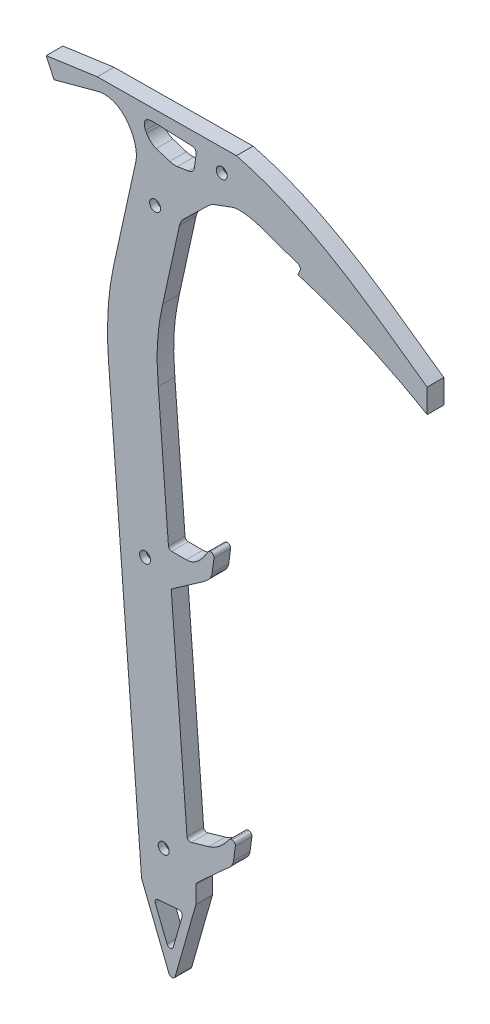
ISO-10303-21;
HEADER;
FILE_DESCRIPTION(('STEP AP214'),'2;1');
FILE_NAME('part.step','',(''),(''),'','','');
FILE_SCHEMA(('AUTOMOTIVE_DESIGN { 1 0 10303 214 1 1 1 1 }'));
ENDSEC;
DATA;
#1=APPLICATION_CONTEXT('core data for automotive mechanical design processes');
#2=APPLICATION_PROTOCOL_DEFINITION('international standard','automotive_design',2000,#1);
#3=PRODUCT_CONTEXT('',#1,'mechanical');
#4=PRODUCT('Part','Part','',(#3));
#5=PRODUCT_RELATED_PRODUCT_CATEGORY('part','',(#4));
#6=PRODUCT_DEFINITION_FORMATION('','',#4);
#7=PRODUCT_DEFINITION_CONTEXT('part definition',#1,'design');
#8=PRODUCT_DEFINITION('design','',#6,#7);
#9=PRODUCT_DEFINITION_SHAPE('','',#8);
#10=(LENGTH_UNIT() NAMED_UNIT(*) SI_UNIT(.MILLI.,.METRE.));
#11=(NAMED_UNIT(*) PLANE_ANGLE_UNIT() SI_UNIT($,.RADIAN.));
#12=(NAMED_UNIT(*) SI_UNIT($,.STERADIAN.) SOLID_ANGLE_UNIT());
#13=UNCERTAINTY_MEASURE_WITH_UNIT(LENGTH_MEASURE(1.E-05),#10,'distance_accuracy_value','');
#14=(GEOMETRIC_REPRESENTATION_CONTEXT(3) GLOBAL_UNCERTAINTY_ASSIGNED_CONTEXT((#13)) GLOBAL_UNIT_ASSIGNED_CONTEXT((#10,
#11,#12)) REPRESENTATION_CONTEXT('',''));
#15=CARTESIAN_POINT('',(0.,0.,0.));
#16=DIRECTION('',(0.,0.,1.));
#17=DIRECTION('',(1.,0.,0.));
#18=AXIS2_PLACEMENT_3D('',#15,#16,#17);
#19=CARTESIAN_POINT('',(-19.0211884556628,12.7458915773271,12.7));
#20=DIRECTION('',(0.,0.,1.));
#21=DIRECTION('',(1.,0.,0.));
#22=AXIS2_PLACEMENT_3D('',#19,#20,#21);
#23=PLANE('',#22);
#24=CARTESIAN_POINT('',(68.0092428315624,147.741681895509,12.7));
#25=DIRECTION('',(0.,0.,-1.));
#26=DIRECTION('',(-1.,0.,0.));
#27=AXIS2_PLACEMENT_3D('',#24,#25,#26);
#28=CIRCLE('',#27,4.21639999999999);
#29=CARTESIAN_POINT('',(63.7928428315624,147.741681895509,12.7));
#30=VERTEX_POINT('',#29);
#31=EDGE_CURVE('E1299',#30,#30,#28,.T.);
#32=ORIENTED_EDGE('',*,*,#31,.T.);
#33=EDGE_LOOP('',(#32));
#34=FACE_BOUND('',#33,.T.);
#35=CARTESIAN_POINT('',(17.0415445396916,100.638187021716,12.7));
#36=DIRECTION('',(0.,0.,-1.));
#37=DIRECTION('',(-1.,0.,0.));
#38=AXIS2_PLACEMENT_3D('',#35,#36,#37);
#39=CIRCLE('',#38,4.2164);
#40=CARTESIAN_POINT('',(12.8251445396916,100.638187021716,12.7));
#41=VERTEX_POINT('',#40);
#42=EDGE_CURVE('E1294',#41,#41,#39,.T.);
#43=ORIENTED_EDGE('',*,*,#42,.T.);
#44=EDGE_LOOP('',(#43));
#45=FACE_BOUND('',#44,.T.);
#46=CARTESIAN_POINT('',(9.38192910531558,-136.197405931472,12.7));
#47=DIRECTION('',(0.,0.,-1.));
#48=DIRECTION('',(-1.,0.,0.));
#49=AXIS2_PLACEMENT_3D('',#46,#47,#48);
#50=CIRCLE('',#49,4.2164);
#51=CARTESIAN_POINT('',(5.16552910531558,-136.197405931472,12.7));
#52=VERTEX_POINT('',#51);
#53=EDGE_CURVE('E1285',#52,#52,#50,.T.);
#54=ORIENTED_EDGE('',*,*,#53,.T.);
#55=EDGE_LOOP('',(#54));
#56=FACE_BOUND('',#55,.T.);
#57=DIRECTION('',(-0.997074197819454,-0.0764398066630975,0.));
#58=VECTOR('',#57,1.);
#59=CARTESIAN_POINT('',(15.9069158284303,-358.224789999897,12.7));
#60=LINE('',#59,#58);
#61=CARTESIAN_POINT('',(35.0607016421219,-356.756382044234,12.7));
#62=VERTEX_POINT('',#61);
#63=CARTESIAN_POINT('',(19.3501523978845,-357.960817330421,12.7));
#64=VERTEX_POINT('',#63);
#65=EDGE_CURVE('E833',#62,#64,#60,.T.);
#66=ORIENTED_EDGE('',*,*,#65,.F.);
#67=CARTESIAN_POINT('',(35.2548587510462,-359.288950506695,12.7));
#68=DIRECTION('',(0.,0.,1.));
#69=DIRECTION('',(1.,0.,0.));
#70=AXIS2_PLACEMENT_3D('',#67,#68,#69);
#71=CIRCLE('',#70,2.54);
#72=CARTESIAN_POINT('',(37.6977964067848,-359.984404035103,12.7));
#73=VERTEX_POINT('',#72);
#74=EDGE_CURVE('E695',#62,#73,#71,.F.);
#75=ORIENTED_EDGE('',*,*,#74,.T.);
#76=DIRECTION('',(0.273800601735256,0.961786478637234,0.));
#77=VECTOR('',#76,1.);
#78=CARTESIAN_POINT('',(28.905993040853,-390.867599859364,12.7));
#79=LINE('',#78,#77);
#80=CARTESIAN_POINT('',(30.9486363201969,-383.69235380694,12.7));
#81=VERTEX_POINT('',#80);
#82=EDGE_CURVE('E838',#81,#73,#79,.T.);
#83=ORIENTED_EDGE('',*,*,#82,.F.);
#84=CARTESIAN_POINT('',(28.5056986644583,-382.996900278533,12.7));
#85=DIRECTION('',(0.,0.,1.));
#86=DIRECTION('',(1.,0.,0.));
#87=AXIS2_PLACEMENT_3D('',#84,#85,#86);
#88=CIRCLE('',#87,2.54);
#89=CARTESIAN_POINT('',(26.1459236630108,-383.936614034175,12.7));
#90=VERTEX_POINT('',#89);
#91=EDGE_CURVE('E718',#81,#90,#88,.F.);
#92=ORIENTED_EDGE('',*,*,#91,.T.);
#93=DIRECTION('',(0.369966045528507,-0.929045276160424,0.));
#94=VECTOR('',#93,1.);
#95=CARTESIAN_POINT('',(15.9069158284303,-358.224789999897,12.7));
#96=LINE('',#95,#94);
#97=CARTESIAN_POINT('',(17.1845345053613,-361.433099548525,12.7));
#98=VERTEX_POINT('',#97);
#99=EDGE_CURVE('E835',#98,#90,#96,.T.);
#100=ORIENTED_EDGE('',*,*,#99,.F.);
#101=CARTESIAN_POINT('',(19.5443095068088,-360.493385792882,12.7));
#102=DIRECTION('',(0.,0.,1.));
#103=DIRECTION('',(1.,0.,0.));
#104=AXIS2_PLACEMENT_3D('',#101,#102,#103);
#105=CIRCLE('',#104,2.54);
#106=EDGE_CURVE('E723',#98,#64,#105,.F.);
#107=ORIENTED_EDGE('',*,*,#106,.T.);
#108=EDGE_LOOP('',(#66,#75,#83,#92,#100,#107));
#109=FACE_BOUND('',#108,.T.);
#110=DIRECTION('',(0.0764398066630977,-0.997074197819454,0.));
#111=VECTOR('',#110,1.);
#112=CARTESIAN_POINT('',(-18.5568059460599,-20.9826739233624,12.7));
#113=LINE('',#112,#111);
#114=CARTESIAN_POINT('',(-18.5568059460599,-20.9826739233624,12.7));
#115=VERTEX_POINT('',#114);
#116=CARTESIAN_POINT('',(6.65403011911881,-349.830629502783,12.7));
#117=VERTEX_POINT('',#116);
#118=EDGE_CURVE('E1031',#115,#117,#113,.T.);
#119=ORIENTED_EDGE('',*,*,#118,.T.);
#120=CARTESIAN_POINT('',(9.18659858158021,-349.636472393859,12.7));
#121=DIRECTION('',(0.,0.,1.));
#122=DIRECTION('',(1.,0.,0.));
#123=AXIS2_PLACEMENT_3D('',#120,#121,#122);
#124=CIRCLE('',#123,2.54);
#125=CARTESIAN_POINT('',(6.82682358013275,-350.576186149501,12.7));
#126=VERTEX_POINT('',#125);
#127=EDGE_CURVE('E689',#117,#126,#124,.T.);
#128=ORIENTED_EDGE('',*,*,#127,.T.);
#129=DIRECTION('',(0.369966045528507,-0.929045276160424,0.));
#130=VECTOR('',#129,1.);
#131=CARTESIAN_POINT('',(30.3446481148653,-409.633291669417,12.7));
#132=LINE('',#131,#130);
#133=CARTESIAN_POINT('',(27.5845787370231,-402.702305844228,12.7));
#134=VERTEX_POINT('',#133);
#135=EDGE_CURVE('E800',#126,#134,#132,.T.);
#136=ORIENTED_EDGE('',*,*,#135,.T.);
#137=CARTESIAN_POINT('',(29.9443537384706,-401.762592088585,12.7));
#138=DIRECTION('',(0.,0.,1.));
#139=DIRECTION('',(1.,0.,0.));
#140=AXIS2_PLACEMENT_3D('',#137,#138,#139);
#141=CIRCLE('',#140,2.54);
#142=CARTESIAN_POINT('',(32.3872913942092,-402.458045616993,12.7));
#143=VERTEX_POINT('',#142);
#144=EDGE_CURVE('E801',#134,#143,#141,.T.);
#145=ORIENTED_EDGE('',*,*,#144,.T.);
#146=DIRECTION('',(0.273800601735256,0.961786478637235,0.));
#147=VECTOR('',#146,1.);
#148=CARTESIAN_POINT('',(48.1646619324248,-347.036466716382,12.7));
#149=LINE('',#148,#147);
#150=CARTESIAN_POINT('',(48.0675995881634,-347.377420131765,12.7));
#151=VERTEX_POINT('',#150);
#152=EDGE_CURVE('E803',#143,#151,#149,.T.);
#153=ORIENTED_EDGE('',*,*,#152,.T.);
#154=CARTESIAN_POINT('',(45.6246619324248,-346.681966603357,12.7));
#155=DIRECTION('',(0.,0.,1.));
#156=DIRECTION('',(1.,0.,0.));
#157=AXIS2_PLACEMENT_3D('',#154,#155,#156);
#158=CIRCLE('',#157,2.54);
#159=CARTESIAN_POINT('',(48.1646619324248,-346.681966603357,12.7));
#160=VERTEX_POINT('',#159);
#161=EDGE_CURVE('E804',#151,#160,#158,.T.);
#162=ORIENTED_EDGE('',*,*,#161,.T.);
#163=DIRECTION('',(0.,1.,0.));
#164=VECTOR('',#163,1.);
#165=CARTESIAN_POINT('',(48.1646619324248,-332.698935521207,12.7));
#166=LINE('',#165,#164);
#167=CARTESIAN_POINT('',(48.1646619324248,-333.81690500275,12.7));
#168=VERTEX_POINT('',#167);
#169=EDGE_CURVE('E712',#160,#168,#166,.T.);
#170=ORIENTED_EDGE('',*,*,#169,.T.);
#171=CARTESIAN_POINT('',(50.7046619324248,-333.81690500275,12.7));
#172=DIRECTION('',(0.,0.,1.));
#173=DIRECTION('',(1.,0.,0.));
#174=AXIS2_PLACEMENT_3D('',#171,#172,#173);
#175=CIRCLE('',#174,2.54);
#176=CARTESIAN_POINT('',(48.9890862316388,-331.943832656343,12.7));
#177=VERTEX_POINT('',#176);
#178=EDGE_CURVE('E709',#168,#177,#175,.F.);
#179=ORIENTED_EDGE('',*,*,#178,.T.);
#180=DIRECTION('',(0.737430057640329,0.675423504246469,0.));
#181=VECTOR('',#180,1.);
#182=CARTESIAN_POINT('',(48.1646619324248,-332.698935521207,12.7));
#183=LINE('',#182,#181);
#184=CARTESIAN_POINT('',(69.0746525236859,-313.547154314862,12.7));
#185=VERTEX_POINT('',#184);
#186=EDGE_CURVE('E711',#177,#185,#183,.T.);
#187=ORIENTED_EDGE('',*,*,#186,.T.);
#188=CARTESIAN_POINT('',(69.0746525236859,-313.547154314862,12.7));
#189=CARTESIAN_POINT('',(72.1842997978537,-310.698980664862,12.7));
#190=CARTESIAN_POINT('',(76.3504602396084,-308.232220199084,12.7));
#191=CARTESIAN_POINT('',(76.9663603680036,-303.659842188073,12.7));
#192=B_SPLINE_CURVE_WITH_KNOTS('',3,(#188,#189,#190,#191),.UNSPECIFIED.,.F.,.F.,(4,4),(0.,1.),.UNSPECIFIED.);
#193=CARTESIAN_POINT('',(76.9663603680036,-303.659842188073,12.7));
#194=VERTEX_POINT('',#193);
#195=EDGE_CURVE('E1475',#185,#194,#192,.T.);
#196=ORIENTED_EDGE('',*,*,#195,.T.);
#197=DIRECTION('',(0.133494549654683,0.99104954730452,0.));
#198=VECTOR('',#197,1.);
#199=CARTESIAN_POINT('',(78.7824480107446,-290.177397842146,12.7));
#200=LINE('',#199,#198);
#201=CARTESIAN_POINT('',(78.394635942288,-293.056473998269,12.7));
#202=VERTEX_POINT('',#201);
#203=EDGE_CURVE('E812',#194,#202,#200,.T.);
#204=ORIENTED_EDGE('',*,*,#203,.T.);
#205=CARTESIAN_POINT('',(75.8773700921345,-292.717397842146,12.7));
#206=DIRECTION('',(0.,0.,1.));
#207=DIRECTION('',(1.,0.,0.));
#208=AXIS2_PLACEMENT_3D('',#205,#206,#207);
#209=CIRCLE('',#208,2.54);
#210=CARTESIAN_POINT('',(75.8773700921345,-290.177397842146,12.7));
#211=VERTEX_POINT('',#210);
#212=EDGE_CURVE('E810',#202,#211,#209,.T.);
#213=ORIENTED_EDGE('',*,*,#212,.T.);
#214=DIRECTION('',(-1.,0.,0.));
#215=VECTOR('',#214,1.);
#216=CARTESIAN_POINT('',(78.7824480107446,-290.177397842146,12.7));
#217=LINE('',#216,#215);
#218=CARTESIAN_POINT('',(75.6592750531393,-290.177397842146,12.7));
#219=VERTEX_POINT('',#218);
#220=EDGE_CURVE('E809',#211,#219,#217,.T.);
#221=ORIENTED_EDGE('',*,*,#220,.T.);
#222=CARTESIAN_POINT('',(75.6592750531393,-292.717397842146,12.7));
#223=DIRECTION('',(0.,0.,1.));
#224=DIRECTION('',(1.,0.,0.));
#225=AXIS2_PLACEMENT_3D('',#222,#223,#224);
#226=CIRCLE('',#225,2.54);
#227=CARTESIAN_POINT('',(73.5943919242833,-291.238256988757,12.7));
#228=VERTEX_POINT('',#227);
#229=EDGE_CURVE('E806',#219,#228,#226,.T.);
#230=ORIENTED_EDGE('',*,*,#229,.T.);
#231=CARTESIAN_POINT('',(74.3357910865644,-290.177397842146,12.7));
#232=CARTESIAN_POINT('',(66.9349578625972,-301.027986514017,12.7));
#233=CARTESIAN_POINT('',(58.0168664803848,-303.581901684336,12.7));
#234=B_SPLINE_CURVE_WITH_KNOTS('',2,(#231,#232,#233),.UNSPECIFIED.,.F.,.F.,(3,3),(0.,1.),.UNSPECIFIED.);
#235=CARTESIAN_POINT('',(58.0168664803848,-303.581901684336,12.7));
#236=VERTEX_POINT('',#235);
#237=EDGE_CURVE('E808',#228,#236,#234,.T.);
#238=ORIENTED_EDGE('',*,*,#237,.T.);
#239=DIRECTION('',(-0.96135607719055,-0.275307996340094,0.));
#240=VECTOR('',#239,1.);
#241=CARTESIAN_POINT('',(41.6789069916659,-308.260678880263,12.7));
#242=LINE('',#241,#240);
#243=CARTESIAN_POINT('',(44.6727128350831,-307.403328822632,12.7));
#244=VERTEX_POINT('',#243);
#245=EDGE_CURVE('E704',#236,#244,#242,.T.);
#246=ORIENTED_EDGE('',*,*,#245,.T.);
#247=CARTESIAN_POINT('',(43.9734305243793,-304.961484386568,12.7));
#248=DIRECTION('',(0.,0.,1.));
#249=DIRECTION('',(1.,0.,0.));
#250=AXIS2_PLACEMENT_3D('',#247,#248,#249);
#251=CIRCLE('',#250,2.54);
#252=CARTESIAN_POINT('',(41.4408620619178,-305.155641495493,12.7));
#253=VERTEX_POINT('',#252);
#254=EDGE_CURVE('E701',#244,#253,#251,.F.);
#255=ORIENTED_EDGE('',*,*,#254,.T.);
#256=DIRECTION('',(-0.0764398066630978,0.997074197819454,0.));
#257=VECTOR('',#256,1.);
#258=CARTESIAN_POINT('',(29.3333298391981,-147.226042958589,12.7));
#259=LINE('',#258,#257);
#260=CARTESIAN_POINT('',(29.3333298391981,-147.226042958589,12.7));
#261=VERTEX_POINT('',#260);
#262=EDGE_CURVE('E703',#253,#261,#259,.T.);
#263=ORIENTED_EDGE('',*,*,#262,.T.);
#264=DIRECTION('',(0.82040362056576,0.571784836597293,0.));
#265=VECTOR('',#264,1.);
#266=CARTESIAN_POINT('',(29.3333298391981,-147.226042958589,12.7));
#267=LINE('',#266,#265);
#268=CARTESIAN_POINT('',(52.7557279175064,-130.901673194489,12.7));
#269=VERTEX_POINT('',#268);
#270=EDGE_CURVE('E2332',#261,#269,#267,.T.);
#271=ORIENTED_EDGE('',*,*,#270,.T.);
#272=CARTESIAN_POINT('',(52.7557279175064,-130.901673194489,12.7));
#273=CARTESIAN_POINT('',(56.2152639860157,-128.490530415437,12.7));
#274=CARTESIAN_POINT('',(60.0315356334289,-125.586739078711,12.7));
#275=CARTESIAN_POINT('',(60.6474357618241,-121.0143610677,12.7));
#276=B_SPLINE_CURVE_WITH_KNOTS('',3,(#272,#273,#274,#275),.UNSPECIFIED.,.F.,.F.,(4,4),(0.,1.),.UNSPECIFIED.);
#277=CARTESIAN_POINT('',(60.6474357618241,-121.0143610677,12.7));
#278=VERTEX_POINT('',#277);
#279=EDGE_CURVE('E2327',#269,#278,#276,.T.);
#280=ORIENTED_EDGE('',*,*,#279,.T.);
#281=DIRECTION('',(0.133494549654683,0.99104954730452,0.));
#282=VECTOR('',#281,1.);
#283=CARTESIAN_POINT('',(62.4635234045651,-107.531916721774,12.7));
#284=LINE('',#283,#282);
#285=CARTESIAN_POINT('',(62.0757113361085,-110.410992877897,12.7));
#286=VERTEX_POINT('',#285);
#287=EDGE_CURVE('E819',#278,#286,#284,.T.);
#288=ORIENTED_EDGE('',*,*,#287,.T.);
#289=CARTESIAN_POINT('',(59.558445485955,-110.071916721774,12.7));
#290=DIRECTION('',(0.,0.,1.));
#291=DIRECTION('',(1.,0.,0.));
#292=AXIS2_PLACEMENT_3D('',#289,#290,#291);
#293=CIRCLE('',#292,2.54);
#294=CARTESIAN_POINT('',(59.558445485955,-107.531916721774,12.7));
#295=VERTEX_POINT('',#294);
#296=EDGE_CURVE('E817',#286,#295,#293,.T.);
#297=ORIENTED_EDGE('',*,*,#296,.T.);
#298=DIRECTION('',(-1.,0.,0.));
#299=VECTOR('',#298,1.);
#300=CARTESIAN_POINT('',(62.4635234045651,-107.531916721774,12.7));
#301=LINE('',#300,#299);
#302=CARTESIAN_POINT('',(59.5153247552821,-107.531916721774,12.7));
#303=VERTEX_POINT('',#302);
#304=EDGE_CURVE('E816',#295,#303,#301,.T.);
#305=ORIENTED_EDGE('',*,*,#304,.T.);
#306=CARTESIAN_POINT('',(59.5153247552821,-110.071916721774,12.7));
#307=DIRECTION('',(0.,0.,1.));
#308=DIRECTION('',(1.,0.,0.));
#309=AXIS2_PLACEMENT_3D('',#306,#307,#308);
#310=CIRCLE('',#309,2.54);
#311=CARTESIAN_POINT('',(57.3066049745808,-108.817661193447,12.7));
#312=VERTEX_POINT('',#311);
#313=EDGE_CURVE('E813',#303,#312,#310,.T.);
#314=ORIENTED_EDGE('',*,*,#313,.T.);
#315=CARTESIAN_POINT('',(58.0168664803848,-107.531916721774,12.7));
#316=CARTESIAN_POINT('',(50.1965242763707,-122.077096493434,12.7));
#317=CARTESIAN_POINT('',(40.9199496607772,-122.077096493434,12.7));
#318=B_SPLINE_CURVE_WITH_KNOTS('',2,(#315,#316,#317),.UNSPECIFIED.,.F.,.F.,(3,3),(0.,1.),.UNSPECIFIED.);
#319=CARTESIAN_POINT('',(40.9199496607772,-122.077096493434,12.7));
#320=VERTEX_POINT('',#319);
#321=EDGE_CURVE('E815',#312,#320,#318,.T.);
#322=ORIENTED_EDGE('',*,*,#321,.T.);
#323=DIRECTION('',(-1.,0.,0.));
#324=VECTOR('',#323,1.);
#325=CARTESIAN_POINT('',(27.4053082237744,-122.077096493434,12.7));
#326=LINE('',#325,#324);
#327=CARTESIAN_POINT('',(29.7580347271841,-122.077096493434,12.7));
#328=VERTEX_POINT('',#327);
#329=EDGE_CURVE('E696',#320,#328,#326,.T.);
#330=ORIENTED_EDGE('',*,*,#329,.T.);
#331=CARTESIAN_POINT('',(29.7580347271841,-119.537096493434,12.7));
#332=DIRECTION('',(0.,0.,1.));
#333=DIRECTION('',(1.,0.,0.));
#334=AXIS2_PLACEMENT_3D('',#331,#332,#333);
#335=CIRCLE('',#334,2.54);
#336=CARTESIAN_POINT('',(27.2254662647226,-119.731253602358,12.7));
#337=VERTEX_POINT('',#336);
#338=EDGE_CURVE('E692',#328,#337,#335,.F.);
#339=ORIENTED_EDGE('',*,*,#338,.T.);
#340=DIRECTION('',(-0.0764398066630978,0.997074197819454,0.));
#341=VECTOR('',#340,1.);
#342=CARTESIAN_POINT('',(33.2300214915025,-198.054150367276,12.7));
#343=LINE('',#342,#341);
#344=CARTESIAN_POINT('',(19.4317209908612,-18.0703172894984,12.7));
#345=VERTEX_POINT('',#344);
#346=EDGE_CURVE('E2170',#337,#345,#343,.T.);
#347=ORIENTED_EDGE('',*,*,#346,.T.);
#348=CARTESIAN_POINT('',(19.4317209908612,-18.0703172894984,12.7));
#349=CARTESIAN_POINT('',(17.9934732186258,0.690061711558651,12.7));
#350=CARTESIAN_POINT('',(17.7895180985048,15.1787780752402,12.7));
#351=CARTESIAN_POINT('',(22.8576667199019,38.2719074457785,12.7));
#352=B_SPLINE_CURVE_WITH_KNOTS('',3,(#348,#349,#350,#351),.UNSPECIFIED.,.F.,.F.,(4,4),(0.,1.),.UNSPECIFIED.);
#353=CARTESIAN_POINT('',(22.8576667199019,38.2719074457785,12.7));
#354=VERTEX_POINT('',#353);
#355=EDGE_CURVE('E2164',#345,#354,#352,.T.);
#356=ORIENTED_EDGE('',*,*,#355,.T.);
#357=DIRECTION('',(0.214363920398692,0.976753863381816,0.));
#358=VECTOR('',#357,1.);
#359=CARTESIAN_POINT('',(39.1921974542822,112.700551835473,12.7));
#360=LINE('',#359,#358);
#361=CARTESIAN_POINT('',(35.6487056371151,96.5545543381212,12.7));
#362=VERTEX_POINT('',#361);
#363=EDGE_CURVE('E2169',#354,#362,#360,.T.);
#364=ORIENTED_EDGE('',*,*,#363,.T.);
#365=CARTESIAN_POINT('',(48.0534797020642,93.8321325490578,12.7));
#366=DIRECTION('',(0.,0.,1.));
#367=DIRECTION('',(1.,0.,0.));
#368=AXIS2_PLACEMENT_3D('',#365,#366,#367);
#369=CIRCLE('',#368,12.7);
#370=CARTESIAN_POINT('',(39.2224504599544,102.959176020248,12.7));
#371=VERTEX_POINT('',#370);
#372=EDGE_CURVE('E11',#362,#371,#369,.F.);
#373=ORIENTED_EDGE('',*,*,#372,.T.);
#374=DIRECTION('',(-0.718664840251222,-0.695356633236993,0.));
#375=VECTOR('',#374,1.);
#376=CARTESIAN_POINT('',(59.9636796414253,123.027712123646,12.7));
#377=LINE('',#376,#375);
#378=CARTESIAN_POINT('',(58.0460163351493,121.172243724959,12.7));
#379=VERTEX_POINT('',#378);
#380=EDGE_CURVE('E682',#379,#371,#377,.T.);
#381=ORIENTED_EDGE('',*,*,#380,.F.);
#382=CARTESIAN_POINT('',(66.8770455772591,112.045200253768,12.7));
#383=DIRECTION('',(0.,0.,1.));
#384=DIRECTION('',(1.,0.,0.));
#385=AXIS2_PLACEMENT_3D('',#382,#383,#384);
#386=CIRCLE('',#385,12.7);
#387=CARTESIAN_POINT('',(62.4659217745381,123.954523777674,12.7));
#388=VERTEX_POINT('',#387);
#389=EDGE_CURVE('E1279',#379,#388,#386,.F.);
#390=ORIENTED_EDGE('',*,*,#389,.T.);
#391=DIRECTION('',(0.937742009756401,0.34733258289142,0.));
#392=VECTOR('',#391,1.);
#393=CARTESIAN_POINT('',(44.0168838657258,117.121138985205,12.7));
#394=LINE('',#393,#392);
#395=CARTESIAN_POINT('',(75.9104754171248,128.934285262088,12.7));
#396=VERTEX_POINT('',#395);
#397=EDGE_CURVE('E2176',#388,#396,#394,.T.);
#398=ORIENTED_EDGE('',*,*,#397,.T.);
#399=CARTESIAN_POINT('',(75.9104754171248,128.934285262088,12.7));
#400=CARTESIAN_POINT('',(80.0933409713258,130.483587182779,12.7));
#401=CARTESIAN_POINT('',(89.5482728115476,129.605354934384,12.7));
#402=CARTESIAN_POINT('',(95.8311565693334,127.39608281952,12.7));
#403=B_SPLINE_CURVE_WITH_KNOTS('',3,(#399,#400,#401,#402),.UNSPECIFIED.,.F.,.F.,(4,4),(0.,1.),.UNSPECIFIED.);
#404=CARTESIAN_POINT('',(95.8311565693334,127.39608281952,12.7));
#405=VERTEX_POINT('',#404);
#406=EDGE_CURVE('E2177',#396,#405,#403,.T.);
#407=ORIENTED_EDGE('',*,*,#406,.T.);
#408=DIRECTION('',(0.943376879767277,-0.331722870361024,0.));
#409=VECTOR('',#408,1.);
#410=CARTESIAN_POINT('',(129.004887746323,115.731089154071,12.7));
#411=LINE('',#410,#409);
#412=CARTESIAN_POINT('',(126.42212205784,116.639275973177,12.7));
#413=VERTEX_POINT('',#412);
#414=EDGE_CURVE('E2182',#405,#413,#411,.T.);
#415=ORIENTED_EDGE('',*,*,#414,.T.);
#416=CARTESIAN_POINT('',(125.579545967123,114.243098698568,12.7));
#417=DIRECTION('',(0.,0.,1.));
#418=DIRECTION('',(1.,0.,0.));
#419=AXIS2_PLACEMENT_3D('',#416,#417,#418);
#420=CIRCLE('',#419,2.54);
#421=CARTESIAN_POINT('',(127.905938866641,113.223541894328,12.7));
#422=VERTEX_POINT('',#421);
#423=EDGE_CURVE('E1247',#413,#422,#420,.F.);
#424=ORIENTED_EDGE('',*,*,#423,.T.);
#425=DIRECTION('',(-0.40140031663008,-0.915902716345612,0.));
#426=VECTOR('',#425,1.);
#427=CARTESIAN_POINT('',(126.268204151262,109.4866099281,12.7));
#428=LINE('',#427,#426);
#429=CARTESIAN_POINT('',(126.268204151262,109.4866099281,12.7));
#430=VERTEX_POINT('',#429);
#431=EDGE_CURVE('E2188',#422,#430,#428,.T.);
#432=ORIENTED_EDGE('',*,*,#431,.T.);
#433=CARTESIAN_POINT('',(126.268204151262,109.4866099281,12.7));
#434=CARTESIAN_POINT('',(177.502207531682,94.1506746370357,12.7));
#435=CARTESIAN_POINT('',(225.139902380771,66.1554457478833,12.7));
#436=B_SPLINE_CURVE_WITH_KNOTS('',2,(#433,#434,#435),.UNSPECIFIED.,.F.,.F.,(3,3),(0.,1.),.UNSPECIFIED.);
#437=CARTESIAN_POINT('',(225.139902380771,66.1554457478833,12.7));
#438=VERTEX_POINT('',#437);
#439=EDGE_CURVE('E2190',#430,#438,#436,.T.);
#440=ORIENTED_EDGE('',*,*,#439,.T.);
#441=DIRECTION('',(0.,1.,0.));
#442=VECTOR('',#441,1.);
#443=CARTESIAN_POINT('',(225.139902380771,66.1554457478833,12.7));
#444=LINE('',#443,#442);
#445=CARTESIAN_POINT('',(225.139902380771,84.4452484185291,12.7));
#446=VERTEX_POINT('',#445);
#447=EDGE_CURVE('E2195',#438,#446,#444,.T.);
#448=ORIENTED_EDGE('',*,*,#447,.T.);
#449=CARTESIAN_POINT('',(225.139902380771,84.4452484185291,12.7));
#450=CARTESIAN_POINT('',(177.560633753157,118.105838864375,12.7));
#451=CARTESIAN_POINT('',(136.003162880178,149.987562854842,12.7));
#452=CARTESIAN_POINT('',(79.2400667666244,164.771545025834,12.7));
#453=B_SPLINE_CURVE_WITH_KNOTS('',3,(#449,#450,#451,#452),.UNSPECIFIED.,.F.,.F.,(4,4),(0.,1.),.UNSPECIFIED.);
#454=CARTESIAN_POINT('',(79.2400667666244,164.771545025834,12.7));
#455=VERTEX_POINT('',#454);
#456=EDGE_CURVE('E2200',#446,#455,#453,.T.);
#457=ORIENTED_EDGE('',*,*,#456,.T.);
#458=DIRECTION('',(-0.999958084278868,-0.00915585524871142,0.));
#459=VECTOR('',#458,1.);
#460=CARTESIAN_POINT('',(-27.1753907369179,163.797179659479,12.7));
#461=LINE('',#460,#459);
#462=CARTESIAN_POINT('',(-27.0097832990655,163.798696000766,12.7));
#463=VERTEX_POINT('',#462);
#464=EDGE_CURVE('E2205',#455,#463,#461,.T.);
#465=ORIENTED_EDGE('',*,*,#464,.T.);
#466=CARTESIAN_POINT('',(-26.9865274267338,161.258802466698,12.7));
#467=DIRECTION('',(0.,0.,1.));
#468=DIRECTION('',(1.,0.,0.));
#469=AXIS2_PLACEMENT_3D('',#466,#467,#468);
#470=CIRCLE('',#469,2.54);
#471=CARTESIAN_POINT('',(-27.339399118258,163.774171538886,12.7));
#472=VERTEX_POINT('',#471);
#473=EDGE_CURVE('E1243',#463,#472,#470,.T.);
#474=ORIENTED_EDGE('',*,*,#473,.T.);
#475=DIRECTION('',(-0.990302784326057,-0.138925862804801,0.));
#476=VECTOR('',#475,1.);
#477=CARTESIAN_POINT('',(-66.26296818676,158.313730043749,12.7));
#478=LINE('',#477,#476);
#479=CARTESIAN_POINT('',(-66.26296818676,158.313730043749,12.7));
#480=VERTEX_POINT('',#479);
#481=EDGE_CURVE('E2211',#472,#480,#478,.T.);
#482=ORIENTED_EDGE('',*,*,#481,.T.);
#483=DIRECTION('',(0.416827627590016,-0.908985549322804,0.));
#484=VECTOR('',#483,1.);
#485=CARTESIAN_POINT('',(-66.26296818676,158.313730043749,12.7));
#486=LINE('',#485,#484);
#487=CARTESIAN_POINT('',(-60.2950505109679,145.299355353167,12.7));
#488=VERTEX_POINT('',#487);
#489=EDGE_CURVE('E2212',#480,#488,#486,.T.);
#490=ORIENTED_EDGE('',*,*,#489,.T.);
#491=DIRECTION('',(0.96561138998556,0.259989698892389,0.));
#492=VECTOR('',#491,1.);
#493=CARTESIAN_POINT('',(-27.1753907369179,154.21678369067,12.7));
#494=LINE('',#493,#492);
#495=CARTESIAN_POINT('',(-27.1753907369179,154.21678369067,12.7));
#496=VERTEX_POINT('',#495);
#497=EDGE_CURVE('E1115',#488,#496,#494,.T.);
#498=ORIENTED_EDGE('',*,*,#497,.T.);
#499=CARTESIAN_POINT('',(-27.1753907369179,154.21678369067,12.7));
#500=CARTESIAN_POINT('',(-21.3119540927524,155.795506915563,12.7));
#501=CARTESIAN_POINT('',(-9.16205195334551,153.443457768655,12.7));
#502=CARTESIAN_POINT('',(1.53650161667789,138.586858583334,12.7));
#503=CARTESIAN_POINT('',(3.29563203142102,126.872204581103,12.7));
#504=CARTESIAN_POINT('',(2.22884875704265,122.011383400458,12.7));
#505=B_SPLINE_CURVE_WITH_KNOTS('',3,(#499,#500,#501,#502,#503,#504),.UNSPECIFIED.,.F.,.F.,(4,1,
1,4),(0.,0.318927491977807,0.707775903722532,1.),.UNSPECIFIED.);
#506=CARTESIAN_POINT('',(2.22884875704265,122.011383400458,12.7));
#507=VERTEX_POINT('',#506);
#508=EDGE_CURVE('E1108',#496,#507,#505,.T.);
#509=ORIENTED_EDGE('',*,*,#508,.T.);
#510=DIRECTION('',(-0.214363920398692,-0.976753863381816,0.));
#511=VECTOR('',#510,1.);
#512=CARTESIAN_POINT('',(2.22884875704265,122.011383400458,12.7));
#513=LINE('',#512,#511);
#514=CARTESIAN_POINT('',(-14.7862874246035,44.4815454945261,12.7));
#515=VERTEX_POINT('',#514);
#516=EDGE_CURVE('E1114',#507,#515,#513,.T.);
#517=ORIENTED_EDGE('',*,*,#516,.T.);
#518=CARTESIAN_POINT('',(-14.7862874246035,44.4815454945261,12.7));
#519=CARTESIAN_POINT('',(-19.2789138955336,24.0107953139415,12.7));
#520=CARTESIAN_POINT('',(-20.3298908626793,2.14529170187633,12.7));
#521=CARTESIAN_POINT('',(-18.5568059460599,-20.9826739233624,12.7));
#522=B_SPLINE_CURVE_WITH_KNOTS('',3,(#518,#519,#520,#521),.UNSPECIFIED.,.F.,.F.,(4,4),(0.,1.),.UNSPECIFIED.);
#523=EDGE_CURVE('E1025',#515,#115,#522,.T.);
#524=ORIENTED_EDGE('',*,*,#523,.T.);
#525=EDGE_LOOP('',(#119,#128,#136,#145,#153,#162,#170,#179,#187,#196,#204,#213,#221,#230,#238,
#246,#255,#263,#271,#280,#288,#297,#305,#314,#322,#330,#339,#347,#356,#364,#373,#381,#390,#398,
#407,#415,#424,#432,#440,#448,#457,#465,#474,#482,#490,#498,#509,#517,#524));
#526=FACE_BOUND('',#525,.T.);
#527=DIRECTION('',(0.988553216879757,0.150872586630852,0.));
#528=VECTOR('',#527,1.);
#529=CARTESIAN_POINT('',(19.8428287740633,132.794940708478,12.7));
#530=LINE('',#529,#528);
#531=CARTESIAN_POINT('',(34.1086610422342,134.97218617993,12.7));
#532=VERTEX_POINT('',#531);
#533=CARTESIAN_POINT('',(42.3709320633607,136.233170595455,12.7));
#534=VERTEX_POINT('',#533);
#535=EDGE_CURVE('E1513',#532,#534,#530,.T.);
#536=ORIENTED_EDGE('',*,*,#535,.F.);
#537=CARTESIAN_POINT('',(32.1925791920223,147.526812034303,12.7));
#538=DIRECTION('',(0.,0.,1.));
#539=DIRECTION('',(1.,0.,0.));
#540=AXIS2_PLACEMENT_3D('',#537,#538,#539);
#541=CIRCLE('',#540,12.7);
#542=CARTESIAN_POINT('',(28.2225208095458,135.463286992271,12.7));
#543=VERTEX_POINT('',#542);
#544=EDGE_CURVE('E1275',#532,#543,#541,.F.);
#545=ORIENTED_EDGE('',*,*,#544,.T.);
#546=DIRECTION('',(0.949883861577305,-0.312603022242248,0.));
#547=VECTOR('',#546,1.);
#548=CARTESIAN_POINT('',(31.106880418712,134.514055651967,12.7));
#549=LINE('',#548,#547);
#550=CARTESIAN_POINT('',(17.9418111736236,138.84662787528,12.7));
#551=VERTEX_POINT('',#550);
#552=EDGE_CURVE('E685',#551,#543,#549,.T.);
#553=ORIENTED_EDGE('',*,*,#552,.F.);
#554=CARTESIAN_POINT('',(21.9118695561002,150.910152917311,12.7));
#555=DIRECTION('',(0.,0.,1.));
#556=DIRECTION('',(1.,0.,0.));
#557=AXIS2_PLACEMENT_3D('',#554,#555,#556);
#558=CIRCLE('',#557,12.7);
#559=CARTESIAN_POINT('',(10.5709948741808,145.193986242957,12.7));
#560=VERTEX_POINT('',#559);
#561=EDGE_CURVE('E1271',#551,#560,#558,.F.);
#562=ORIENTED_EDGE('',*,*,#561,.T.);
#563=DIRECTION('',(0.450091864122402,-0.892982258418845,0.));
#564=VECTOR('',#563,1.);
#565=CARTESIAN_POINT('',(9.73340656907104,146.855761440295,12.7));
#566=LINE('',#565,#564);
#567=CARTESIAN_POINT('',(9.73340656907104,146.855761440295,12.7));
#568=VERTEX_POINT('',#567);
#569=EDGE_CURVE('E1507',#568,#560,#566,.T.);
#570=ORIENTED_EDGE('',*,*,#569,.F.);
#571=CARTESIAN_POINT('',(15.7887965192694,155.37436086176,12.7));
#572=CARTESIAN_POINT('',(7.67842661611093,155.695324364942,12.7));
#573=CARTESIAN_POINT('',(8.16535843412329,149.966768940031,12.7));
#574=CARTESIAN_POINT('',(9.73340656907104,146.855761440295,12.7));
#575=B_SPLINE_CURVE_WITH_KNOTS('',3,(#571,#572,#573,#574),.UNSPECIFIED.,.F.,.F.,(4,4),(0.,1.),.UNSPECIFIED.);
#576=CARTESIAN_POINT('',(15.7887965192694,155.37436086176,12.7));
#577=VERTEX_POINT('',#576);
#578=EDGE_CURVE('E1009',#577,#568,#575,.T.);
#579=ORIENTED_EDGE('',*,*,#578,.F.);
#580=DIRECTION('',(-0.999217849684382,0.0395435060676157,0.));
#581=VECTOR('',#580,1.);
#582=CARTESIAN_POINT('',(15.7887965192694,155.37436086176,12.7));
#583=LINE('',#582,#581);
#584=CARTESIAN_POINT('',(45.0394089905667,154.21678369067,12.7));
#585=VERTEX_POINT('',#584);
#586=EDGE_CURVE('E967',#585,#577,#583,.T.);
#587=ORIENTED_EDGE('',*,*,#586,.F.);
#588=CARTESIAN_POINT('',(48.426322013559,150.499258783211,12.7));
#589=CARTESIAN_POINT('',(48.6578242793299,152.171219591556,12.7));
#590=CARTESIAN_POINT('',(47.6866953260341,154.112018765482,12.7));
#591=CARTESIAN_POINT('',(45.0394089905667,154.21678369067,12.7));
#592=B_SPLINE_CURVE_WITH_KNOTS('',3,(#588,#589,#590,#591),.UNSPECIFIED.,.F.,.F.,(4,4),(0.,1.),.UNSPECIFIED.);
#593=CARTESIAN_POINT('',(48.426322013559,150.499258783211,12.7));
#594=VERTEX_POINT('',#593);
#595=EDGE_CURVE('E960',#594,#585,#592,.T.);
#596=ORIENTED_EDGE('',*,*,#595,.F.);
#597=DIRECTION('',(0.13715305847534,0.990549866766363,0.));
#598=VECTOR('',#597,1.);
#599=CARTESIAN_POINT('',(48.426322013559,150.499258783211,12.7));
#600=LINE('',#599,#598);
#601=CARTESIAN_POINT('',(47.0407666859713,140.492470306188,12.7));
#602=VERTEX_POINT('',#601);
#603=EDGE_CURVE('E968',#602,#594,#600,.T.);
#604=ORIENTED_EDGE('',*,*,#603,.F.);
#605=CARTESIAN_POINT('',(42.3709320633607,136.233170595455,12.7));
#606=CARTESIAN_POINT('',(45.2602948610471,136.674143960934,12.7));
#607=CARTESIAN_POINT('',(46.7518070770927,138.40553979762,12.7));
#608=CARTESIAN_POINT('',(47.0407666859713,140.492470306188,12.7));
#609=B_SPLINE_CURVE_WITH_KNOTS('',3,(#605,#606,#607,#608),.UNSPECIFIED.,.F.,.F.,(4,4),(0.,1.),.UNSPECIFIED.);
#610=EDGE_CURVE('E1514',#534,#602,#609,.T.);
#611=ORIENTED_EDGE('',*,*,#610,.F.);
#612=EDGE_LOOP('',(#536,#545,#553,#562,#570,#579,#587,#596,#604,#611));
#613=FACE_BOUND('',#612,.T.);
#614=CARTESIAN_POINT('',(23.6115412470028,-321.807230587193,12.7));
#615=DIRECTION('',(0.,0.,-1.));
#616=DIRECTION('',(-1.,0.,0.));
#617=AXIS2_PLACEMENT_3D('',#614,#615,#616);
#618=CIRCLE('',#617,4.2164);
#619=CARTESIAN_POINT('',(19.3951412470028,-321.807230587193,12.7));
#620=VERTEX_POINT('',#619);
#621=EDGE_CURVE('E571',#620,#620,#618,.T.);
#622=ORIENTED_EDGE('',*,*,#621,.T.);
#623=EDGE_LOOP('',(#622));
#624=FACE_BOUND('',#623,.T.);
#625=ADVANCED_FACE('F37',(#34,#45,#56,#109,#526,#613,#624),#23,.T.);
#626=CARTESIAN_POINT('',(39.1921974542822,112.700551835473,12.7));
#627=DIRECTION('',(-0.976753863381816,0.214363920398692,0.));
#628=DIRECTION('',(-0.214363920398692,-0.976753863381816,0.));
#629=AXIS2_PLACEMENT_3D('',#626,#627,#628);
#630=PLANE('',#629);
#631=DIRECTION('',(0.214363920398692,0.976753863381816,0.));
#632=VECTOR('',#631,1.);
#633=CARTESIAN_POINT('',(39.1921974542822,112.700551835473,0.));
#634=LINE('',#633,#632);
#635=CARTESIAN_POINT('',(22.8576667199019,38.2719074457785,0.));
#636=VERTEX_POINT('',#635);
#637=CARTESIAN_POINT('',(35.6487056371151,96.5545543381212,0.));
#638=VERTEX_POINT('',#637);
#639=EDGE_CURVE('E1137',#636,#638,#634,.T.);
#640=ORIENTED_EDGE('',*,*,#639,.T.);
#641=DIRECTION('',(0.,0.,-1.));
#642=VECTOR('',#641,1.);
#643=CARTESIAN_POINT('',(35.6487056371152,96.5545543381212,12.7));
#644=LINE('',#643,#642);
#645=EDGE_CURVE('E1267',#638,#362,#644,.F.);
#646=ORIENTED_EDGE('',*,*,#645,.T.);
#647=ORIENTED_EDGE('',*,*,#363,.F.);
#648=DIRECTION('',(0.,0.,-1.));
#649=VECTOR('',#648,1.);
#650=CARTESIAN_POINT('',(22.8576667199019,38.2719074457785,12.7));
#651=LINE('',#650,#649);
#652=EDGE_CURVE('E1222',#354,#636,#651,.T.);
#653=ORIENTED_EDGE('',*,*,#652,.T.);
#654=EDGE_LOOP('',(#640,#646,#647,#653));
#655=FACE_BOUND('',#654,.T.);
#656=ADVANCED_FACE('F1077',(#655),#630,.F.);
#657=CARTESIAN_POINT('',(44.0168838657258,117.121138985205,12.7));
#658=DIRECTION('',(-0.34733258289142,0.937742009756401,0.));
#659=DIRECTION('',(-0.937742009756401,-0.34733258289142,0.));
#660=AXIS2_PLACEMENT_3D('',#657,#658,#659);
#661=PLANE('',#660);
#662=ORIENTED_EDGE('',*,*,#397,.F.);
#663=DIRECTION('',(0.,0.,-1.));
#664=VECTOR('',#663,1.);
#665=CARTESIAN_POINT('',(62.4659217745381,123.954523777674,12.7));
#666=LINE('',#665,#664);
#667=CARTESIAN_POINT('',(62.4659217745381,123.954523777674,0.));
#668=VERTEX_POINT('',#667);
#669=EDGE_CURVE('E1259',#388,#668,#666,.T.);
#670=ORIENTED_EDGE('',*,*,#669,.T.);
#671=DIRECTION('',(0.937742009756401,0.34733258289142,0.));
#672=VECTOR('',#671,1.);
#673=CARTESIAN_POINT('',(44.0168838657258,117.121138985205,0.));
#674=LINE('',#673,#672);
#675=CARTESIAN_POINT('',(75.9104754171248,128.934285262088,0.));
#676=VERTEX_POINT('',#675);
#677=EDGE_CURVE('E1143',#668,#676,#674,.T.);
#678=ORIENTED_EDGE('',*,*,#677,.T.);
#679=DIRECTION('',(0.,0.,-1.));
#680=VECTOR('',#679,1.);
#681=CARTESIAN_POINT('',(75.9104754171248,128.934285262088,12.7));
#682=LINE('',#681,#680);
#683=EDGE_CURVE('E1219',#396,#676,#682,.T.);
#684=ORIENTED_EDGE('',*,*,#683,.F.);
#685=EDGE_LOOP('',(#662,#670,#678,#684));
#686=FACE_BOUND('',#685,.T.);
#687=ADVANCED_FACE('F1083',(#686),#661,.F.);
#688=DIRECTION('',(0.,0.,-1.));
#689=VECTOR('',#688,1.);
#690=SURFACE_OF_LINEAR_EXTRUSION('',#403,#689);
#691=CARTESIAN_POINT('',(75.9104754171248,128.934285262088,0.));
#692=CARTESIAN_POINT('',(80.0933409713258,130.483587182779,0.));
#693=CARTESIAN_POINT('',(89.5482728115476,129.605354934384,0.));
#694=CARTESIAN_POINT('',(95.8311565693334,127.39608281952,0.));
#695=B_SPLINE_CURVE_WITH_KNOTS('',3,(#691,#692,#693,#694),.UNSPECIFIED.,.F.,.F.,(4,4),(0.,1.),.UNSPECIFIED.);
#696=CARTESIAN_POINT('',(95.8311565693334,127.39608281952,0.));
#697=VERTEX_POINT('',#696);
#698=EDGE_CURVE('E1145',#676,#697,#695,.T.);
#699=ORIENTED_EDGE('',*,*,#698,.T.);
#700=DIRECTION('',(0.,0.,-1.));
#701=VECTOR('',#700,1.);
#702=CARTESIAN_POINT('',(95.8311565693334,127.39608281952,12.7));
#703=LINE('',#702,#701);
#704=EDGE_CURVE('E1216',#405,#697,#703,.T.);
#705=ORIENTED_EDGE('',*,*,#704,.F.);
#706=ORIENTED_EDGE('',*,*,#406,.F.);
#707=ORIENTED_EDGE('',*,*,#683,.T.);
#708=EDGE_LOOP('',(#699,#705,#706,#707));
#709=FACE_BOUND('',#708,.T.);
#710=ADVANCED_FACE('F2107',(#709),#690,.F.);
#711=CARTESIAN_POINT('',(129.004887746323,115.731089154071,12.7));
#712=DIRECTION('',(0.331722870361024,0.943376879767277,0.));
#713=DIRECTION('',(-0.943376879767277,0.331722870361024,0.));
#714=AXIS2_PLACEMENT_3D('',#711,#712,#713);
#715=PLANE('',#714);
#716=DIRECTION('',(0.943376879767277,-0.331722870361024,0.));
#717=VECTOR('',#716,1.);
#718=CARTESIAN_POINT('',(129.004887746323,115.731089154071,0.));
#719=LINE('',#718,#717);
#720=CARTESIAN_POINT('',(126.42212205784,116.639275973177,0.));
#721=VERTEX_POINT('',#720);
#722=EDGE_CURVE('E1149',#697,#721,#719,.T.);
#723=ORIENTED_EDGE('',*,*,#722,.T.);
#724=DIRECTION('',(0.,0.,-1.));
#725=VECTOR('',#724,1.);
#726=CARTESIAN_POINT('',(126.42212205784,116.639275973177,12.7));
#727=LINE('',#726,#725);
#728=EDGE_CURVE('E1234',#721,#413,#727,.F.);
#729=ORIENTED_EDGE('',*,*,#728,.T.);
#730=ORIENTED_EDGE('',*,*,#414,.F.);
#731=ORIENTED_EDGE('',*,*,#704,.T.);
#732=EDGE_LOOP('',(#723,#729,#730,#731));
#733=FACE_BOUND('',#732,.T.);
#734=ADVANCED_FACE('F1051',(#733),#715,.F.);
#735=CARTESIAN_POINT('',(125.579545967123,114.243098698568,12.7));
#736=DIRECTION('',(0.,0.,1.));
#737=DIRECTION('',(1.,0.,0.));
#738=AXIS2_PLACEMENT_3D('',#735,#736,#737);
#739=CYLINDRICAL_SURFACE('',#738,2.54);
#740=ORIENTED_EDGE('',*,*,#423,.F.);
#741=ORIENTED_EDGE('',*,*,#728,.F.);
#742=CARTESIAN_POINT('',(125.579545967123,114.243098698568,0.));
#743=DIRECTION('',(0.,0.,1.));
#744=DIRECTION('',(1.,0.,0.));
#745=AXIS2_PLACEMENT_3D('',#742,#743,#744);
#746=CIRCLE('',#745,2.54);
#747=CARTESIAN_POINT('',(127.905938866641,113.223541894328,0.));
#748=VERTEX_POINT('',#747);
#749=EDGE_CURVE('E1245',#748,#721,#746,.T.);
#750=ORIENTED_EDGE('',*,*,#749,.F.);
#751=DIRECTION('',(0.,0.,-1.));
#752=VECTOR('',#751,1.);
#753=CARTESIAN_POINT('',(127.905938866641,113.223541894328,0.));
#754=LINE('',#753,#752);
#755=EDGE_CURVE('E1231',#422,#748,#754,.T.);
#756=ORIENTED_EDGE('',*,*,#755,.F.);
#757=EDGE_LOOP('',(#740,#741,#750,#756));
#758=FACE_BOUND('',#757,.T.);
#759=ADVANCED_FACE('F1047',(#758),#739,.F.);
#760=CARTESIAN_POINT('',(126.268204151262,109.4866099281,12.7));
#761=DIRECTION('',(0.915902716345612,-0.40140031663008,0.));
#762=DIRECTION('',(0.40140031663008,0.915902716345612,0.));
#763=AXIS2_PLACEMENT_3D('',#760,#761,#762);
#764=PLANE('',#763);
#765=ORIENTED_EDGE('',*,*,#431,.F.);
#766=ORIENTED_EDGE('',*,*,#755,.T.);
#767=DIRECTION('',(-0.40140031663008,-0.915902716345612,0.));
#768=VECTOR('',#767,1.);
#769=CARTESIAN_POINT('',(126.268204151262,109.4866099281,0.));
#770=LINE('',#769,#768);
#771=CARTESIAN_POINT('',(126.268204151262,109.4866099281,0.));
#772=VERTEX_POINT('',#771);
#773=EDGE_CURVE('E1155',#748,#772,#770,.T.);
#774=ORIENTED_EDGE('',*,*,#773,.T.);
#775=DIRECTION('',(0.,0.,-1.));
#776=VECTOR('',#775,1.);
#777=CARTESIAN_POINT('',(126.268204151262,109.4866099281,12.7));
#778=LINE('',#777,#776);
#779=EDGE_CURVE('E1213',#430,#772,#778,.T.);
#780=ORIENTED_EDGE('',*,*,#779,.F.);
#781=EDGE_LOOP('',(#765,#766,#774,#780));
#782=FACE_BOUND('',#781,.T.);
#783=ADVANCED_FACE('F1050',(#782),#764,.F.);
#784=DIRECTION('',(0.,0.,-1.));
#785=VECTOR('',#784,1.);
#786=SURFACE_OF_LINEAR_EXTRUSION('',#436,#785);
#787=CARTESIAN_POINT('',(126.268204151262,109.4866099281,0.));
#788=CARTESIAN_POINT('',(177.502207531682,94.1506746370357,0.));
#789=CARTESIAN_POINT('',(225.139902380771,66.1554457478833,0.));
#790=B_SPLINE_CURVE_WITH_KNOTS('',2,(#787,#788,#789),.UNSPECIFIED.,.F.,.F.,(3,3),(0.,1.),.UNSPECIFIED.);
#791=CARTESIAN_POINT('',(225.139902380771,66.1554457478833,0.));
#792=VERTEX_POINT('',#791);
#793=EDGE_CURVE('E1157',#772,#792,#790,.T.);
#794=ORIENTED_EDGE('',*,*,#793,.T.);
#795=DIRECTION('',(0.,0.,-1.));
#796=VECTOR('',#795,1.);
#797=CARTESIAN_POINT('',(225.139902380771,66.1554457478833,12.7));
#798=LINE('',#797,#796);
#799=EDGE_CURVE('E1210',#438,#792,#798,.T.);
#800=ORIENTED_EDGE('',*,*,#799,.F.);
#801=ORIENTED_EDGE('',*,*,#439,.F.);
#802=ORIENTED_EDGE('',*,*,#779,.T.);
#803=EDGE_LOOP('',(#794,#800,#801,#802));
#804=FACE_BOUND('',#803,.T.);
#805=ADVANCED_FACE('F2096',(#804),#786,.F.);
#806=CARTESIAN_POINT('',(225.139902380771,66.1554457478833,12.7));
#807=DIRECTION('',(-1.,0.,0.));
#808=DIRECTION('',(0.,0.,1.));
#809=AXIS2_PLACEMENT_3D('',#806,#807,#808);
#810=PLANE('',#809);
#811=DIRECTION('',(0.,1.,0.));
#812=VECTOR('',#811,1.);
#813=CARTESIAN_POINT('',(225.139902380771,66.1554457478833,0.));
#814=LINE('',#813,#812);
#815=CARTESIAN_POINT('',(225.139902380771,84.4452484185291,0.));
#816=VERTEX_POINT('',#815);
#817=EDGE_CURVE('E1161',#792,#816,#814,.T.);
#818=ORIENTED_EDGE('',*,*,#817,.T.);
#819=DIRECTION('',(0.,0.,-1.));
#820=VECTOR('',#819,1.);
#821=CARTESIAN_POINT('',(225.139902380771,84.4452484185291,12.7));
#822=LINE('',#821,#820);
#823=EDGE_CURVE('E1207',#446,#816,#822,.T.);
#824=ORIENTED_EDGE('',*,*,#823,.F.);
#825=ORIENTED_EDGE('',*,*,#447,.F.);
#826=ORIENTED_EDGE('',*,*,#799,.T.);
#827=EDGE_LOOP('',(#818,#824,#825,#826));
#828=FACE_BOUND('',#827,.T.);
#829=ADVANCED_FACE('F2087',(#828),#810,.F.);
#830=DIRECTION('',(0.,0.,-1.));
#831=VECTOR('',#830,1.);
#832=SURFACE_OF_LINEAR_EXTRUSION('',#453,#831);
#833=CARTESIAN_POINT('',(225.139902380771,84.4452484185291,0.));
#834=CARTESIAN_POINT('',(177.560633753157,118.105838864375,0.));
#835=CARTESIAN_POINT('',(136.003162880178,149.987562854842,0.));
#836=CARTESIAN_POINT('',(79.2400667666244,164.771545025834,0.));
#837=B_SPLINE_CURVE_WITH_KNOTS('',3,(#833,#834,#835,#836),.UNSPECIFIED.,.F.,.F.,(4,4),(0.,1.),.UNSPECIFIED.);
#838=CARTESIAN_POINT('',(79.2400667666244,164.771545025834,0.));
#839=VERTEX_POINT('',#838);
#840=EDGE_CURVE('E1166',#816,#839,#837,.T.);
#841=ORIENTED_EDGE('',*,*,#840,.T.);
#842=DIRECTION('',(0.,0.,-1.));
#843=VECTOR('',#842,1.);
#844=CARTESIAN_POINT('',(79.2400667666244,164.771545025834,12.7));
#845=LINE('',#844,#843);
#846=EDGE_CURVE('E1204',#455,#839,#845,.T.);
#847=ORIENTED_EDGE('',*,*,#846,.F.);
#848=ORIENTED_EDGE('',*,*,#456,.F.);
#849=ORIENTED_EDGE('',*,*,#823,.T.);
#850=EDGE_LOOP('',(#841,#847,#848,#849));
#851=FACE_BOUND('',#850,.T.);
#852=ADVANCED_FACE('F2078',(#851),#832,.F.);
#853=CARTESIAN_POINT('',(-27.1753907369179,163.797179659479,12.7));
#854=DIRECTION('',(0.00915585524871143,-0.999958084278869,0.));
#855=DIRECTION('',(0.999958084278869,0.00915585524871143,0.));
#856=AXIS2_PLACEMENT_3D('',#853,#854,#855);
#857=PLANE('',#856);
#858=DIRECTION('',(-0.999958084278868,-0.00915585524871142,0.));
#859=VECTOR('',#858,1.);
#860=CARTESIAN_POINT('',(-27.1753907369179,163.797179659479,0.));
#861=LINE('',#860,#859);
#862=CARTESIAN_POINT('',(-27.0097832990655,163.798696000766,0.));
#863=VERTEX_POINT('',#862);
#864=EDGE_CURVE('E1170',#839,#863,#861,.T.);
#865=ORIENTED_EDGE('',*,*,#864,.T.);
#866=DIRECTION('',(0.,0.,-1.));
#867=VECTOR('',#866,1.);
#868=CARTESIAN_POINT('',(-27.0097832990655,163.798696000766,12.7));
#869=LINE('',#868,#867);
#870=EDGE_CURVE('E1241',#863,#463,#869,.F.);
#871=ORIENTED_EDGE('',*,*,#870,.T.);
#872=ORIENTED_EDGE('',*,*,#464,.F.);
#873=ORIENTED_EDGE('',*,*,#846,.T.);
#874=EDGE_LOOP('',(#865,#871,#872,#873));
#875=FACE_BOUND('',#874,.T.);
#876=ADVANCED_FACE('F1057',(#875),#857,.F.);
#877=CARTESIAN_POINT('',(-26.9865274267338,161.258802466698,12.7));
#878=DIRECTION('',(0.,0.,-1.));
#879=DIRECTION('',(-1.,0.,0.));
#880=AXIS2_PLACEMENT_3D('',#877,#878,#879);
#881=CYLINDRICAL_SURFACE('',#880,2.54);
#882=ORIENTED_EDGE('',*,*,#473,.F.);
#883=ORIENTED_EDGE('',*,*,#870,.F.);
#884=CARTESIAN_POINT('',(-26.9865274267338,161.258802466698,0.));
#885=DIRECTION('',(0.,0.,1.));
#886=DIRECTION('',(1.,0.,0.));
#887=AXIS2_PLACEMENT_3D('',#884,#885,#886);
#888=CIRCLE('',#887,2.54);
#889=CARTESIAN_POINT('',(-27.339399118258,163.774171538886,0.));
#890=VERTEX_POINT('',#889);
#891=EDGE_CURVE('E1239',#890,#863,#888,.F.);
#892=ORIENTED_EDGE('',*,*,#891,.F.);
#893=DIRECTION('',(0.,0.,-1.));
#894=VECTOR('',#893,1.);
#895=CARTESIAN_POINT('',(-27.339399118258,163.774171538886,12.7));
#896=LINE('',#895,#894);
#897=EDGE_CURVE('E1236',#472,#890,#896,.T.);
#898=ORIENTED_EDGE('',*,*,#897,.F.);
#899=EDGE_LOOP('',(#882,#883,#892,#898));
#900=FACE_BOUND('',#899,.T.);
#901=ADVANCED_FACE('F1053',(#900),#881,.T.);
#902=CARTESIAN_POINT('',(-66.26296818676,158.313730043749,12.7));
#903=DIRECTION('',(0.138925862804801,-0.990302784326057,0.));
#904=DIRECTION('',(0.990302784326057,0.138925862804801,0.));
#905=AXIS2_PLACEMENT_3D('',#902,#903,#904);
#906=PLANE('',#905);
#907=ORIENTED_EDGE('',*,*,#481,.F.);
#908=ORIENTED_EDGE('',*,*,#897,.T.);
#909=DIRECTION('',(-0.990302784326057,-0.138925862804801,0.));
#910=VECTOR('',#909,1.);
#911=CARTESIAN_POINT('',(-66.26296818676,158.313730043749,0.));
#912=LINE('',#911,#910);
#913=CARTESIAN_POINT('',(-66.26296818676,158.313730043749,0.));
#914=VERTEX_POINT('',#913);
#915=EDGE_CURVE('E1176',#890,#914,#912,.T.);
#916=ORIENTED_EDGE('',*,*,#915,.T.);
#917=DIRECTION('',(0.,0.,-1.));
#918=VECTOR('',#917,1.);
#919=CARTESIAN_POINT('',(-66.26296818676,158.313730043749,12.7));
#920=LINE('',#919,#918);
#921=EDGE_CURVE('E1201',#480,#914,#920,.T.);
#922=ORIENTED_EDGE('',*,*,#921,.F.);
#923=EDGE_LOOP('',(#907,#908,#916,#922));
#924=FACE_BOUND('',#923,.T.);
#925=ADVANCED_FACE('F1056',(#924),#906,.F.);
#926=CARTESIAN_POINT('',(-66.26296818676,158.313730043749,12.7));
#927=DIRECTION('',(0.908985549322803,0.416827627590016,0.));
#928=DIRECTION('',(-0.416827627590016,0.908985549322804,0.));
#929=AXIS2_PLACEMENT_3D('',#926,#927,#928);
#930=PLANE('',#929);
#931=DIRECTION('',(0.416827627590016,-0.908985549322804,0.));
#932=VECTOR('',#931,1.);
#933=CARTESIAN_POINT('',(-66.26296818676,158.313730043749,0.));
#934=LINE('',#933,#932);
#935=CARTESIAN_POINT('',(-60.2950505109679,145.299355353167,0.));
#936=VERTEX_POINT('',#935);
#937=EDGE_CURVE('E1178',#914,#936,#934,.T.);
#938=ORIENTED_EDGE('',*,*,#937,.T.);
#939=DIRECTION('',(0.,0.,-1.));
#940=VECTOR('',#939,1.);
#941=CARTESIAN_POINT('',(-60.2950505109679,145.299355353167,12.7));
#942=LINE('',#941,#940);
#943=EDGE_CURVE('E1198',#488,#936,#942,.T.);
#944=ORIENTED_EDGE('',*,*,#943,.F.);
#945=ORIENTED_EDGE('',*,*,#489,.F.);
#946=ORIENTED_EDGE('',*,*,#921,.T.);
#947=EDGE_LOOP('',(#938,#944,#945,#946));
#948=FACE_BOUND('',#947,.T.);
#949=ADVANCED_FACE('F2050',(#948),#930,.F.);
#950=CARTESIAN_POINT('',(-27.1753907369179,154.21678369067,12.7));
#951=DIRECTION('',(-0.259989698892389,0.96561138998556,0.));
#952=DIRECTION('',(-0.96561138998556,-0.259989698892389,0.));
#953=AXIS2_PLACEMENT_3D('',#950,#951,#952);
#954=PLANE('',#953);
#955=DIRECTION('',(0.96561138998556,0.259989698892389,0.));
#956=VECTOR('',#955,1.);
#957=CARTESIAN_POINT('',(-27.1753907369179,154.21678369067,0.));
#958=LINE('',#957,#956);
#959=CARTESIAN_POINT('',(-27.1753907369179,154.21678369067,0.));
#960=VERTEX_POINT('',#959);
#961=EDGE_CURVE('E1180',#936,#960,#958,.T.);
#962=ORIENTED_EDGE('',*,*,#961,.T.);
#963=DIRECTION('',(0.,0.,-1.));
#964=VECTOR('',#963,1.);
#965=CARTESIAN_POINT('',(-27.1753907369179,154.21678369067,12.7));
#966=LINE('',#965,#964);
#967=EDGE_CURVE('E1195',#496,#960,#966,.T.);
#968=ORIENTED_EDGE('',*,*,#967,.F.);
#969=ORIENTED_EDGE('',*,*,#497,.F.);
#970=ORIENTED_EDGE('',*,*,#943,.T.);
#971=EDGE_LOOP('',(#962,#968,#969,#970));
#972=FACE_BOUND('',#971,.T.);
#973=ADVANCED_FACE('F1105',(#972),#954,.F.);
#974=DIRECTION('',(0.,0.,-1.));
#975=VECTOR('',#974,1.);
#976=SURFACE_OF_LINEAR_EXTRUSION('',#505,#975);
#977=CARTESIAN_POINT('',(-27.1753907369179,154.21678369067,0.));
#978=CARTESIAN_POINT('',(-21.3119540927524,155.795506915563,0.));
#979=CARTESIAN_POINT('',(-9.16205195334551,153.443457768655,0.));
#980=CARTESIAN_POINT('',(1.53650161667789,138.586858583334,0.));
#981=CARTESIAN_POINT('',(3.29563203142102,126.872204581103,0.));
#982=CARTESIAN_POINT('',(2.22884875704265,122.011383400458,0.));
#983=B_SPLINE_CURVE_WITH_KNOTS('',3,(#977,#978,#979,#980,#981,#982),.UNSPECIFIED.,.F.,.F.,(4,1,
1,4),(0.,0.318927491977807,0.707775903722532,1.),.UNSPECIFIED.);
#984=CARTESIAN_POINT('',(2.22884875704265,122.011383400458,0.));
#985=VERTEX_POINT('',#984);
#986=EDGE_CURVE('E1182',#960,#985,#983,.T.);
#987=ORIENTED_EDGE('',*,*,#986,.T.);
#988=DIRECTION('',(0.,0.,-1.));
#989=VECTOR('',#988,1.);
#990=CARTESIAN_POINT('',(2.22884875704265,122.011383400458,12.7));
#991=LINE('',#990,#989);
#992=EDGE_CURVE('E1192',#507,#985,#991,.T.);
#993=ORIENTED_EDGE('',*,*,#992,.F.);
#994=ORIENTED_EDGE('',*,*,#508,.F.);
#995=ORIENTED_EDGE('',*,*,#967,.T.);
#996=EDGE_LOOP('',(#987,#993,#994,#995));
#997=FACE_BOUND('',#996,.T.);
#998=ADVANCED_FACE('F1100',(#997),#976,.F.);
#999=CARTESIAN_POINT('',(2.22884875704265,122.011383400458,12.7));
#1000=DIRECTION('',(0.976753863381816,-0.214363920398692,0.));
#1001=DIRECTION('',(0.214363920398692,0.976753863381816,0.));
#1002=AXIS2_PLACEMENT_3D('',#999,#1000,#1001);
#1003=PLANE('',#1002);
#1004=DIRECTION('',(-0.214363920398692,-0.976753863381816,0.));
#1005=VECTOR('',#1004,1.);
#1006=CARTESIAN_POINT('',(2.22884875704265,122.011383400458,0.));
#1007=LINE('',#1006,#1005);
#1008=CARTESIAN_POINT('',(-14.7862874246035,44.4815454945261,0.));
#1009=VERTEX_POINT('',#1008);
#1010=EDGE_CURVE('E1032',#985,#1009,#1007,.T.);
#1011=ORIENTED_EDGE('',*,*,#1010,.T.);
#1012=DIRECTION('',(0.,0.,-1.));
#1013=VECTOR('',#1012,1.);
#1014=CARTESIAN_POINT('',(-14.7862874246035,44.4815454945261,12.7));
#1015=LINE('',#1014,#1013);
#1016=EDGE_CURVE('E1121',#515,#1009,#1015,.T.);
#1017=ORIENTED_EDGE('',*,*,#1016,.F.);
#1018=ORIENTED_EDGE('',*,*,#516,.F.);
#1019=ORIENTED_EDGE('',*,*,#992,.T.);
#1020=EDGE_LOOP('',(#1011,#1017,#1018,#1019));
#1021=FACE_BOUND('',#1020,.T.);
#1022=ADVANCED_FACE('F952',(#1021),#1003,.F.);
#1023=CARTESIAN_POINT('',(15.7887965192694,155.37436086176,12.7));
#1024=DIRECTION('',(-0.0395435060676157,-0.999217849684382,0.));
#1025=DIRECTION('',(0.999217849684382,-0.0395435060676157,0.));
#1026=AXIS2_PLACEMENT_3D('',#1023,#1024,#1025);
#1027=PLANE('',#1026);
#1028=DIRECTION('',(-0.999217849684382,0.0395435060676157,0.));
#1029=VECTOR('',#1028,1.);
#1030=CARTESIAN_POINT('',(15.7887965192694,155.37436086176,0.));
#1031=LINE('',#1030,#1029);
#1032=CARTESIAN_POINT('',(45.0394089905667,154.21678369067,0.));
#1033=VERTEX_POINT('',#1032);
#1034=CARTESIAN_POINT('',(15.7887965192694,155.37436086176,0.));
#1035=VERTEX_POINT('',#1034);
#1036=EDGE_CURVE('E1003',#1033,#1035,#1031,.T.);
#1037=ORIENTED_EDGE('',*,*,#1036,.F.);
#1038=DIRECTION('',(0.,0.,-1.));
#1039=VECTOR('',#1038,1.);
#1040=CARTESIAN_POINT('',(45.0394089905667,154.21678369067,12.7));
#1041=LINE('',#1040,#1039);
#1042=EDGE_CURVE('E1012',#585,#1033,#1041,.T.);
#1043=ORIENTED_EDGE('',*,*,#1042,.F.);
#1044=ORIENTED_EDGE('',*,*,#586,.T.);
#1045=DIRECTION('',(0.,0.,-1.));
#1046=VECTOR('',#1045,1.);
#1047=CARTESIAN_POINT('',(15.7887965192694,155.37436086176,12.7));
#1048=LINE('',#1047,#1046);
#1049=EDGE_CURVE('E974',#577,#1035,#1048,.T.);
#1050=ORIENTED_EDGE('',*,*,#1049,.T.);
#1051=EDGE_LOOP('',(#1037,#1043,#1044,#1050));
#1052=FACE_BOUND('',#1051,.T.);
#1053=ADVANCED_FACE('F948',(#1052),#1027,.T.);
#1054=DIRECTION('',(0.,0.,-1.));
#1055=VECTOR('',#1054,1.);
#1056=SURFACE_OF_LINEAR_EXTRUSION('',#592,#1055);
#1057=CARTESIAN_POINT('',(48.426322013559,150.499258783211,0.));
#1058=CARTESIAN_POINT('',(48.6578242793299,152.171219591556,0.));
#1059=CARTESIAN_POINT('',(47.6866953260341,154.112018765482,0.));
#1060=CARTESIAN_POINT('',(45.0394089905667,154.21678369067,0.));
#1061=B_SPLINE_CURVE_WITH_KNOTS('',3,(#1057,#1058,#1059,#1060),.UNSPECIFIED.,.F.,.F.,(4,4),(0.,
1.),.UNSPECIFIED.);
#1062=CARTESIAN_POINT('',(48.426322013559,150.499258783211,0.));
#1063=VERTEX_POINT('',#1062);
#1064=EDGE_CURVE('E998',#1063,#1033,#1061,.T.);
#1065=ORIENTED_EDGE('',*,*,#1064,.F.);
#1066=DIRECTION('',(0.,0.,-1.));
#1067=VECTOR('',#1066,1.);
#1068=CARTESIAN_POINT('',(48.426322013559,150.499258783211,12.7));
#1069=LINE('',#1068,#1067);
#1070=EDGE_CURVE('E1014',#594,#1063,#1069,.T.);
#1071=ORIENTED_EDGE('',*,*,#1070,.F.);
#1072=ORIENTED_EDGE('',*,*,#595,.T.);
#1073=ORIENTED_EDGE('',*,*,#1042,.T.);
#1074=EDGE_LOOP('',(#1065,#1071,#1072,#1073));
#1075=FACE_BOUND('',#1074,.T.);
#1076=ADVANCED_FACE('F951',(#1075),#1056,.T.);
#1077=CARTESIAN_POINT('',(48.426322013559,150.499258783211,12.7));
#1078=DIRECTION('',(-0.990549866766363,0.13715305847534,0.));
#1079=DIRECTION('',(-0.13715305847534,-0.990549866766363,0.));
#1080=AXIS2_PLACEMENT_3D('',#1077,#1078,#1079);
#1081=PLANE('',#1080);
#1082=DIRECTION('',(0.13715305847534,0.990549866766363,0.));
#1083=VECTOR('',#1082,1.);
#1084=CARTESIAN_POINT('',(48.426322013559,150.499258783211,0.));
#1085=LINE('',#1084,#1083);
#1086=CARTESIAN_POINT('',(47.0407666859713,140.492470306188,0.));
#1087=VERTEX_POINT('',#1086);
#1088=EDGE_CURVE('E992',#1087,#1063,#1085,.T.);
#1089=ORIENTED_EDGE('',*,*,#1088,.F.);
#1090=DIRECTION('',(0.,0.,-1.));
#1091=VECTOR('',#1090,1.);
#1092=CARTESIAN_POINT('',(47.0407666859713,140.492470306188,12.7));
#1093=LINE('',#1092,#1091);
#1094=EDGE_CURVE('E1016',#602,#1087,#1093,.T.);
#1095=ORIENTED_EDGE('',*,*,#1094,.F.);
#1096=ORIENTED_EDGE('',*,*,#603,.T.);
#1097=ORIENTED_EDGE('',*,*,#1070,.T.);
#1098=EDGE_LOOP('',(#1089,#1095,#1096,#1097));
#1099=FACE_BOUND('',#1098,.T.);
#1100=ADVANCED_FACE('F957',(#1099),#1081,.T.);
#1101=DIRECTION('',(0.,0.,-1.));
#1102=VECTOR('',#1101,1.);
#1103=SURFACE_OF_LINEAR_EXTRUSION('',#609,#1102);
#1104=CARTESIAN_POINT('',(42.3709320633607,136.233170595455,0.));
#1105=CARTESIAN_POINT('',(45.2602948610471,136.674143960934,0.));
#1106=CARTESIAN_POINT('',(46.7518070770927,138.40553979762,0.));
#1107=CARTESIAN_POINT('',(47.0407666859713,140.492470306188,0.));
#1108=B_SPLINE_CURVE_WITH_KNOTS('',3,(#1104,#1105,#1106,#1107),.UNSPECIFIED.,.F.,.F.,(4,4),(0.,
1.),.UNSPECIFIED.);
#1109=CARTESIAN_POINT('',(42.3709320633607,136.233170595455,0.));
#1110=VERTEX_POINT('',#1109);
#1111=EDGE_CURVE('E987',#1110,#1087,#1108,.T.);
#1112=ORIENTED_EDGE('',*,*,#1111,.F.);
#1113=DIRECTION('',(0.,0.,-1.));
#1114=VECTOR('',#1113,1.);
#1115=CARTESIAN_POINT('',(42.3709320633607,136.233170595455,12.7));
#1116=LINE('',#1115,#1114);
#1117=EDGE_CURVE('E1018',#534,#1110,#1116,.T.);
#1118=ORIENTED_EDGE('',*,*,#1117,.F.);
#1119=ORIENTED_EDGE('',*,*,#610,.T.);
#1120=ORIENTED_EDGE('',*,*,#1094,.T.);
#1121=EDGE_LOOP('',(#1112,#1118,#1119,#1120));
#1122=FACE_BOUND('',#1121,.T.);
#1123=ADVANCED_FACE('F1521',(#1122),#1103,.T.);
#1124=CARTESIAN_POINT('',(19.8428287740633,132.794940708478,12.7));
#1125=DIRECTION('',(-0.150872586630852,0.988553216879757,0.));
#1126=DIRECTION('',(-0.988553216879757,-0.150872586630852,0.));
#1127=AXIS2_PLACEMENT_3D('',#1124,#1125,#1126);
#1128=PLANE('',#1127);
#1129=DIRECTION('',(0.988553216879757,0.150872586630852,0.));
#1130=VECTOR('',#1129,1.);
#1131=CARTESIAN_POINT('',(19.8428287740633,132.794940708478,0.));
#1132=LINE('',#1131,#1130);
#1133=CARTESIAN_POINT('',(34.1086610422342,134.97218617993,0.));
#1134=VERTEX_POINT('',#1133);
#1135=EDGE_CURVE('E985',#1134,#1110,#1132,.T.);
#1136=ORIENTED_EDGE('',*,*,#1135,.F.);
#1137=DIRECTION('',(0.,0.,-1.));
#1138=VECTOR('',#1137,1.);
#1139=CARTESIAN_POINT('',(34.1086610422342,134.97218617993,12.7));
#1140=LINE('',#1139,#1138);
#1141=EDGE_CURVE('E1257',#1134,#532,#1140,.F.);
#1142=ORIENTED_EDGE('',*,*,#1141,.T.);
#1143=ORIENTED_EDGE('',*,*,#535,.T.);
#1144=ORIENTED_EDGE('',*,*,#1117,.T.);
#1145=EDGE_LOOP('',(#1136,#1142,#1143,#1144));
#1146=FACE_BOUND('',#1145,.T.);
#1147=ADVANCED_FACE('F1524',(#1146),#1128,.T.);
#1148=CARTESIAN_POINT('',(9.73340656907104,146.855761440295,12.7));
#1149=DIRECTION('',(0.892982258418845,0.450091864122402,0.));
#1150=DIRECTION('',(-0.450091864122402,0.892982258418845,0.));
#1151=AXIS2_PLACEMENT_3D('',#1148,#1149,#1150);
#1152=PLANE('',#1151);
#1153=ORIENTED_EDGE('',*,*,#569,.T.);
#1154=DIRECTION('',(0.,0.,-1.));
#1155=VECTOR('',#1154,1.);
#1156=CARTESIAN_POINT('',(10.5709948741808,145.193986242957,0.));
#1157=LINE('',#1156,#1155);
#1158=CARTESIAN_POINT('',(10.5709948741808,145.193986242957,0.));
#1159=VERTEX_POINT('',#1158);
#1160=EDGE_CURVE('E1249',#560,#1159,#1157,.T.);
#1161=ORIENTED_EDGE('',*,*,#1160,.T.);
#1162=DIRECTION('',(0.450091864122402,-0.892982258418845,0.));
#1163=VECTOR('',#1162,1.);
#1164=CARTESIAN_POINT('',(9.73340656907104,146.855761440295,0.));
#1165=LINE('',#1164,#1163);
#1166=CARTESIAN_POINT('',(9.73340656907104,146.855761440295,0.));
#1167=VERTEX_POINT('',#1166);
#1168=EDGE_CURVE('E979',#1167,#1159,#1165,.T.);
#1169=ORIENTED_EDGE('',*,*,#1168,.F.);
#1170=DIRECTION('',(0.,0.,-1.));
#1171=VECTOR('',#1170,1.);
#1172=CARTESIAN_POINT('',(9.73340656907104,146.855761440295,12.7));
#1173=LINE('',#1172,#1171);
#1174=EDGE_CURVE('E1021',#568,#1167,#1173,.T.);
#1175=ORIENTED_EDGE('',*,*,#1174,.F.);
#1176=EDGE_LOOP('',(#1153,#1161,#1169,#1175));
#1177=FACE_BOUND('',#1176,.T.);
#1178=ADVANCED_FACE('F1527',(#1177),#1152,.T.);
#1179=DIRECTION('',(0.,0.,-1.));
#1180=VECTOR('',#1179,1.);
#1181=SURFACE_OF_LINEAR_EXTRUSION('',#575,#1180);
#1182=CARTESIAN_POINT('',(15.7887965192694,155.37436086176,0.));
#1183=CARTESIAN_POINT('',(7.67842661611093,155.695324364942,0.));
#1184=CARTESIAN_POINT('',(8.16535843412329,149.966768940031,0.));
#1185=CARTESIAN_POINT('',(9.73340656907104,146.855761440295,0.));
#1186=B_SPLINE_CURVE_WITH_KNOTS('',3,(#1182,#1183,#1184,#1185),.UNSPECIFIED.,.F.,.F.,(4,4),(0.,
1.),.UNSPECIFIED.);
#1187=EDGE_CURVE('E847',#1035,#1167,#1186,.T.);
#1188=ORIENTED_EDGE('',*,*,#1187,.F.);
#1189=ORIENTED_EDGE('',*,*,#1049,.F.);
#1190=ORIENTED_EDGE('',*,*,#578,.T.);
#1191=ORIENTED_EDGE('',*,*,#1174,.T.);
#1192=EDGE_LOOP('',(#1188,#1189,#1190,#1191));
#1193=FACE_BOUND('',#1192,.T.);
#1194=ADVANCED_FACE('F1043',(#1193),#1181,.T.);
#1195=DIRECTION('',(0.,0.,-1.));
#1196=VECTOR('',#1195,1.);
#1197=SURFACE_OF_LINEAR_EXTRUSION('',#522,#1196);
#1198=CARTESIAN_POINT('',(-14.7862874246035,44.4815454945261,0.));
#1199=CARTESIAN_POINT('',(-19.2789138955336,24.0107953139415,0.));
#1200=CARTESIAN_POINT('',(-20.3298908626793,2.14529170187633,0.));
#1201=CARTESIAN_POINT('',(-18.5568059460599,-20.9826739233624,0.));
#1202=B_SPLINE_CURVE_WITH_KNOTS('',3,(#1198,#1199,#1200,#1201),.UNSPECIFIED.,.F.,.F.,(4,4),(0.,
1.),.UNSPECIFIED.);
#1203=CARTESIAN_POINT('',(-18.5568059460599,-20.9826739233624,0.));
#1204=VERTEX_POINT('',#1203);
#1205=EDGE_CURVE('E1024',#1009,#1204,#1202,.T.);
#1206=ORIENTED_EDGE('',*,*,#1205,.T.);
#1207=DIRECTION('',(0.,0.,-1.));
#1208=VECTOR('',#1207,1.);
#1209=CARTESIAN_POINT('',(-18.5568059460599,-20.9826739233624,12.7));
#1210=LINE('',#1209,#1208);
#1211=EDGE_CURVE('E1228',#115,#1204,#1210,.T.);
#1212=ORIENTED_EDGE('',*,*,#1211,.F.);
#1213=ORIENTED_EDGE('',*,*,#523,.F.);
#1214=ORIENTED_EDGE('',*,*,#1016,.T.);
#1215=EDGE_LOOP('',(#1206,#1212,#1213,#1214));
#1216=FACE_BOUND('',#1215,.T.);
#1217=ADVANCED_FACE('F1038',(#1216),#1197,.F.);
#1218=DIRECTION('',(0.,0.,-1.));
#1219=VECTOR('',#1218,1.);
#1220=SURFACE_OF_LINEAR_EXTRUSION('',#352,#1219);
#1221=CARTESIAN_POINT('',(19.4317209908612,-18.0703172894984,0.));
#1222=CARTESIAN_POINT('',(17.9934732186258,0.690061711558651,0.));
#1223=CARTESIAN_POINT('',(17.7895180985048,15.1787780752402,0.));
#1224=CARTESIAN_POINT('',(22.8576667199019,38.2719074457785,0.));
#1225=B_SPLINE_CURVE_WITH_KNOTS('',3,(#1221,#1222,#1223,#1224),.UNSPECIFIED.,.F.,.F.,(4,4),(0.,
1.),.UNSPECIFIED.);
#1226=CARTESIAN_POINT('',(19.4317209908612,-18.0703172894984,0.));
#1227=VERTEX_POINT('',#1226);
#1228=EDGE_CURVE('E1133',#1227,#636,#1225,.T.);
#1229=ORIENTED_EDGE('',*,*,#1228,.T.);
#1230=ORIENTED_EDGE('',*,*,#652,.F.);
#1231=ORIENTED_EDGE('',*,*,#355,.F.);
#1232=DIRECTION('',(0.,0.,-1.));
#1233=VECTOR('',#1232,1.);
#1234=CARTESIAN_POINT('',(19.4317209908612,-18.0703172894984,12.7));
#1235=LINE('',#1234,#1233);
#1236=EDGE_CURVE('E1225',#345,#1227,#1235,.T.);
#1237=ORIENTED_EDGE('',*,*,#1236,.T.);
#1238=EDGE_LOOP('',(#1229,#1230,#1231,#1237));
#1239=FACE_BOUND('',#1238,.T.);
#1240=ADVANCED_FACE('F1042',(#1239),#1220,.F.);
#1241=CARTESIAN_POINT('',(-18.5568059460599,-20.9826739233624,12.7));
#1242=DIRECTION('',(0.997074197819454,0.0764398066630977,0.));
#1243=DIRECTION('',(-0.0764398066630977,0.997074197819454,0.));
#1244=AXIS2_PLACEMENT_3D('',#1241,#1242,#1243);
#1245=PLANE('',#1244);
#1246=DIRECTION('',(0.0764398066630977,-0.997074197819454,0.));
#1247=VECTOR('',#1246,1.);
#1248=CARTESIAN_POINT('',(-18.5568059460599,-20.9826739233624,0.));
#1249=LINE('',#1248,#1247);
#1250=CARTESIAN_POINT('',(6.65403011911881,-349.830629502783,0.));
#1251=VERTEX_POINT('',#1250);
#1252=EDGE_CURVE('E1126',#1204,#1251,#1249,.T.);
#1253=ORIENTED_EDGE('',*,*,#1252,.T.);
#1254=DIRECTION('',(0.,0.,-1.));
#1255=VECTOR('',#1254,1.);
#1256=CARTESIAN_POINT('',(6.65403011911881,-349.830629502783,12.7));
#1257=LINE('',#1256,#1255);
#1258=EDGE_CURVE('E752',#1251,#117,#1257,.F.);
#1259=ORIENTED_EDGE('',*,*,#1258,.T.);
#1260=ORIENTED_EDGE('',*,*,#118,.F.);
#1261=ORIENTED_EDGE('',*,*,#1211,.T.);
#1262=EDGE_LOOP('',(#1253,#1259,#1260,#1261));
#1263=FACE_BOUND('',#1262,.T.);
#1264=ADVANCED_FACE('F1045',(#1263),#1245,.F.);
#1265=CARTESIAN_POINT('',(33.2300214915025,-198.054150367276,12.7));
#1266=DIRECTION('',(-0.997074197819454,-0.0764398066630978,0.));
#1267=DIRECTION('',(0.0764398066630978,-0.997074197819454,0.));
#1268=AXIS2_PLACEMENT_3D('',#1265,#1266,#1267);
#1269=PLANE('',#1268);
#1270=ORIENTED_EDGE('',*,*,#346,.F.);
#1271=DIRECTION('',(0.,0.,-1.));
#1272=VECTOR('',#1271,1.);
#1273=CARTESIAN_POINT('',(27.2254662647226,-119.731253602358,0.));
#1274=LINE('',#1273,#1272);
#1275=CARTESIAN_POINT('',(27.2254662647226,-119.731253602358,0.));
#1276=VERTEX_POINT('',#1275);
#1277=EDGE_CURVE('E748',#337,#1276,#1274,.T.);
#1278=ORIENTED_EDGE('',*,*,#1277,.T.);
#1279=DIRECTION('',(-0.0764398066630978,0.997074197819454,0.));
#1280=VECTOR('',#1279,1.);
#1281=CARTESIAN_POINT('',(33.2300214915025,-198.054150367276,0.));
#1282=LINE('',#1281,#1280);
#1283=EDGE_CURVE('E1131',#1276,#1227,#1282,.T.);
#1284=ORIENTED_EDGE('',*,*,#1283,.T.);
#1285=ORIENTED_EDGE('',*,*,#1236,.F.);
#1286=EDGE_LOOP('',(#1270,#1278,#1284,#1285));
#1287=FACE_BOUND('',#1286,.T.);
#1288=ADVANCED_FACE('F1096',(#1287),#1269,.F.);
#1289=CARTESIAN_POINT('',(-19.0211884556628,12.7458915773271,0.));
#1290=DIRECTION('',(0.,0.,1.));
#1291=DIRECTION('',(1.,0.,0.));
#1292=AXIS2_PLACEMENT_3D('',#1289,#1290,#1291);
#1293=PLANE('',#1292);
#1294=DIRECTION('',(-1.,0.,0.));
#1295=VECTOR('',#1294,1.);
#1296=CARTESIAN_POINT('',(74.6132428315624,141.137681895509,0.));
#1297=LINE('',#1296,#1295);
#1298=CARTESIAN_POINT('',(74.6132428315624,141.137681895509,0.));
#1299=VERTEX_POINT('',#1298);
#1300=CARTESIAN_POINT('',(61.4052428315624,141.137681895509,0.));
#1301=VERTEX_POINT('',#1300);
#1302=EDGE_CURVE('E633',#1299,#1301,#1297,.T.);
#1303=ORIENTED_EDGE('',*,*,#1302,.F.);
#1304=DIRECTION('',(0.,-1.,0.));
#1305=VECTOR('',#1304,1.);
#1306=CARTESIAN_POINT('',(74.6132428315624,141.137681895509,0.));
#1307=LINE('',#1306,#1305);
#1308=CARTESIAN_POINT('',(74.6132428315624,154.345681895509,0.));
#1309=VERTEX_POINT('',#1308);
#1310=EDGE_CURVE('E54',#1309,#1299,#1307,.T.);
#1311=ORIENTED_EDGE('',*,*,#1310,.F.);
#1312=DIRECTION('',(1.,0.,0.));
#1313=VECTOR('',#1312,1.);
#1314=CARTESIAN_POINT('',(74.6132428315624,154.345681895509,0.));
#1315=LINE('',#1314,#1313);
#1316=CARTESIAN_POINT('',(61.4052428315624,154.345681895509,0.));
#1317=VERTEX_POINT('',#1316);
#1318=EDGE_CURVE('E622',#1317,#1309,#1315,.T.);
#1319=ORIENTED_EDGE('',*,*,#1318,.F.);
#1320=DIRECTION('',(0.,1.,0.));
#1321=VECTOR('',#1320,1.);
#1322=CARTESIAN_POINT('',(61.4052428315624,141.137681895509,0.));
#1323=LINE('',#1322,#1321);
#1324=EDGE_CURVE('E637',#1301,#1317,#1323,.T.);
#1325=ORIENTED_EDGE('',*,*,#1324,.F.);
#1326=EDGE_LOOP('',(#1303,#1311,#1319,#1325));
#1327=FACE_BOUND('',#1326,.T.);
#1328=DIRECTION('',(-0.976753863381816,0.214363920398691,0.));
#1329=VECTOR('',#1328,1.);
#1330=CARTESIAN_POINT('',(22.0763677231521,92.7720451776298,0.));
#1331=LINE('',#1330,#1329);
#1332=CARTESIAN_POINT('',(22.0763677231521,92.7720451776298,0.));
#1333=VERTEX_POINT('',#1332);
#1334=CARTESIAN_POINT('',(9.17540269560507,95.6033638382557,0.));
#1335=VERTEX_POINT('',#1334);
#1336=EDGE_CURVE('E603',#1333,#1335,#1331,.T.);
#1337=ORIENTED_EDGE('',*,*,#1336,.F.);
#1338=DIRECTION('',(-0.214363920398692,-0.976753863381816,0.));
#1339=VECTOR('',#1338,1.);
#1340=CARTESIAN_POINT('',(22.0763677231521,92.7720451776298,0.));
#1341=LINE('',#1340,#1339);
#1342=CARTESIAN_POINT('',(24.907686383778,105.673010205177,0.));
#1343=VERTEX_POINT('',#1342);
#1344=EDGE_CURVE('E62',#1343,#1333,#1341,.T.);
#1345=ORIENTED_EDGE('',*,*,#1344,.F.);
#1346=DIRECTION('',(0.976753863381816,-0.214363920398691,0.));
#1347=VECTOR('',#1346,1.);
#1348=CARTESIAN_POINT('',(24.907686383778,105.673010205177,0.));
#1349=LINE('',#1348,#1347);
#1350=CARTESIAN_POINT('',(12.006721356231,108.504328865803,0.));
#1351=VERTEX_POINT('',#1350);
#1352=EDGE_CURVE('E592',#1351,#1343,#1349,.T.);
#1353=ORIENTED_EDGE('',*,*,#1352,.F.);
#1354=DIRECTION('',(0.214363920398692,0.976753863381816,0.));
#1355=VECTOR('',#1354,1.);
#1356=CARTESIAN_POINT('',(9.17540269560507,95.6033638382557,0.));
#1357=LINE('',#1356,#1355);
#1358=EDGE_CURVE('E607',#1335,#1351,#1357,.T.);
#1359=ORIENTED_EDGE('',*,*,#1358,.F.);
#1360=EDGE_LOOP('',(#1337,#1345,#1353,#1359));
#1361=FACE_BOUND('',#1360,.T.);
#1362=DIRECTION('',(-0.0764398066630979,0.997074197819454,0.));
#1363=VECTOR('',#1362,1.);
#1364=CARTESIAN_POINT('',(17.5316717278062,-328.896717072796,0.));
#1365=LINE('',#1364,#1363);
#1366=CARTESIAN_POINT('',(17.5316717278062,-328.896717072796,0.));
#1367=VERTEX_POINT('',#1366);
#1368=CARTESIAN_POINT('',(16.5220547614,-315.727361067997,0.));
#1369=VERTEX_POINT('',#1368);
#1370=EDGE_CURVE('E577',#1367,#1369,#1365,.T.);
#1371=ORIENTED_EDGE('',*,*,#1370,.F.);
#1372=DIRECTION('',(-0.997074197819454,-0.0764398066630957,0.));
#1373=VECTOR('',#1372,1.);
#1374=CARTESIAN_POINT('',(30.7010277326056,-327.88710010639,0.));
#1375=LINE('',#1374,#1373);
#1376=CARTESIAN_POINT('',(30.7010277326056,-327.88710010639,0.));
#1377=VERTEX_POINT('',#1376);
#1378=EDGE_CURVE('E548',#1377,#1367,#1375,.T.);
#1379=ORIENTED_EDGE('',*,*,#1378,.F.);
#1380=DIRECTION('',(0.0764398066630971,-0.997074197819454,0.));
#1381=VECTOR('',#1380,1.);
#1382=CARTESIAN_POINT('',(30.7010277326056,-327.88710010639,0.));
#1383=LINE('',#1382,#1381);
#1384=CARTESIAN_POINT('',(29.6914107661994,-314.71774410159,0.));
#1385=VERTEX_POINT('',#1384);
#1386=EDGE_CURVE('E565',#1385,#1377,#1383,.T.);
#1387=ORIENTED_EDGE('',*,*,#1386,.F.);
#1388=DIRECTION('',(0.997074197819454,0.0764398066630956,0.));
#1389=VECTOR('',#1388,1.);
#1390=CARTESIAN_POINT('',(29.6914107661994,-314.71774410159,0.));
#1391=LINE('',#1390,#1389);
#1392=EDGE_CURVE('E568',#1369,#1385,#1391,.T.);
#1393=ORIENTED_EDGE('',*,*,#1392,.F.);
#1394=EDGE_LOOP('',(#1371,#1379,#1387,#1393));
#1395=FACE_BOUND('',#1394,.T.);
#1396=DIRECTION('',(0.0764398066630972,-0.997074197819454,0.));
#1397=VECTOR('',#1396,1.);
#1398=CARTESIAN_POINT('',(15.4617986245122,-129.107919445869,0.));
#1399=LINE('',#1398,#1397);
#1400=CARTESIAN_POINT('',(15.4617986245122,-129.107919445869,0.));
#1401=VERTEX_POINT('',#1400);
#1402=CARTESIAN_POINT('',(16.4714155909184,-142.277275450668,0.));
#1403=VERTEX_POINT('',#1402);
#1404=EDGE_CURVE('E663',#1401,#1403,#1399,.T.);
#1405=ORIENTED_EDGE('',*,*,#1404,.F.);
#1406=DIRECTION('',(0.997074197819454,0.0764398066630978,0.));
#1407=VECTOR('',#1406,1.);
#1408=CARTESIAN_POINT('',(15.4617986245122,-129.107919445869,0.));
#1409=LINE('',#1408,#1407);
#1410=CARTESIAN_POINT('',(2.29244261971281,-130.117536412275,0.));
#1411=VERTEX_POINT('',#1410);
#1412=EDGE_CURVE('E584',#1411,#1401,#1409,.T.);
#1413=ORIENTED_EDGE('',*,*,#1412,.F.);
#1414=DIRECTION('',(-0.0764398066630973,0.997074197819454,0.));
#1415=VECTOR('',#1414,1.);
#1416=CARTESIAN_POINT('',(2.29244261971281,-130.117536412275,0.));
#1417=LINE('',#1416,#1415);
#1418=CARTESIAN_POINT('',(3.302059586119,-143.286892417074,0.));
#1419=VERTEX_POINT('',#1418);
#1420=EDGE_CURVE('E652',#1419,#1411,#1417,.T.);
#1421=ORIENTED_EDGE('',*,*,#1420,.F.);
#1422=DIRECTION('',(-0.997074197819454,-0.0764398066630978,0.));
#1423=VECTOR('',#1422,1.);
#1424=CARTESIAN_POINT('',(16.4714155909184,-142.277275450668,0.));
#1425=LINE('',#1424,#1423);
#1426=EDGE_CURVE('E666',#1403,#1419,#1425,.T.);
#1427=ORIENTED_EDGE('',*,*,#1426,.F.);
#1428=EDGE_LOOP('',(#1405,#1413,#1421,#1427));
#1429=FACE_BOUND('',#1428,.T.);
#1430=ORIENTED_EDGE('',*,*,#1168,.T.);
#1431=CARTESIAN_POINT('',(21.9118695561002,150.910152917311,0.));
#1432=DIRECTION('',(0.,0.,1.));
#1433=DIRECTION('',(1.,0.,0.));
#1434=AXIS2_PLACEMENT_3D('',#1431,#1432,#1433);
#1435=CIRCLE('',#1434,12.7);
#1436=CARTESIAN_POINT('',(17.9418111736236,138.84662787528,0.));
#1437=VERTEX_POINT('',#1436);
#1438=EDGE_CURVE('E1269',#1159,#1437,#1435,.T.);
#1439=ORIENTED_EDGE('',*,*,#1438,.T.);
#1440=DIRECTION('',(0.949883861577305,-0.312603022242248,0.));
#1441=VECTOR('',#1440,1.);
#1442=CARTESIAN_POINT('',(31.106880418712,134.514055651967,0.));
#1443=LINE('',#1442,#1441);
#1444=CARTESIAN_POINT('',(28.2225208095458,135.463286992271,0.));
#1445=VERTEX_POINT('',#1444);
#1446=EDGE_CURVE('E686',#1437,#1445,#1443,.T.);
#1447=ORIENTED_EDGE('',*,*,#1446,.T.);
#1448=CARTESIAN_POINT('',(32.1925791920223,147.526812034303,0.));
#1449=DIRECTION('',(0.,0.,1.));
#1450=DIRECTION('',(1.,0.,0.));
#1451=AXIS2_PLACEMENT_3D('',#1448,#1449,#1450);
#1452=CIRCLE('',#1451,12.7);
#1453=EDGE_CURVE('E1273',#1445,#1134,#1452,.T.);
#1454=ORIENTED_EDGE('',*,*,#1453,.T.);
#1455=ORIENTED_EDGE('',*,*,#1135,.T.);
#1456=ORIENTED_EDGE('',*,*,#1111,.T.);
#1457=ORIENTED_EDGE('',*,*,#1088,.T.);
#1458=ORIENTED_EDGE('',*,*,#1064,.T.);
#1459=ORIENTED_EDGE('',*,*,#1036,.T.);
#1460=ORIENTED_EDGE('',*,*,#1187,.T.);
#1461=EDGE_LOOP('',(#1430,#1439,#1447,#1454,#1455,#1456,#1457,#1458,#1459,#1460));
#1462=FACE_BOUND('',#1461,.T.);
#1463=ORIENTED_EDGE('',*,*,#1283,.F.);
#1464=CARTESIAN_POINT('',(29.7580347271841,-119.537096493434,0.));
#1465=DIRECTION('',(0.,0.,1.));
#1466=DIRECTION('',(1.,0.,0.));
#1467=AXIS2_PLACEMENT_3D('',#1464,#1465,#1466);
#1468=CIRCLE('',#1467,2.54);
#1469=CARTESIAN_POINT('',(29.7580347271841,-122.077096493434,0.));
#1470=VERTEX_POINT('',#1469);
#1471=EDGE_CURVE('E697',#1276,#1470,#1468,.T.);
#1472=ORIENTED_EDGE('',*,*,#1471,.T.);
#1473=DIRECTION('',(-1.,0.,0.));
#1474=VECTOR('',#1473,1.);
#1475=CARTESIAN_POINT('',(27.4053082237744,-122.077096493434,0.));
#1476=LINE('',#1475,#1474);
#1477=CARTESIAN_POINT('',(40.9199496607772,-122.077096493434,0.));
#1478=VERTEX_POINT('',#1477);
#1479=EDGE_CURVE('E747',#1478,#1470,#1476,.T.);
#1480=ORIENTED_EDGE('',*,*,#1479,.F.);
#1481=CARTESIAN_POINT('',(58.0168664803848,-107.531916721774,0.));
#1482=CARTESIAN_POINT('',(50.1965242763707,-122.077096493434,0.));
#1483=CARTESIAN_POINT('',(40.9199496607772,-122.077096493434,0.));
#1484=B_SPLINE_CURVE_WITH_KNOTS('',2,(#1481,#1482,#1483),.UNSPECIFIED.,.F.,.F.,(3,3),(0.,1.),.UNSPECIFIED.);
#1485=CARTESIAN_POINT('',(57.3066049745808,-108.817661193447,0.));
#1486=VERTEX_POINT('',#1485);
#1487=EDGE_CURVE('E743',#1486,#1478,#1484,.T.);
#1488=ORIENTED_EDGE('',*,*,#1487,.F.);
#1489=CARTESIAN_POINT('',(59.5153247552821,-110.071916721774,0.));
#1490=DIRECTION('',(0.,0.,1.));
#1491=DIRECTION('',(1.,0.,0.));
#1492=AXIS2_PLACEMENT_3D('',#1489,#1490,#1491);
#1493=CIRCLE('',#1492,2.54);
#1494=CARTESIAN_POINT('',(59.5153247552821,-107.531916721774,0.));
#1495=VERTEX_POINT('',#1494);
#1496=EDGE_CURVE('E699',#1486,#1495,#1493,.F.);
#1497=ORIENTED_EDGE('',*,*,#1496,.T.);
#1498=DIRECTION('',(-1.,0.,0.));
#1499=VECTOR('',#1498,1.);
#1500=CARTESIAN_POINT('',(62.4635234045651,-107.531916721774,0.));
#1501=LINE('',#1500,#1499);
#1502=CARTESIAN_POINT('',(59.558445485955,-107.531916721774,0.));
#1503=VERTEX_POINT('',#1502);
#1504=EDGE_CURVE('E737',#1503,#1495,#1501,.T.);
#1505=ORIENTED_EDGE('',*,*,#1504,.F.);
#1506=CARTESIAN_POINT('',(59.558445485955,-110.071916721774,0.));
#1507=DIRECTION('',(0.,0.,1.));
#1508=DIRECTION('',(1.,0.,0.));
#1509=AXIS2_PLACEMENT_3D('',#1506,#1507,#1508);
#1510=CIRCLE('',#1509,2.54);
#1511=CARTESIAN_POINT('',(62.0757113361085,-110.410992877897,0.));
#1512=VERTEX_POINT('',#1511);
#1513=EDGE_CURVE('E708',#1503,#1512,#1510,.F.);
#1514=ORIENTED_EDGE('',*,*,#1513,.T.);
#1515=DIRECTION('',(0.133494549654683,0.99104954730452,0.));
#1516=VECTOR('',#1515,1.);
#1517=CARTESIAN_POINT('',(62.4635234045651,-107.531916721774,0.));
#1518=LINE('',#1517,#1516);
#1519=CARTESIAN_POINT('',(60.6474357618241,-121.0143610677,0.));
#1520=VERTEX_POINT('',#1519);
#1521=EDGE_CURVE('E733',#1520,#1512,#1518,.T.);
#1522=ORIENTED_EDGE('',*,*,#1521,.F.);
#1523=CARTESIAN_POINT('',(52.7557279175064,-130.901673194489,0.));
#1524=CARTESIAN_POINT('',(56.2152639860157,-128.490530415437,0.));
#1525=CARTESIAN_POINT('',(60.0315356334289,-125.586739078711,0.));
#1526=CARTESIAN_POINT('',(60.6474357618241,-121.0143610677,0.));
#1527=B_SPLINE_CURVE_WITH_KNOTS('',3,(#1523,#1524,#1525,#1526),.UNSPECIFIED.,.F.,.F.,(4,4),(0.,
1.),.UNSPECIFIED.);
#1528=CARTESIAN_POINT('',(52.7557279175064,-130.901673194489,0.));
#1529=VERTEX_POINT('',#1528);
#1530=EDGE_CURVE('E859',#1529,#1520,#1527,.T.);
#1531=ORIENTED_EDGE('',*,*,#1530,.F.);
#1532=DIRECTION('',(0.82040362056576,0.571784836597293,0.));
#1533=VECTOR('',#1532,1.);
#1534=CARTESIAN_POINT('',(29.3333298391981,-147.226042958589,0.));
#1535=LINE('',#1534,#1533);
#1536=CARTESIAN_POINT('',(29.3333298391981,-147.226042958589,0.));
#1537=VERTEX_POINT('',#1536);
#1538=EDGE_CURVE('E860',#1537,#1529,#1535,.T.);
#1539=ORIENTED_EDGE('',*,*,#1538,.F.);
#1540=DIRECTION('',(-0.0764398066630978,0.997074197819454,0.));
#1541=VECTOR('',#1540,1.);
#1542=CARTESIAN_POINT('',(29.3333298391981,-147.226042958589,0.));
#1543=LINE('',#1542,#1541);
#1544=CARTESIAN_POINT('',(41.4408620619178,-305.155641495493,0.));
#1545=VERTEX_POINT('',#1544);
#1546=EDGE_CURVE('E774',#1545,#1537,#1543,.T.);
#1547=ORIENTED_EDGE('',*,*,#1546,.F.);
#1548=CARTESIAN_POINT('',(43.9734305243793,-304.961484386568,0.));
#1549=DIRECTION('',(0.,0.,1.));
#1550=DIRECTION('',(1.,0.,0.));
#1551=AXIS2_PLACEMENT_3D('',#1548,#1549,#1550);
#1552=CIRCLE('',#1551,2.54);
#1553=CARTESIAN_POINT('',(44.6727128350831,-307.403328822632,0.));
#1554=VERTEX_POINT('',#1553);
#1555=EDGE_CURVE('E705',#1545,#1554,#1552,.T.);
#1556=ORIENTED_EDGE('',*,*,#1555,.T.);
#1557=DIRECTION('',(-0.96135607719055,-0.275307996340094,0.));
#1558=VECTOR('',#1557,1.);
#1559=CARTESIAN_POINT('',(41.6789069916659,-308.260678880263,0.));
#1560=LINE('',#1559,#1558);
#1561=CARTESIAN_POINT('',(58.0168664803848,-303.581901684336,0.));
#1562=VERTEX_POINT('',#1561);
#1563=EDGE_CURVE('E770',#1562,#1554,#1560,.T.);
#1564=ORIENTED_EDGE('',*,*,#1563,.F.);
#1565=CARTESIAN_POINT('',(74.3357910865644,-290.177397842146,0.));
#1566=CARTESIAN_POINT('',(66.9349578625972,-301.027986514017,0.));
#1567=CARTESIAN_POINT('',(58.0168664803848,-303.581901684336,0.));
#1568=B_SPLINE_CURVE_WITH_KNOTS('',2,(#1565,#1566,#1567),.UNSPECIFIED.,.F.,.F.,(3,3),(0.,1.),.UNSPECIFIED.);
#1569=CARTESIAN_POINT('',(73.5943919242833,-291.238256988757,0.));
#1570=VERTEX_POINT('',#1569);
#1571=EDGE_CURVE('E766',#1570,#1562,#1568,.T.);
#1572=ORIENTED_EDGE('',*,*,#1571,.F.);
#1573=CARTESIAN_POINT('',(75.6592750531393,-292.717397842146,0.));
#1574=DIRECTION('',(0.,0.,1.));
#1575=DIRECTION('',(1.,0.,0.));
#1576=AXIS2_PLACEMENT_3D('',#1573,#1574,#1575);
#1577=CIRCLE('',#1576,2.54);
#1578=CARTESIAN_POINT('',(75.6592750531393,-290.177397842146,0.));
#1579=VERTEX_POINT('',#1578);
#1580=EDGE_CURVE('E707',#1570,#1579,#1577,.F.);
#1581=ORIENTED_EDGE('',*,*,#1580,.T.);
#1582=DIRECTION('',(-1.,0.,0.));
#1583=VECTOR('',#1582,1.);
#1584=CARTESIAN_POINT('',(78.7824480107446,-290.177397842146,0.));
#1585=LINE('',#1584,#1583);
#1586=CARTESIAN_POINT('',(75.8773700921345,-290.177397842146,0.));
#1587=VERTEX_POINT('',#1586);
#1588=EDGE_CURVE('E760',#1587,#1579,#1585,.T.);
#1589=ORIENTED_EDGE('',*,*,#1588,.F.);
#1590=CARTESIAN_POINT('',(75.8773700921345,-292.717397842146,0.));
#1591=DIRECTION('',(0.,0.,1.));
#1592=DIRECTION('',(1.,0.,0.));
#1593=AXIS2_PLACEMENT_3D('',#1590,#1591,#1592);
#1594=CIRCLE('',#1593,2.54);
#1595=CARTESIAN_POINT('',(78.394635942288,-293.056473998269,0.));
#1596=VERTEX_POINT('',#1595);
#1597=EDGE_CURVE('E716',#1587,#1596,#1594,.F.);
#1598=ORIENTED_EDGE('',*,*,#1597,.T.);
#1599=DIRECTION('',(0.133494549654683,0.99104954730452,0.));
#1600=VECTOR('',#1599,1.);
#1601=CARTESIAN_POINT('',(78.7824480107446,-290.177397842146,0.));
#1602=LINE('',#1601,#1600);
#1603=CARTESIAN_POINT('',(76.9663603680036,-303.659842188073,0.));
#1604=VERTEX_POINT('',#1603);
#1605=EDGE_CURVE('E756',#1604,#1596,#1602,.T.);
#1606=ORIENTED_EDGE('',*,*,#1605,.F.);
#1607=CARTESIAN_POINT('',(69.0746525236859,-313.547154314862,0.));
#1608=CARTESIAN_POINT('',(72.1842997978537,-310.698980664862,0.));
#1609=CARTESIAN_POINT('',(76.3504602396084,-308.232220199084,0.));
#1610=CARTESIAN_POINT('',(76.9663603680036,-303.659842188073,0.));
#1611=B_SPLINE_CURVE_WITH_KNOTS('',3,(#1607,#1608,#1609,#1610),.UNSPECIFIED.,.F.,.F.,(4,4),(0.,
1.),.UNSPECIFIED.);
#1612=CARTESIAN_POINT('',(69.0746525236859,-313.547154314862,0.));
#1613=VERTEX_POINT('',#1612);
#1614=EDGE_CURVE('E851',#1613,#1604,#1611,.T.);
#1615=ORIENTED_EDGE('',*,*,#1614,.F.);
#1616=DIRECTION('',(0.737430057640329,0.675423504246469,0.));
#1617=VECTOR('',#1616,1.);
#1618=CARTESIAN_POINT('',(48.1646619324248,-332.698935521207,0.));
#1619=LINE('',#1618,#1617);
#1620=CARTESIAN_POINT('',(48.9890862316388,-331.943832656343,0.));
#1621=VERTEX_POINT('',#1620);
#1622=EDGE_CURVE('E778',#1621,#1613,#1619,.T.);
#1623=ORIENTED_EDGE('',*,*,#1622,.F.);
#1624=CARTESIAN_POINT('',(50.7046619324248,-333.81690500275,0.));
#1625=DIRECTION('',(0.,0.,1.));
#1626=DIRECTION('',(1.,0.,0.));
#1627=AXIS2_PLACEMENT_3D('',#1624,#1625,#1626);
#1628=CIRCLE('',#1627,2.54);
#1629=CARTESIAN_POINT('',(48.1646619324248,-333.81690500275,0.));
#1630=VERTEX_POINT('',#1629);
#1631=EDGE_CURVE('E713',#1621,#1630,#1628,.T.);
#1632=ORIENTED_EDGE('',*,*,#1631,.T.);
#1633=DIRECTION('',(0.,1.,0.));
#1634=VECTOR('',#1633,1.);
#1635=CARTESIAN_POINT('',(48.1646619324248,-332.698935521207,0.));
#1636=LINE('',#1635,#1634);
#1637=CARTESIAN_POINT('',(48.1646619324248,-346.681966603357,0.));
#1638=VERTEX_POINT('',#1637);
#1639=EDGE_CURVE('E783',#1638,#1630,#1636,.T.);
#1640=ORIENTED_EDGE('',*,*,#1639,.F.);
#1641=CARTESIAN_POINT('',(45.6246619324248,-346.681966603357,0.));
#1642=DIRECTION('',(0.,0.,1.));
#1643=DIRECTION('',(1.,0.,0.));
#1644=AXIS2_PLACEMENT_3D('',#1641,#1642,#1643);
#1645=CIRCLE('',#1644,2.54);
#1646=CARTESIAN_POINT('',(48.0675995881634,-347.377420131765,0.));
#1647=VERTEX_POINT('',#1646);
#1648=EDGE_CURVE('E715',#1638,#1647,#1645,.F.);
#1649=ORIENTED_EDGE('',*,*,#1648,.T.);
#1650=DIRECTION('',(0.273800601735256,0.961786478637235,0.));
#1651=VECTOR('',#1650,1.);
#1652=CARTESIAN_POINT('',(48.1646619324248,-347.036466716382,0.));
#1653=LINE('',#1652,#1651);
#1654=CARTESIAN_POINT('',(32.3872913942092,-402.458045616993,0.));
#1655=VERTEX_POINT('',#1654);
#1656=EDGE_CURVE('E789',#1655,#1647,#1653,.T.);
#1657=ORIENTED_EDGE('',*,*,#1656,.F.);
#1658=CARTESIAN_POINT('',(29.9443537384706,-401.762592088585,0.));
#1659=DIRECTION('',(0.,0.,1.));
#1660=DIRECTION('',(1.,0.,0.));
#1661=AXIS2_PLACEMENT_3D('',#1658,#1659,#1660);
#1662=CIRCLE('',#1661,2.54);
#1663=CARTESIAN_POINT('',(27.5845787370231,-402.702305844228,0.));
#1664=VERTEX_POINT('',#1663);
#1665=EDGE_CURVE('E822',#1655,#1664,#1662,.F.);
#1666=ORIENTED_EDGE('',*,*,#1665,.T.);
#1667=DIRECTION('',(0.369966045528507,-0.929045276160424,0.));
#1668=VECTOR('',#1667,1.);
#1669=CARTESIAN_POINT('',(30.3446481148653,-409.633291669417,0.));
#1670=LINE('',#1669,#1668);
#1671=CARTESIAN_POINT('',(6.82682358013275,-350.576186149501,0.));
#1672=VERTEX_POINT('',#1671);
#1673=EDGE_CURVE('E797',#1672,#1664,#1670,.T.);
#1674=ORIENTED_EDGE('',*,*,#1673,.F.);
#1675=CARTESIAN_POINT('',(9.18659858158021,-349.636472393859,0.));
#1676=DIRECTION('',(0.,0.,1.));
#1677=DIRECTION('',(1.,0.,0.));
#1678=AXIS2_PLACEMENT_3D('',#1675,#1676,#1677);
#1679=CIRCLE('',#1678,2.54);
#1680=EDGE_CURVE('E794',#1672,#1251,#1679,.F.);
#1681=ORIENTED_EDGE('',*,*,#1680,.T.);
#1682=ORIENTED_EDGE('',*,*,#1252,.F.);
#1683=ORIENTED_EDGE('',*,*,#1205,.F.);
#1684=ORIENTED_EDGE('',*,*,#1010,.F.);
#1685=ORIENTED_EDGE('',*,*,#986,.F.);
#1686=ORIENTED_EDGE('',*,*,#961,.F.);
#1687=ORIENTED_EDGE('',*,*,#937,.F.);
#1688=ORIENTED_EDGE('',*,*,#915,.F.);
#1689=ORIENTED_EDGE('',*,*,#891,.T.);
#1690=ORIENTED_EDGE('',*,*,#864,.F.);
#1691=ORIENTED_EDGE('',*,*,#840,.F.);
#1692=ORIENTED_EDGE('',*,*,#817,.F.);
#1693=ORIENTED_EDGE('',*,*,#793,.F.);
#1694=ORIENTED_EDGE('',*,*,#773,.F.);
#1695=ORIENTED_EDGE('',*,*,#749,.T.);
#1696=ORIENTED_EDGE('',*,*,#722,.F.);
#1697=ORIENTED_EDGE('',*,*,#698,.F.);
#1698=ORIENTED_EDGE('',*,*,#677,.F.);
#1699=CARTESIAN_POINT('',(66.8770455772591,112.045200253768,0.));
#1700=DIRECTION('',(0.,0.,1.));
#1701=DIRECTION('',(1.,0.,0.));
#1702=AXIS2_PLACEMENT_3D('',#1699,#1700,#1701);
#1703=CIRCLE('',#1702,12.7);
#1704=CARTESIAN_POINT('',(58.0460163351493,121.172243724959,0.));
#1705=VERTEX_POINT('',#1704);
#1706=EDGE_CURVE('E1277',#668,#1705,#1703,.T.);
#1707=ORIENTED_EDGE('',*,*,#1706,.T.);
#1708=DIRECTION('',(-0.718664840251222,-0.695356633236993,0.));
#1709=VECTOR('',#1708,1.);
#1710=CARTESIAN_POINT('',(59.9636796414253,123.027712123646,0.));
#1711=LINE('',#1710,#1709);
#1712=CARTESIAN_POINT('',(39.2224504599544,102.959176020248,0.));
#1713=VERTEX_POINT('',#1712);
#1714=EDGE_CURVE('E673',#1705,#1713,#1711,.T.);
#1715=ORIENTED_EDGE('',*,*,#1714,.T.);
#1716=CARTESIAN_POINT('',(48.0534797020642,93.8321325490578,0.));
#1717=DIRECTION('',(0.,0.,1.));
#1718=DIRECTION('',(1.,0.,0.));
#1719=AXIS2_PLACEMENT_3D('',#1716,#1717,#1718);
#1720=CIRCLE('',#1719,12.7);
#1721=EDGE_CURVE('E46',#1713,#638,#1720,.T.);
#1722=ORIENTED_EDGE('',*,*,#1721,.T.);
#1723=ORIENTED_EDGE('',*,*,#639,.F.);
#1724=ORIENTED_EDGE('',*,*,#1228,.F.);
#1725=EDGE_LOOP('',(#1463,#1472,#1480,#1488,#1497,#1505,#1514,#1522,#1531,#1539,#1547,#1556,
#1564,#1572,#1581,#1589,#1598,#1606,#1615,#1623,#1632,#1640,#1649,#1657,#1666,#1674,#1681,#1682,
#1683,#1684,#1685,#1686,#1687,#1688,#1689,#1690,#1691,#1692,#1693,#1694,#1695,#1696,#1697,#1698,
#1707,#1715,#1722,#1723,#1724));
#1726=FACE_BOUND('',#1725,.T.);
#1727=DIRECTION('',(0.369966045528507,-0.929045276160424,0.));
#1728=VECTOR('',#1727,1.);
#1729=CARTESIAN_POINT('',(15.9069158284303,-358.224789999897,0.));
#1730=LINE('',#1729,#1728);
#1731=CARTESIAN_POINT('',(17.1845345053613,-361.433099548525,0.));
#1732=VERTEX_POINT('',#1731);
#1733=CARTESIAN_POINT('',(26.1459236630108,-383.936614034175,0.));
#1734=VERTEX_POINT('',#1733);
#1735=EDGE_CURVE('E725',#1732,#1734,#1730,.T.);
#1736=ORIENTED_EDGE('',*,*,#1735,.T.);
#1737=CARTESIAN_POINT('',(28.5056986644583,-382.996900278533,0.));
#1738=DIRECTION('',(0.,0.,1.));
#1739=DIRECTION('',(1.,0.,0.));
#1740=AXIS2_PLACEMENT_3D('',#1737,#1738,#1739);
#1741=CIRCLE('',#1740,2.54);
#1742=CARTESIAN_POINT('',(30.9486363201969,-383.69235380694,0.));
#1743=VERTEX_POINT('',#1742);
#1744=EDGE_CURVE('E728',#1734,#1743,#1741,.T.);
#1745=ORIENTED_EDGE('',*,*,#1744,.T.);
#1746=DIRECTION('',(0.273800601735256,0.961786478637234,0.));
#1747=VECTOR('',#1746,1.);
#1748=CARTESIAN_POINT('',(28.905993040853,-390.867599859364,0.));
#1749=LINE('',#1748,#1747);
#1750=CARTESIAN_POINT('',(37.6977964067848,-359.984404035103,0.));
#1751=VERTEX_POINT('',#1750);
#1752=EDGE_CURVE('E722',#1743,#1751,#1749,.T.);
#1753=ORIENTED_EDGE('',*,*,#1752,.T.);
#1754=CARTESIAN_POINT('',(35.2548587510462,-359.288950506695,0.));
#1755=DIRECTION('',(0.,0.,1.));
#1756=DIRECTION('',(1.,0.,0.));
#1757=AXIS2_PLACEMENT_3D('',#1754,#1755,#1756);
#1758=CIRCLE('',#1757,2.54);
#1759=CARTESIAN_POINT('',(35.0607016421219,-356.756382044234,0.));
#1760=VERTEX_POINT('',#1759);
#1761=EDGE_CURVE('E719',#1751,#1760,#1758,.T.);
#1762=ORIENTED_EDGE('',*,*,#1761,.T.);
#1763=DIRECTION('',(-0.997074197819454,-0.0764398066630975,0.));
#1764=VECTOR('',#1763,1.);
#1765=CARTESIAN_POINT('',(15.9069158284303,-358.224789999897,0.));
#1766=LINE('',#1765,#1764);
#1767=CARTESIAN_POINT('',(19.3501523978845,-357.960817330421,0.));
#1768=VERTEX_POINT('',#1767);
#1769=EDGE_CURVE('E721',#1760,#1768,#1766,.T.);
#1770=ORIENTED_EDGE('',*,*,#1769,.T.);
#1771=CARTESIAN_POINT('',(19.5443095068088,-360.493385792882,0.));
#1772=DIRECTION('',(0.,0.,1.));
#1773=DIRECTION('',(1.,0.,0.));
#1774=AXIS2_PLACEMENT_3D('',#1771,#1772,#1773);
#1775=CIRCLE('',#1774,2.54);
#1776=EDGE_CURVE('E700',#1768,#1732,#1775,.T.);
#1777=ORIENTED_EDGE('',*,*,#1776,.T.);
#1778=EDGE_LOOP('',(#1736,#1745,#1753,#1762,#1770,#1777));
#1779=FACE_BOUND('',#1778,.T.);
#1780=ADVANCED_FACE('F1092',(#1327,#1361,#1395,#1429,#1462,#1726,#1779),#1293,.F.);
#1781=CARTESIAN_POINT('',(30.3446481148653,-409.633291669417,12.7));
#1782=DIRECTION('',(0.929045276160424,0.369966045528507,0.));
#1783=DIRECTION('',(-0.369966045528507,0.929045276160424,0.));
#1784=AXIS2_PLACEMENT_3D('',#1781,#1782,#1783);
#1785=PLANE('',#1784);
#1786=ORIENTED_EDGE('',*,*,#135,.F.);
#1787=DIRECTION('',(0.,0.,-1.));
#1788=VECTOR('',#1787,1.);
#1789=CARTESIAN_POINT('',(6.82682358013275,-350.576186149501,12.7));
#1790=LINE('',#1789,#1788);
#1791=EDGE_CURVE('E751',#126,#1672,#1790,.T.);
#1792=ORIENTED_EDGE('',*,*,#1791,.T.);
#1793=ORIENTED_EDGE('',*,*,#1673,.T.);
#1794=DIRECTION('',(0.,0.,-1.));
#1795=VECTOR('',#1794,1.);
#1796=CARTESIAN_POINT('',(27.5845787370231,-402.702305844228,12.7));
#1797=LINE('',#1796,#1795);
#1798=EDGE_CURVE('E790',#1664,#134,#1797,.F.);
#1799=ORIENTED_EDGE('',*,*,#1798,.T.);
#1800=EDGE_LOOP('',(#1786,#1792,#1793,#1799));
#1801=FACE_BOUND('',#1800,.T.);
#1802=ADVANCED_FACE('F1095',(#1801),#1785,.F.);
#1803=CARTESIAN_POINT('',(48.1646619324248,-347.036466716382,12.7));
#1804=DIRECTION('',(-0.961786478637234,0.273800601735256,0.));
#1805=DIRECTION('',(-0.273800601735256,-0.961786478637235,0.));
#1806=AXIS2_PLACEMENT_3D('',#1803,#1804,#1805);
#1807=PLANE('',#1806);
#1808=ORIENTED_EDGE('',*,*,#152,.F.);
#1809=DIRECTION('',(0.,0.,-1.));
#1810=VECTOR('',#1809,1.);
#1811=CARTESIAN_POINT('',(32.3872913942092,-402.458045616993,12.7));
#1812=LINE('',#1811,#1810);
#1813=EDGE_CURVE('E786',#143,#1655,#1812,.T.);
#1814=ORIENTED_EDGE('',*,*,#1813,.T.);
#1815=ORIENTED_EDGE('',*,*,#1656,.T.);
#1816=DIRECTION('',(0.,0.,-1.));
#1817=VECTOR('',#1816,1.);
#1818=CARTESIAN_POINT('',(48.0675995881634,-347.377420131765,12.7));
#1819=LINE('',#1818,#1817);
#1820=EDGE_CURVE('E784',#1647,#151,#1819,.F.);
#1821=ORIENTED_EDGE('',*,*,#1820,.T.);
#1822=EDGE_LOOP('',(#1808,#1814,#1815,#1821));
#1823=FACE_BOUND('',#1822,.T.);
#1824=ADVANCED_FACE('F1455',(#1823),#1807,.F.);
#1825=CARTESIAN_POINT('',(48.1646619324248,-332.698935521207,12.7));
#1826=DIRECTION('',(-1.,0.,0.));
#1827=DIRECTION('',(0.,0.,1.));
#1828=AXIS2_PLACEMENT_3D('',#1825,#1826,#1827);
#1829=PLANE('',#1828);
#1830=ORIENTED_EDGE('',*,*,#169,.F.);
#1831=DIRECTION('',(0.,0.,-1.));
#1832=VECTOR('',#1831,1.);
#1833=CARTESIAN_POINT('',(48.1646619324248,-346.681966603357,12.7));
#1834=LINE('',#1833,#1832);
#1835=EDGE_CURVE('E780',#160,#1638,#1834,.T.);
#1836=ORIENTED_EDGE('',*,*,#1835,.T.);
#1837=ORIENTED_EDGE('',*,*,#1639,.T.);
#1838=DIRECTION('',(0.,0.,-1.));
#1839=VECTOR('',#1838,1.);
#1840=CARTESIAN_POINT('',(48.1646619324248,-333.81690500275,12.7));
#1841=LINE('',#1840,#1839);
#1842=EDGE_CURVE('E779',#1630,#168,#1841,.F.);
#1843=ORIENTED_EDGE('',*,*,#1842,.T.);
#1844=EDGE_LOOP('',(#1830,#1836,#1837,#1843));
#1845=FACE_BOUND('',#1844,.T.);
#1846=ADVANCED_FACE('F1459',(#1845),#1829,.F.);
#1847=CARTESIAN_POINT('',(48.1646619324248,-332.698935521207,12.7));
#1848=DIRECTION('',(-0.675423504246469,0.737430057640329,0.));
#1849=DIRECTION('',(-0.737430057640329,-0.675423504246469,0.));
#1850=AXIS2_PLACEMENT_3D('',#1847,#1848,#1849);
#1851=PLANE('',#1850);
#1852=ORIENTED_EDGE('',*,*,#186,.F.);
#1853=DIRECTION('',(0.,0.,-1.));
#1854=VECTOR('',#1853,1.);
#1855=CARTESIAN_POINT('',(48.9890862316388,-331.943832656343,0.));
#1856=LINE('',#1855,#1854);
#1857=EDGE_CURVE('E775',#177,#1621,#1856,.T.);
#1858=ORIENTED_EDGE('',*,*,#1857,.T.);
#1859=ORIENTED_EDGE('',*,*,#1622,.T.);
#1860=DIRECTION('',(0.,0.,-1.));
#1861=VECTOR('',#1860,1.);
#1862=CARTESIAN_POINT('',(69.0746525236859,-313.547154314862,12.7));
#1863=LINE('',#1862,#1861);
#1864=EDGE_CURVE('E848',#185,#1613,#1863,.T.);
#1865=ORIENTED_EDGE('',*,*,#1864,.F.);
#1866=EDGE_LOOP('',(#1852,#1858,#1859,#1865));
#1867=FACE_BOUND('',#1866,.T.);
#1868=ADVANCED_FACE('F1463',(#1867),#1851,.F.);
#1869=DIRECTION('',(0.,0.,-1.));
#1870=VECTOR('',#1869,1.);
#1871=SURFACE_OF_LINEAR_EXTRUSION('',#192,#1870);
#1872=ORIENTED_EDGE('',*,*,#1614,.T.);
#1873=DIRECTION('',(0.,0.,-1.));
#1874=VECTOR('',#1873,1.);
#1875=CARTESIAN_POINT('',(76.9663603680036,-303.659842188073,12.7));
#1876=LINE('',#1875,#1874);
#1877=EDGE_CURVE('E755',#194,#1604,#1876,.T.);
#1878=ORIENTED_EDGE('',*,*,#1877,.F.);
#1879=ORIENTED_EDGE('',*,*,#195,.F.);
#1880=ORIENTED_EDGE('',*,*,#1864,.T.);
#1881=EDGE_LOOP('',(#1872,#1878,#1879,#1880));
#1882=FACE_BOUND('',#1881,.T.);
#1883=ADVANCED_FACE('F1467',(#1882),#1871,.F.);
#1884=CARTESIAN_POINT('',(78.7824480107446,-290.177397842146,12.7));
#1885=DIRECTION('',(-0.99104954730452,0.133494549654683,0.));
#1886=DIRECTION('',(-0.133494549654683,-0.99104954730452,0.));
#1887=AXIS2_PLACEMENT_3D('',#1884,#1885,#1886);
#1888=PLANE('',#1887);
#1889=ORIENTED_EDGE('',*,*,#1605,.T.);
#1890=DIRECTION('',(0.,0.,-1.));
#1891=VECTOR('',#1890,1.);
#1892=CARTESIAN_POINT('',(78.394635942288,-293.056473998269,12.7));
#1893=LINE('',#1892,#1891);
#1894=EDGE_CURVE('E753',#1596,#202,#1893,.F.);
#1895=ORIENTED_EDGE('',*,*,#1894,.T.);
#1896=ORIENTED_EDGE('',*,*,#203,.F.);
#1897=ORIENTED_EDGE('',*,*,#1877,.T.);
#1898=EDGE_LOOP('',(#1889,#1895,#1896,#1897));
#1899=FACE_BOUND('',#1898,.T.);
#1900=ADVANCED_FACE('F1472',(#1899),#1888,.F.);
#1901=CARTESIAN_POINT('',(78.7824480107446,-290.177397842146,12.7));
#1902=DIRECTION('',(0.,-1.,0.));
#1903=DIRECTION('',(0.,0.,-1.));
#1904=AXIS2_PLACEMENT_3D('',#1901,#1902,#1903);
#1905=PLANE('',#1904);
#1906=ORIENTED_EDGE('',*,*,#1588,.T.);
#1907=DIRECTION('',(0.,0.,-1.));
#1908=VECTOR('',#1907,1.);
#1909=CARTESIAN_POINT('',(75.6592750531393,-290.177397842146,12.7));
#1910=LINE('',#1909,#1908);
#1911=EDGE_CURVE('E757',#1579,#219,#1910,.F.);
#1912=ORIENTED_EDGE('',*,*,#1911,.T.);
#1913=ORIENTED_EDGE('',*,*,#220,.F.);
#1914=DIRECTION('',(0.,0.,-1.));
#1915=VECTOR('',#1914,1.);
#1916=CARTESIAN_POINT('',(75.8773700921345,-290.177397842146,12.7));
#1917=LINE('',#1916,#1915);
#1918=EDGE_CURVE('E759',#211,#1587,#1917,.T.);
#1919=ORIENTED_EDGE('',*,*,#1918,.T.);
#1920=EDGE_LOOP('',(#1906,#1912,#1913,#1919));
#1921=FACE_BOUND('',#1920,.T.);
#1922=ADVANCED_FACE('F1937',(#1921),#1905,.F.);
#1923=DIRECTION('',(0.,0.,-1.));
#1924=VECTOR('',#1923,1.);
#1925=SURFACE_OF_LINEAR_EXTRUSION('',#234,#1924);
#1926=ORIENTED_EDGE('',*,*,#237,.F.);
#1927=DIRECTION('',(0.,0.,-1.));
#1928=VECTOR('',#1927,1.);
#1929=CARTESIAN_POINT('',(73.5943919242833,-291.238256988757,12.7));
#1930=LINE('',#1929,#1928);
#1931=EDGE_CURVE('E763',#228,#1570,#1930,.T.);
#1932=ORIENTED_EDGE('',*,*,#1931,.T.);
#1933=ORIENTED_EDGE('',*,*,#1571,.T.);
#1934=DIRECTION('',(0.,0.,-1.));
#1935=VECTOR('',#1934,1.);
#1936=CARTESIAN_POINT('',(58.0168664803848,-303.581901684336,12.7));
#1937=LINE('',#1936,#1935);
#1938=EDGE_CURVE('E769',#236,#1562,#1937,.T.);
#1939=ORIENTED_EDGE('',*,*,#1938,.F.);
#1940=EDGE_LOOP('',(#1926,#1932,#1933,#1939));
#1941=FACE_BOUND('',#1940,.T.);
#1942=ADVANCED_FACE('F1928',(#1941),#1925,.F.);
#1943=CARTESIAN_POINT('',(41.6789069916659,-308.260678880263,12.7));
#1944=DIRECTION('',(0.275307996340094,-0.96135607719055,0.));
#1945=DIRECTION('',(0.96135607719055,0.275307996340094,0.));
#1946=AXIS2_PLACEMENT_3D('',#1943,#1944,#1945);
#1947=PLANE('',#1946);
#1948=ORIENTED_EDGE('',*,*,#1563,.T.);
#1949=DIRECTION('',(0.,0.,-1.));
#1950=VECTOR('',#1949,1.);
#1951=CARTESIAN_POINT('',(44.6727128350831,-307.403328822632,12.7));
#1952=LINE('',#1951,#1950);
#1953=EDGE_CURVE('E767',#1554,#244,#1952,.F.);
#1954=ORIENTED_EDGE('',*,*,#1953,.T.);
#1955=ORIENTED_EDGE('',*,*,#245,.F.);
#1956=ORIENTED_EDGE('',*,*,#1938,.T.);
#1957=EDGE_LOOP('',(#1948,#1954,#1955,#1956));
#1958=FACE_BOUND('',#1957,.T.);
#1959=ADVANCED_FACE('F1919',(#1958),#1947,.F.);
#1960=CARTESIAN_POINT('',(29.3333298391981,-147.226042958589,12.7));
#1961=DIRECTION('',(-0.997074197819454,-0.0764398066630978,0.));
#1962=DIRECTION('',(0.0764398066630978,-0.997074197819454,0.));
#1963=AXIS2_PLACEMENT_3D('',#1960,#1961,#1962);
#1964=PLANE('',#1963);
#1965=ORIENTED_EDGE('',*,*,#262,.F.);
#1966=DIRECTION('',(0.,0.,-1.));
#1967=VECTOR('',#1966,1.);
#1968=CARTESIAN_POINT('',(41.4408620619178,-305.155641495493,0.));
#1969=LINE('',#1968,#1967);
#1970=EDGE_CURVE('E771',#253,#1545,#1969,.T.);
#1971=ORIENTED_EDGE('',*,*,#1970,.T.);
#1972=ORIENTED_EDGE('',*,*,#1546,.T.);
#1973=DIRECTION('',(0.,0.,-1.));
#1974=VECTOR('',#1973,1.);
#1975=CARTESIAN_POINT('',(29.3333298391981,-147.226042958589,12.7));
#1976=LINE('',#1975,#1974);
#1977=EDGE_CURVE('E856',#261,#1537,#1976,.T.);
#1978=ORIENTED_EDGE('',*,*,#1977,.F.);
#1979=EDGE_LOOP('',(#1965,#1971,#1972,#1978));
#1980=FACE_BOUND('',#1979,.T.);
#1981=ADVANCED_FACE('F1910',(#1980),#1964,.F.);
#1982=CARTESIAN_POINT('',(29.3333298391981,-147.226042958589,12.7));
#1983=DIRECTION('',(-0.571784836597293,0.82040362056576,0.));
#1984=DIRECTION('',(-0.82040362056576,-0.571784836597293,0.));
#1985=AXIS2_PLACEMENT_3D('',#1982,#1983,#1984);
#1986=PLANE('',#1985);
#1987=ORIENTED_EDGE('',*,*,#1538,.T.);
#1988=DIRECTION('',(0.,0.,-1.));
#1989=VECTOR('',#1988,1.);
#1990=CARTESIAN_POINT('',(52.7557279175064,-130.901673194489,12.7));
#1991=LINE('',#1990,#1989);
#1992=EDGE_CURVE('E861',#269,#1529,#1991,.T.);
#1993=ORIENTED_EDGE('',*,*,#1992,.F.);
#1994=ORIENTED_EDGE('',*,*,#270,.F.);
#1995=ORIENTED_EDGE('',*,*,#1977,.T.);
#1996=EDGE_LOOP('',(#1987,#1993,#1994,#1995));
#1997=FACE_BOUND('',#1996,.T.);
#1998=ADVANCED_FACE('F1901',(#1997),#1986,.F.);
#1999=DIRECTION('',(0.,0.,-1.));
#2000=VECTOR('',#1999,1.);
#2001=SURFACE_OF_LINEAR_EXTRUSION('',#276,#2000);
#2002=ORIENTED_EDGE('',*,*,#1530,.T.);
#2003=DIRECTION('',(0.,0.,-1.));
#2004=VECTOR('',#2003,1.);
#2005=CARTESIAN_POINT('',(60.6474357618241,-121.0143610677,12.7));
#2006=LINE('',#2005,#2004);
#2007=EDGE_CURVE('E732',#278,#1520,#2006,.T.);
#2008=ORIENTED_EDGE('',*,*,#2007,.F.);
#2009=ORIENTED_EDGE('',*,*,#279,.F.);
#2010=ORIENTED_EDGE('',*,*,#1992,.T.);
#2011=EDGE_LOOP('',(#2002,#2008,#2009,#2010));
#2012=FACE_BOUND('',#2011,.T.);
#2013=ADVANCED_FACE('F1893',(#2012),#2001,.F.);
#2014=CARTESIAN_POINT('',(62.4635234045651,-107.531916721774,12.7));
#2015=DIRECTION('',(-0.99104954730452,0.133494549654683,0.));
#2016=DIRECTION('',(-0.133494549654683,-0.99104954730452,0.));
#2017=AXIS2_PLACEMENT_3D('',#2014,#2015,#2016);
#2018=PLANE('',#2017);
#2019=ORIENTED_EDGE('',*,*,#1521,.T.);
#2020=DIRECTION('',(0.,0.,-1.));
#2021=VECTOR('',#2020,1.);
#2022=CARTESIAN_POINT('',(62.0757113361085,-110.410992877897,12.7));
#2023=LINE('',#2022,#2021);
#2024=EDGE_CURVE('E730',#1512,#286,#2023,.F.);
#2025=ORIENTED_EDGE('',*,*,#2024,.T.);
#2026=ORIENTED_EDGE('',*,*,#287,.F.);
#2027=ORIENTED_EDGE('',*,*,#2007,.T.);
#2028=EDGE_LOOP('',(#2019,#2025,#2026,#2027));
#2029=FACE_BOUND('',#2028,.T.);
#2030=ADVANCED_FACE('F1885',(#2029),#2018,.F.);
#2031=CARTESIAN_POINT('',(62.4635234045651,-107.531916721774,12.7));
#2032=DIRECTION('',(0.,-1.,0.));
#2033=DIRECTION('',(0.,0.,-1.));
#2034=AXIS2_PLACEMENT_3D('',#2031,#2032,#2033);
#2035=PLANE('',#2034);
#2036=ORIENTED_EDGE('',*,*,#1504,.T.);
#2037=DIRECTION('',(0.,0.,-1.));
#2038=VECTOR('',#2037,1.);
#2039=CARTESIAN_POINT('',(59.5153247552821,-107.531916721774,12.7));
#2040=LINE('',#2039,#2038);
#2041=EDGE_CURVE('E734',#1495,#303,#2040,.F.);
#2042=ORIENTED_EDGE('',*,*,#2041,.T.);
#2043=ORIENTED_EDGE('',*,*,#304,.F.);
#2044=DIRECTION('',(0.,0.,-1.));
#2045=VECTOR('',#2044,1.);
#2046=CARTESIAN_POINT('',(59.558445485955,-107.531916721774,12.7));
#2047=LINE('',#2046,#2045);
#2048=EDGE_CURVE('E736',#295,#1503,#2047,.T.);
#2049=ORIENTED_EDGE('',*,*,#2048,.T.);
#2050=EDGE_LOOP('',(#2036,#2042,#2043,#2049));
#2051=FACE_BOUND('',#2050,.T.);
#2052=ADVANCED_FACE('F929',(#2051),#2035,.F.);
#2053=DIRECTION('',(0.,0.,-1.));
#2054=VECTOR('',#2053,1.);
#2055=SURFACE_OF_LINEAR_EXTRUSION('',#318,#2054);
#2056=ORIENTED_EDGE('',*,*,#321,.F.);
#2057=DIRECTION('',(0.,0.,-1.));
#2058=VECTOR('',#2057,1.);
#2059=CARTESIAN_POINT('',(57.3066049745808,-108.817661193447,12.7));
#2060=LINE('',#2059,#2058);
#2061=EDGE_CURVE('E740',#312,#1486,#2060,.T.);
#2062=ORIENTED_EDGE('',*,*,#2061,.T.);
#2063=ORIENTED_EDGE('',*,*,#1487,.T.);
#2064=DIRECTION('',(0.,0.,-1.));
#2065=VECTOR('',#2064,1.);
#2066=CARTESIAN_POINT('',(40.9199496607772,-122.077096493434,12.7));
#2067=LINE('',#2066,#2065);
#2068=EDGE_CURVE('E746',#320,#1478,#2067,.T.);
#2069=ORIENTED_EDGE('',*,*,#2068,.F.);
#2070=EDGE_LOOP('',(#2056,#2062,#2063,#2069));
#2071=FACE_BOUND('',#2070,.T.);
#2072=ADVANCED_FACE('F924',(#2071),#2055,.F.);
#2073=CARTESIAN_POINT('',(27.4053082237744,-122.077096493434,12.7));
#2074=DIRECTION('',(0.,-1.,0.));
#2075=DIRECTION('',(0.,0.,-1.));
#2076=AXIS2_PLACEMENT_3D('',#2073,#2074,#2075);
#2077=PLANE('',#2076);
#2078=ORIENTED_EDGE('',*,*,#1479,.T.);
#2079=DIRECTION('',(0.,0.,-1.));
#2080=VECTOR('',#2079,1.);
#2081=CARTESIAN_POINT('',(29.7580347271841,-122.077096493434,12.7));
#2082=LINE('',#2081,#2080);
#2083=EDGE_CURVE('E744',#1470,#328,#2082,.F.);
#2084=ORIENTED_EDGE('',*,*,#2083,.T.);
#2085=ORIENTED_EDGE('',*,*,#329,.F.);
#2086=ORIENTED_EDGE('',*,*,#2068,.T.);
#2087=EDGE_LOOP('',(#2078,#2084,#2085,#2086));
#2088=FACE_BOUND('',#2087,.T.);
#2089=ADVANCED_FACE('F928',(#2088),#2077,.F.);
#2090=CARTESIAN_POINT('',(28.905993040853,-390.867599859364,12.7));
#2091=DIRECTION('',(-0.961786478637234,0.273800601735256,0.));
#2092=DIRECTION('',(-0.273800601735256,-0.961786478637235,0.));
#2093=AXIS2_PLACEMENT_3D('',#2090,#2091,#2092);
#2094=PLANE('',#2093);
#2095=ORIENTED_EDGE('',*,*,#1752,.F.);
#2096=DIRECTION('',(0.,0.,-1.));
#2097=VECTOR('',#2096,1.);
#2098=CARTESIAN_POINT('',(30.9486363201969,-383.69235380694,12.7));
#2099=LINE('',#2098,#2097);
#2100=EDGE_CURVE('E836',#1743,#81,#2099,.F.);
#2101=ORIENTED_EDGE('',*,*,#2100,.T.);
#2102=ORIENTED_EDGE('',*,*,#82,.T.);
#2103=DIRECTION('',(0.,0.,-1.));
#2104=VECTOR('',#2103,1.);
#2105=CARTESIAN_POINT('',(37.6977964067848,-359.984404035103,0.));
#2106=LINE('',#2105,#2104);
#2107=EDGE_CURVE('E839',#73,#1751,#2106,.T.);
#2108=ORIENTED_EDGE('',*,*,#2107,.T.);
#2109=EDGE_LOOP('',(#2095,#2101,#2102,#2108));
#2110=FACE_BOUND('',#2109,.T.);
#2111=ADVANCED_FACE('F934',(#2110),#2094,.T.);
#2112=CARTESIAN_POINT('',(15.9069158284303,-358.224789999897,12.7));
#2113=DIRECTION('',(0.0764398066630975,-0.997074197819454,0.));
#2114=DIRECTION('',(0.997074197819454,0.0764398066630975,0.));
#2115=AXIS2_PLACEMENT_3D('',#2112,#2113,#2114);
#2116=PLANE('',#2115);
#2117=ORIENTED_EDGE('',*,*,#65,.T.);
#2118=DIRECTION('',(0.,0.,-1.));
#2119=VECTOR('',#2118,1.);
#2120=CARTESIAN_POINT('',(19.3501523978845,-357.960817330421,0.));
#2121=LINE('',#2120,#2119);
#2122=EDGE_CURVE('E829',#64,#1768,#2121,.T.);
#2123=ORIENTED_EDGE('',*,*,#2122,.T.);
#2124=ORIENTED_EDGE('',*,*,#1769,.F.);
#2125=DIRECTION('',(0.,0.,-1.));
#2126=VECTOR('',#2125,1.);
#2127=CARTESIAN_POINT('',(35.0607016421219,-356.756382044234,12.7));
#2128=LINE('',#2127,#2126);
#2129=EDGE_CURVE('E832',#1760,#62,#2128,.F.);
#2130=ORIENTED_EDGE('',*,*,#2129,.T.);
#2131=EDGE_LOOP('',(#2117,#2123,#2124,#2130));
#2132=FACE_BOUND('',#2131,.T.);
#2133=ADVANCED_FACE('F938',(#2132),#2116,.T.);
#2134=CARTESIAN_POINT('',(15.9069158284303,-358.224789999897,12.7));
#2135=DIRECTION('',(0.929045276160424,0.369966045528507,0.));
#2136=DIRECTION('',(-0.369966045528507,0.929045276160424,0.));
#2137=AXIS2_PLACEMENT_3D('',#2134,#2135,#2136);
#2138=PLANE('',#2137);
#2139=ORIENTED_EDGE('',*,*,#99,.T.);
#2140=DIRECTION('',(0.,0.,-1.));
#2141=VECTOR('',#2140,1.);
#2142=CARTESIAN_POINT('',(26.1459236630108,-383.936614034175,0.));
#2143=LINE('',#2142,#2141);
#2144=EDGE_CURVE('E842',#90,#1734,#2143,.T.);
#2145=ORIENTED_EDGE('',*,*,#2144,.T.);
#2146=ORIENTED_EDGE('',*,*,#1735,.F.);
#2147=DIRECTION('',(0.,0.,-1.));
#2148=VECTOR('',#2147,1.);
#2149=CARTESIAN_POINT('',(17.1845345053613,-361.433099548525,12.7));
#2150=LINE('',#2149,#2148);
#2151=EDGE_CURVE('E845',#1732,#98,#2150,.F.);
#2152=ORIENTED_EDGE('',*,*,#2151,.T.);
#2153=EDGE_LOOP('',(#2139,#2145,#2146,#2152));
#2154=FACE_BOUND('',#2153,.T.);
#2155=ADVANCED_FACE('F942',(#2154),#2138,.T.);
#2156=CARTESIAN_POINT('',(28.5056986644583,-382.996900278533,12.7));
#2157=DIRECTION('',(0.,0.,1.));
#2158=DIRECTION('',(1.,0.,0.));
#2159=AXIS2_PLACEMENT_3D('',#2156,#2157,#2158);
#2160=CYLINDRICAL_SURFACE('',#2159,2.54);
#2161=ORIENTED_EDGE('',*,*,#91,.F.);
#2162=ORIENTED_EDGE('',*,*,#2100,.F.);
#2163=ORIENTED_EDGE('',*,*,#1744,.F.);
#2164=ORIENTED_EDGE('',*,*,#2144,.F.);
#2165=EDGE_LOOP('',(#2161,#2162,#2163,#2164));
#2166=FACE_BOUND('',#2165,.T.);
#2167=ADVANCED_FACE('F946',(#2166),#2160,.F.);
#2168=CARTESIAN_POINT('',(19.5443095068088,-360.493385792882,12.7));
#2169=DIRECTION('',(0.,0.,1.));
#2170=DIRECTION('',(1.,0.,0.));
#2171=AXIS2_PLACEMENT_3D('',#2168,#2169,#2170);
#2172=CYLINDRICAL_SURFACE('',#2171,2.54);
#2173=ORIENTED_EDGE('',*,*,#106,.F.);
#2174=ORIENTED_EDGE('',*,*,#2151,.F.);
#2175=ORIENTED_EDGE('',*,*,#1776,.F.);
#2176=ORIENTED_EDGE('',*,*,#2122,.F.);
#2177=EDGE_LOOP('',(#2173,#2174,#2175,#2176));
#2178=FACE_BOUND('',#2177,.T.);
#2179=ADVANCED_FACE('F1445',(#2178),#2172,.F.);
#2180=CARTESIAN_POINT('',(35.2548587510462,-359.288950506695,12.7));
#2181=DIRECTION('',(0.,0.,1.));
#2182=DIRECTION('',(1.,0.,0.));
#2183=AXIS2_PLACEMENT_3D('',#2180,#2181,#2182);
#2184=CYLINDRICAL_SURFACE('',#2183,2.54);
#2185=ORIENTED_EDGE('',*,*,#74,.F.);
#2186=ORIENTED_EDGE('',*,*,#2129,.F.);
#2187=ORIENTED_EDGE('',*,*,#1761,.F.);
#2188=ORIENTED_EDGE('',*,*,#2107,.F.);
#2189=EDGE_LOOP('',(#2185,#2186,#2187,#2188));
#2190=FACE_BOUND('',#2189,.T.);
#2191=ADVANCED_FACE('F1441',(#2190),#2184,.F.);
#2192=CARTESIAN_POINT('',(9.18659858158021,-349.636472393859,12.7));
#2193=DIRECTION('',(0.,0.,-1.));
#2194=DIRECTION('',(-1.,0.,0.));
#2195=AXIS2_PLACEMENT_3D('',#2192,#2193,#2194);
#2196=CYLINDRICAL_SURFACE('',#2195,2.54);
#2197=ORIENTED_EDGE('',*,*,#127,.F.);
#2198=ORIENTED_EDGE('',*,*,#1258,.F.);
#2199=ORIENTED_EDGE('',*,*,#1680,.F.);
#2200=ORIENTED_EDGE('',*,*,#1791,.F.);
#2201=EDGE_LOOP('',(#2197,#2198,#2199,#2200));
#2202=FACE_BOUND('',#2201,.T.);
#2203=ADVANCED_FACE('F1437',(#2202),#2196,.T.);
#2204=CARTESIAN_POINT('',(29.9443537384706,-401.762592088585,12.7));
#2205=DIRECTION('',(0.,0.,-1.));
#2206=DIRECTION('',(-1.,0.,0.));
#2207=AXIS2_PLACEMENT_3D('',#2204,#2205,#2206);
#2208=CYLINDRICAL_SURFACE('',#2207,2.54);
#2209=ORIENTED_EDGE('',*,*,#144,.F.);
#2210=ORIENTED_EDGE('',*,*,#1798,.F.);
#2211=ORIENTED_EDGE('',*,*,#1665,.F.);
#2212=ORIENTED_EDGE('',*,*,#1813,.F.);
#2213=EDGE_LOOP('',(#2209,#2210,#2211,#2212));
#2214=FACE_BOUND('',#2213,.T.);
#2215=ADVANCED_FACE('F1433',(#2214),#2208,.T.);
#2216=CARTESIAN_POINT('',(45.6246619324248,-346.681966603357,12.7));
#2217=DIRECTION('',(0.,0.,-1.));
#2218=DIRECTION('',(-1.,0.,0.));
#2219=AXIS2_PLACEMENT_3D('',#2216,#2217,#2218);
#2220=CYLINDRICAL_SURFACE('',#2219,2.54);
#2221=ORIENTED_EDGE('',*,*,#161,.F.);
#2222=ORIENTED_EDGE('',*,*,#1820,.F.);
#2223=ORIENTED_EDGE('',*,*,#1648,.F.);
#2224=ORIENTED_EDGE('',*,*,#1835,.F.);
#2225=EDGE_LOOP('',(#2221,#2222,#2223,#2224));
#2226=FACE_BOUND('',#2225,.T.);
#2227=ADVANCED_FACE('F1429',(#2226),#2220,.T.);
#2228=CARTESIAN_POINT('',(50.7046619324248,-333.81690500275,12.7));
#2229=DIRECTION('',(0.,0.,1.));
#2230=DIRECTION('',(1.,0.,0.));
#2231=AXIS2_PLACEMENT_3D('',#2228,#2229,#2230);
#2232=CYLINDRICAL_SURFACE('',#2231,2.54);
#2233=ORIENTED_EDGE('',*,*,#178,.F.);
#2234=ORIENTED_EDGE('',*,*,#1842,.F.);
#2235=ORIENTED_EDGE('',*,*,#1631,.F.);
#2236=ORIENTED_EDGE('',*,*,#1857,.F.);
#2237=EDGE_LOOP('',(#2233,#2234,#2235,#2236));
#2238=FACE_BOUND('',#2237,.T.);
#2239=ADVANCED_FACE('F1425',(#2238),#2232,.F.);
#2240=CARTESIAN_POINT('',(43.9734305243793,-304.961484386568,12.7));
#2241=DIRECTION('',(0.,0.,1.));
#2242=DIRECTION('',(1.,0.,0.));
#2243=AXIS2_PLACEMENT_3D('',#2240,#2241,#2242);
#2244=CYLINDRICAL_SURFACE('',#2243,2.54);
#2245=ORIENTED_EDGE('',*,*,#254,.F.);
#2246=ORIENTED_EDGE('',*,*,#1953,.F.);
#2247=ORIENTED_EDGE('',*,*,#1555,.F.);
#2248=ORIENTED_EDGE('',*,*,#1970,.F.);
#2249=EDGE_LOOP('',(#2245,#2246,#2247,#2248));
#2250=FACE_BOUND('',#2249,.T.);
#2251=ADVANCED_FACE('F1421',(#2250),#2244,.F.);
#2252=CARTESIAN_POINT('',(75.6592750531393,-292.717397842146,6.35));
#2253=DIRECTION('',(0.,0.,-1.));
#2254=DIRECTION('',(-1.,0.,0.));
#2255=AXIS2_PLACEMENT_3D('',#2252,#2253,#2254);
#2256=CYLINDRICAL_SURFACE('',#2255,2.54);
#2257=ORIENTED_EDGE('',*,*,#229,.F.);
#2258=ORIENTED_EDGE('',*,*,#1911,.F.);
#2259=ORIENTED_EDGE('',*,*,#1580,.F.);
#2260=ORIENTED_EDGE('',*,*,#1931,.F.);
#2261=EDGE_LOOP('',(#2257,#2258,#2259,#2260));
#2262=FACE_BOUND('',#2261,.T.);
#2263=ADVANCED_FACE('F1417',(#2262),#2256,.T.);
#2264=CARTESIAN_POINT('',(75.8773700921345,-292.717397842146,12.7));
#2265=DIRECTION('',(0.,0.,-1.));
#2266=DIRECTION('',(-1.,0.,0.));
#2267=AXIS2_PLACEMENT_3D('',#2264,#2265,#2266);
#2268=CYLINDRICAL_SURFACE('',#2267,2.54);
#2269=ORIENTED_EDGE('',*,*,#212,.F.);
#2270=ORIENTED_EDGE('',*,*,#1894,.F.);
#2271=ORIENTED_EDGE('',*,*,#1597,.F.);
#2272=ORIENTED_EDGE('',*,*,#1918,.F.);
#2273=EDGE_LOOP('',(#2269,#2270,#2271,#2272));
#2274=FACE_BOUND('',#2273,.T.);
#2275=ADVANCED_FACE('F1413',(#2274),#2268,.T.);
#2276=CARTESIAN_POINT('',(29.7580347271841,-119.537096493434,12.7));
#2277=DIRECTION('',(0.,0.,1.));
#2278=DIRECTION('',(1.,0.,0.));
#2279=AXIS2_PLACEMENT_3D('',#2276,#2277,#2278);
#2280=CYLINDRICAL_SURFACE('',#2279,2.54);
#2281=ORIENTED_EDGE('',*,*,#338,.F.);
#2282=ORIENTED_EDGE('',*,*,#2083,.F.);
#2283=ORIENTED_EDGE('',*,*,#1471,.F.);
#2284=ORIENTED_EDGE('',*,*,#1277,.F.);
#2285=EDGE_LOOP('',(#2281,#2282,#2283,#2284));
#2286=FACE_BOUND('',#2285,.T.);
#2287=ADVANCED_FACE('F1409',(#2286),#2280,.F.);
#2288=CARTESIAN_POINT('',(59.5153247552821,-110.071916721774,6.35));
#2289=DIRECTION('',(0.,0.,-1.));
#2290=DIRECTION('',(-1.,0.,0.));
#2291=AXIS2_PLACEMENT_3D('',#2288,#2289,#2290);
#2292=CYLINDRICAL_SURFACE('',#2291,2.54);
#2293=ORIENTED_EDGE('',*,*,#313,.F.);
#2294=ORIENTED_EDGE('',*,*,#2041,.F.);
#2295=ORIENTED_EDGE('',*,*,#1496,.F.);
#2296=ORIENTED_EDGE('',*,*,#2061,.F.);
#2297=EDGE_LOOP('',(#2293,#2294,#2295,#2296));
#2298=FACE_BOUND('',#2297,.T.);
#2299=ADVANCED_FACE('F1405',(#2298),#2292,.T.);
#2300=CARTESIAN_POINT('',(59.558445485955,-110.071916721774,12.7));
#2301=DIRECTION('',(0.,0.,-1.));
#2302=DIRECTION('',(-1.,0.,0.));
#2303=AXIS2_PLACEMENT_3D('',#2300,#2301,#2302);
#2304=CYLINDRICAL_SURFACE('',#2303,2.54);
#2305=ORIENTED_EDGE('',*,*,#296,.F.);
#2306=ORIENTED_EDGE('',*,*,#2024,.F.);
#2307=ORIENTED_EDGE('',*,*,#1513,.F.);
#2308=ORIENTED_EDGE('',*,*,#2048,.F.);
#2309=EDGE_LOOP('',(#2305,#2306,#2307,#2308));
#2310=FACE_BOUND('',#2309,.T.);
#2311=ADVANCED_FACE('F1401',(#2310),#2304,.T.);
#2312=CARTESIAN_POINT('',(31.106880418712,134.514055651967,45.3910440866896));
#2313=DIRECTION('',(0.312603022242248,0.949883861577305,0.));
#2314=DIRECTION('',(-0.949883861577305,0.312603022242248,0.));
#2315=AXIS2_PLACEMENT_3D('',#2312,#2313,#2314);
#2316=PLANE('',#2315);
#2317=ORIENTED_EDGE('',*,*,#1446,.F.);
#2318=DIRECTION('',(0.,0.,-1.));
#2319=VECTOR('',#2318,1.);
#2320=CARTESIAN_POINT('',(17.9418111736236,138.84662787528,12.7));
#2321=LINE('',#2320,#2319);
#2322=EDGE_CURVE('E1255',#1437,#551,#2321,.F.);
#2323=ORIENTED_EDGE('',*,*,#2322,.T.);
#2324=ORIENTED_EDGE('',*,*,#552,.T.);
#2325=DIRECTION('',(0.,0.,-1.));
#2326=VECTOR('',#2325,1.);
#2327=CARTESIAN_POINT('',(28.2225208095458,135.463286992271,0.));
#2328=LINE('',#2327,#2326);
#2329=EDGE_CURVE('E1252',#543,#1445,#2328,.T.);
#2330=ORIENTED_EDGE('',*,*,#2329,.T.);
#2331=EDGE_LOOP('',(#2317,#2323,#2324,#2330));
#2332=FACE_BOUND('',#2331,.T.);
#2333=ADVANCED_FACE('F1397',(#2332),#2316,.T.);
#2334=CARTESIAN_POINT('',(59.9636796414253,123.027712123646,45.3910440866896));
#2335=DIRECTION('',(0.695356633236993,-0.718664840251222,0.));
#2336=DIRECTION('',(0.718664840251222,0.695356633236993,0.));
#2337=AXIS2_PLACEMENT_3D('',#2334,#2335,#2336);
#2338=PLANE('',#2337);
#2339=ORIENTED_EDGE('',*,*,#1714,.F.);
#2340=DIRECTION('',(0.,0.,-1.));
#2341=VECTOR('',#2340,1.);
#2342=CARTESIAN_POINT('',(58.0460163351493,121.172243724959,45.3910440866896));
#2343=LINE('',#2342,#2341);
#2344=EDGE_CURVE('E1265',#1705,#379,#2343,.F.);
#2345=ORIENTED_EDGE('',*,*,#2344,.T.);
#2346=ORIENTED_EDGE('',*,*,#380,.T.);
#2347=DIRECTION('',(0.,0.,-1.));
#2348=VECTOR('',#2347,1.);
#2349=CARTESIAN_POINT('',(39.2224504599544,102.959176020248,45.3910440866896));
#2350=LINE('',#2349,#2348);
#2351=EDGE_CURVE('E1262',#371,#1713,#2350,.T.);
#2352=ORIENTED_EDGE('',*,*,#2351,.T.);
#2353=EDGE_LOOP('',(#2339,#2345,#2346,#2352));
#2354=FACE_BOUND('',#2353,.T.);
#2355=ADVANCED_FACE('F1063',(#2354),#2338,.T.);
#2356=CARTESIAN_POINT('',(21.9118695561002,150.910152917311,12.7));
#2357=DIRECTION('',(0.,0.,1.));
#2358=DIRECTION('',(1.,0.,0.));
#2359=AXIS2_PLACEMENT_3D('',#2356,#2357,#2358);
#2360=CYLINDRICAL_SURFACE('',#2359,12.7);
#2361=ORIENTED_EDGE('',*,*,#561,.F.);
#2362=ORIENTED_EDGE('',*,*,#2322,.F.);
#2363=ORIENTED_EDGE('',*,*,#1438,.F.);
#2364=ORIENTED_EDGE('',*,*,#1160,.F.);
#2365=EDGE_LOOP('',(#2361,#2362,#2363,#2364));
#2366=FACE_BOUND('',#2365,.T.);
#2367=ADVANCED_FACE('F1059',(#2366),#2360,.F.);
#2368=CARTESIAN_POINT('',(32.1925791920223,147.526812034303,45.3910440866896));
#2369=DIRECTION('',(0.,0.,1.));
#2370=DIRECTION('',(1.,0.,0.));
#2371=AXIS2_PLACEMENT_3D('',#2368,#2369,#2370);
#2372=CYLINDRICAL_SURFACE('',#2371,12.7);
#2373=ORIENTED_EDGE('',*,*,#544,.F.);
#2374=ORIENTED_EDGE('',*,*,#1141,.F.);
#2375=ORIENTED_EDGE('',*,*,#1453,.F.);
#2376=ORIENTED_EDGE('',*,*,#2329,.F.);
#2377=EDGE_LOOP('',(#2373,#2374,#2375,#2376));
#2378=FACE_BOUND('',#2377,.T.);
#2379=ADVANCED_FACE('F1062',(#2378),#2372,.F.);
#2380=CARTESIAN_POINT('',(66.8770455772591,112.045200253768,12.7));
#2381=DIRECTION('',(0.,0.,-1.));
#2382=DIRECTION('',(-1.,0.,0.));
#2383=AXIS2_PLACEMENT_3D('',#2380,#2381,#2382);
#2384=CYLINDRICAL_SURFACE('',#2383,12.7);
#2385=ORIENTED_EDGE('',*,*,#389,.F.);
#2386=ORIENTED_EDGE('',*,*,#2344,.F.);
#2387=ORIENTED_EDGE('',*,*,#1706,.F.);
#2388=ORIENTED_EDGE('',*,*,#669,.F.);
#2389=EDGE_LOOP('',(#2385,#2386,#2387,#2388));
#2390=FACE_BOUND('',#2389,.T.);
#2391=ADVANCED_FACE('F1066',(#2390),#2384,.F.);
#2392=CARTESIAN_POINT('',(48.0534797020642,93.8321325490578,45.3910440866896));
#2393=DIRECTION('',(0.,0.,-1.));
#2394=DIRECTION('',(-1.,0.,0.));
#2395=AXIS2_PLACEMENT_3D('',#2392,#2393,#2394);
#2396=CYLINDRICAL_SURFACE('',#2395,12.7);
#2397=ORIENTED_EDGE('',*,*,#372,.F.);
#2398=ORIENTED_EDGE('',*,*,#645,.F.);
#2399=ORIENTED_EDGE('',*,*,#1721,.F.);
#2400=ORIENTED_EDGE('',*,*,#2351,.F.);
#2401=EDGE_LOOP('',(#2397,#2398,#2399,#2400));
#2402=FACE_BOUND('',#2401,.T.);
#2403=ADVANCED_FACE('F39',(#2402),#2396,.F.);
#2404=CARTESIAN_POINT('',(15.4617986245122,-129.107919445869,7.62));
#2405=DIRECTION('',(-0.0764398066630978,0.997074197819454,0.));
#2406=DIRECTION('',(-0.997074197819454,-0.0764398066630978,0.));
#2407=AXIS2_PLACEMENT_3D('',#2404,#2405,#2406);
#2408=PLANE('',#2407);
#2409=ORIENTED_EDGE('',*,*,#1412,.T.);
#2410=DIRECTION('',(0.,0.,-1.));
#2411=VECTOR('',#2410,1.);
#2412=CARTESIAN_POINT('',(15.4617986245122,-129.107919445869,7.62));
#2413=LINE('',#2412,#2411);
#2414=CARTESIAN_POINT('',(15.4617986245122,-129.107919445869,7.62));
#2415=VERTEX_POINT('',#2414);
#2416=EDGE_CURVE('E661',#2415,#1401,#2413,.T.);
#2417=ORIENTED_EDGE('',*,*,#2416,.F.);
#2418=DIRECTION('',(0.997074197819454,0.0764398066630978,0.));
#2419=VECTOR('',#2418,1.);
#2420=CARTESIAN_POINT('',(15.4617986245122,-129.107919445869,7.62));
#2421=LINE('',#2420,#2419);
#2422=CARTESIAN_POINT('',(2.29244261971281,-130.117536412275,7.62));
#2423=VERTEX_POINT('',#2422);
#2424=EDGE_CURVE('E648',#2423,#2415,#2421,.T.);
#2425=ORIENTED_EDGE('',*,*,#2424,.F.);
#2426=DIRECTION('',(0.,0.,-1.));
#2427=VECTOR('',#2426,1.);
#2428=CARTESIAN_POINT('',(2.29244261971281,-130.117536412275,7.62));
#2429=LINE('',#2428,#2427);
#2430=EDGE_CURVE('E671',#2423,#1411,#2429,.T.);
#2431=ORIENTED_EDGE('',*,*,#2430,.T.);
#2432=EDGE_LOOP('',(#2409,#2417,#2425,#2431));
#2433=FACE_BOUND('',#2432,.T.);
#2434=ADVANCED_FACE('F1073',(#2433),#2408,.F.);
#2435=CARTESIAN_POINT('',(2.29244261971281,-130.117536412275,7.62));
#2436=DIRECTION('',(-0.997074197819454,-0.0764398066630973,0.));
#2437=DIRECTION('',(0.0764398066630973,-0.997074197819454,0.));
#2438=AXIS2_PLACEMENT_3D('',#2435,#2436,#2437);
#2439=PLANE('',#2438);
#2440=ORIENTED_EDGE('',*,*,#1420,.T.);
#2441=ORIENTED_EDGE('',*,*,#2430,.F.);
#2442=DIRECTION('',(-0.0764398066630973,0.997074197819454,0.));
#2443=VECTOR('',#2442,1.);
#2444=CARTESIAN_POINT('',(2.29244261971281,-130.117536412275,7.62));
#2445=LINE('',#2444,#2443);
#2446=CARTESIAN_POINT('',(3.302059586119,-143.286892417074,7.62));
#2447=VERTEX_POINT('',#2446);
#2448=EDGE_CURVE('E658',#2447,#2423,#2445,.T.);
#2449=ORIENTED_EDGE('',*,*,#2448,.F.);
#2450=DIRECTION('',(0.,0.,-1.));
#2451=VECTOR('',#2450,1.);
#2452=CARTESIAN_POINT('',(3.302059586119,-143.286892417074,7.62));
#2453=LINE('',#2452,#2451);
#2454=EDGE_CURVE('E674',#2447,#1419,#2453,.T.);
#2455=ORIENTED_EDGE('',*,*,#2454,.T.);
#2456=EDGE_LOOP('',(#2440,#2441,#2449,#2455));
#2457=FACE_BOUND('',#2456,.T.);
#2458=ADVANCED_FACE('F1381',(#2457),#2439,.F.);
#2459=CARTESIAN_POINT('',(16.4714155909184,-142.277275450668,7.62));
#2460=DIRECTION('',(0.0764398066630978,-0.997074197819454,0.));
#2461=DIRECTION('',(0.997074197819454,0.0764398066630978,0.));
#2462=AXIS2_PLACEMENT_3D('',#2459,#2460,#2461);
#2463=PLANE('',#2462);
#2464=ORIENTED_EDGE('',*,*,#1426,.T.);
#2465=ORIENTED_EDGE('',*,*,#2454,.F.);
#2466=DIRECTION('',(-0.997074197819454,-0.0764398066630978,0.));
#2467=VECTOR('',#2466,1.);
#2468=CARTESIAN_POINT('',(16.4714155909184,-142.277275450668,7.62));
#2469=LINE('',#2468,#2467);
#2470=CARTESIAN_POINT('',(16.4714155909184,-142.277275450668,7.62));
#2471=VERTEX_POINT('',#2470);
#2472=EDGE_CURVE('E655',#2471,#2447,#2469,.T.);
#2473=ORIENTED_EDGE('',*,*,#2472,.F.);
#2474=DIRECTION('',(0.,0.,-1.));
#2475=VECTOR('',#2474,1.);
#2476=CARTESIAN_POINT('',(16.4714155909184,-142.277275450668,7.62));
#2477=LINE('',#2476,#2475);
#2478=EDGE_CURVE('E676',#2471,#1403,#2477,.T.);
#2479=ORIENTED_EDGE('',*,*,#2478,.T.);
#2480=EDGE_LOOP('',(#2464,#2465,#2473,#2479));
#2481=FACE_BOUND('',#2480,.T.);
#2482=ADVANCED_FACE('F1384',(#2481),#2463,.F.);
#2483=CARTESIAN_POINT('',(15.4617986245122,-129.107919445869,7.62));
#2484=DIRECTION('',(0.997074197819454,0.0764398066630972,0.));
#2485=DIRECTION('',(-0.0764398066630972,0.997074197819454,0.));
#2486=AXIS2_PLACEMENT_3D('',#2483,#2484,#2485);
#2487=PLANE('',#2486);
#2488=ORIENTED_EDGE('',*,*,#1404,.T.);
#2489=ORIENTED_EDGE('',*,*,#2478,.F.);
#2490=DIRECTION('',(0.0764398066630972,-0.997074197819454,0.));
#2491=VECTOR('',#2490,1.);
#2492=CARTESIAN_POINT('',(15.4617986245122,-129.107919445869,7.62));
#2493=LINE('',#2492,#2491);
#2494=EDGE_CURVE('E651',#2415,#2471,#2493,.T.);
#2495=ORIENTED_EDGE('',*,*,#2494,.F.);
#2496=ORIENTED_EDGE('',*,*,#2416,.T.);
#2497=EDGE_LOOP('',(#2488,#2489,#2495,#2496));
#2498=FACE_BOUND('',#2497,.T.);
#2499=ADVANCED_FACE('F1380',(#2498),#2487,.F.);
#2500=CARTESIAN_POINT('',(0.,0.,7.62));
#2501=DIRECTION('',(0.,0.,1.));
#2502=DIRECTION('',(1.,0.,0.));
#2503=AXIS2_PLACEMENT_3D('',#2500,#2501,#2502);
#2504=PLANE('',#2503);
#2505=CARTESIAN_POINT('',(9.38192910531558,-136.197405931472,7.62));
#2506=DIRECTION('',(0.,0.,1.));
#2507=DIRECTION('',(1.,0.,0.));
#2508=AXIS2_PLACEMENT_3D('',#2505,#2506,#2507);
#2509=CIRCLE('',#2508,4.21639999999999);
#2510=CARTESIAN_POINT('',(13.5983291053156,-136.197405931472,7.62));
#2511=VERTEX_POINT('',#2510);
#2512=EDGE_CURVE('E1283',#2511,#2511,#2509,.T.);
#2513=ORIENTED_EDGE('',*,*,#2512,.T.);
#2514=EDGE_LOOP('',(#2513));
#2515=FACE_BOUND('',#2514,.T.);
#2516=ORIENTED_EDGE('',*,*,#2424,.T.);
#2517=ORIENTED_EDGE('',*,*,#2494,.T.);
#2518=ORIENTED_EDGE('',*,*,#2472,.T.);
#2519=ORIENTED_EDGE('',*,*,#2448,.T.);
#2520=EDGE_LOOP('',(#2516,#2517,#2518,#2519));
#2521=FACE_BOUND('',#2520,.T.);
#2522=ADVANCED_FACE('F1342',(#2515,#2521),#2504,.F.);
#2523=CARTESIAN_POINT('',(30.7010277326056,-327.88710010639,7.62));
#2524=DIRECTION('',(0.0764398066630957,-0.997074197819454,0.));
#2525=DIRECTION('',(0.997074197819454,0.0764398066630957,0.));
#2526=AXIS2_PLACEMENT_3D('',#2523,#2524,#2525);
#2527=PLANE('',#2526);
#2528=ORIENTED_EDGE('',*,*,#1378,.T.);
#2529=DIRECTION('',(0.,0.,-1.));
#2530=VECTOR('',#2529,1.);
#2531=CARTESIAN_POINT('',(17.5316717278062,-328.896717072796,7.62));
#2532=LINE('',#2531,#2530);
#2533=CARTESIAN_POINT('',(17.5316717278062,-328.896717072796,7.62));
#2534=VERTEX_POINT('',#2533);
#2535=EDGE_CURVE('E541',#2534,#1367,#2532,.T.);
#2536=ORIENTED_EDGE('',*,*,#2535,.F.);
#2537=DIRECTION('',(-0.997074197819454,-0.0764398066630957,0.));
#2538=VECTOR('',#2537,1.);
#2539=CARTESIAN_POINT('',(30.7010277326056,-327.88710010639,7.62));
#2540=LINE('',#2539,#2538);
#2541=CARTESIAN_POINT('',(30.7010277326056,-327.88710010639,7.62));
#2542=VERTEX_POINT('',#2541);
#2543=EDGE_CURVE('E545',#2542,#2534,#2540,.T.);
#2544=ORIENTED_EDGE('',*,*,#2543,.F.);
#2545=DIRECTION('',(0.,0.,-1.));
#2546=VECTOR('',#2545,1.);
#2547=CARTESIAN_POINT('',(30.7010277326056,-327.88710010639,7.62));
#2548=LINE('',#2547,#2546);
#2549=EDGE_CURVE('E582',#2542,#1377,#2548,.T.);
#2550=ORIENTED_EDGE('',*,*,#2549,.T.);
#2551=EDGE_LOOP('',(#2528,#2536,#2544,#2550));
#2552=FACE_BOUND('',#2551,.T.);
#2553=ADVANCED_FACE('F543',(#2552),#2527,.F.);
#2554=CARTESIAN_POINT('',(30.7010277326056,-327.88710010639,7.62));
#2555=DIRECTION('',(0.997074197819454,0.0764398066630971,0.));
#2556=DIRECTION('',(-0.0764398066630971,0.997074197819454,0.));
#2557=AXIS2_PLACEMENT_3D('',#2554,#2555,#2556);
#2558=PLANE('',#2557);
#2559=ORIENTED_EDGE('',*,*,#1386,.T.);
#2560=ORIENTED_EDGE('',*,*,#2549,.F.);
#2561=DIRECTION('',(0.0764398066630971,-0.997074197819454,0.));
#2562=VECTOR('',#2561,1.);
#2563=CARTESIAN_POINT('',(30.7010277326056,-327.88710010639,7.62));
#2564=LINE('',#2563,#2562);
#2565=CARTESIAN_POINT('',(29.6914107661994,-314.71774410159,7.62));
#2566=VERTEX_POINT('',#2565);
#2567=EDGE_CURVE('E553',#2566,#2542,#2564,.T.);
#2568=ORIENTED_EDGE('',*,*,#2567,.F.);
#2569=DIRECTION('',(0.,0.,-1.));
#2570=VECTOR('',#2569,1.);
#2571=CARTESIAN_POINT('',(29.6914107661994,-314.71774410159,7.62));
#2572=LINE('',#2571,#2570);
#2573=EDGE_CURVE('E585',#2566,#1385,#2572,.T.);
#2574=ORIENTED_EDGE('',*,*,#2573,.T.);
#2575=EDGE_LOOP('',(#2559,#2560,#2568,#2574));
#2576=FACE_BOUND('',#2575,.T.);
#2577=ADVANCED_FACE('F1330',(#2576),#2558,.F.);
#2578=CARTESIAN_POINT('',(29.6914107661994,-314.71774410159,7.62));
#2579=DIRECTION('',(-0.0764398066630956,0.997074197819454,0.));
#2580=DIRECTION('',(-0.997074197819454,-0.0764398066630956,0.));
#2581=AXIS2_PLACEMENT_3D('',#2578,#2579,#2580);
#2582=PLANE('',#2581);
#2583=ORIENTED_EDGE('',*,*,#1392,.T.);
#2584=ORIENTED_EDGE('',*,*,#2573,.F.);
#2585=DIRECTION('',(0.997074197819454,0.0764398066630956,0.));
#2586=VECTOR('',#2585,1.);
#2587=CARTESIAN_POINT('',(29.6914107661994,-314.71774410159,7.62));
#2588=LINE('',#2587,#2586);
#2589=CARTESIAN_POINT('',(16.5220547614,-315.727361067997,7.62));
#2590=VERTEX_POINT('',#2589);
#2591=EDGE_CURVE('E561',#2590,#2566,#2588,.T.);
#2592=ORIENTED_EDGE('',*,*,#2591,.F.);
#2593=DIRECTION('',(0.,0.,-1.));
#2594=VECTOR('',#2593,1.);
#2595=CARTESIAN_POINT('',(16.5220547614,-315.727361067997,7.62));
#2596=LINE('',#2595,#2594);
#2597=EDGE_CURVE('E552',#2590,#1369,#2596,.T.);
#2598=ORIENTED_EDGE('',*,*,#2597,.T.);
#2599=EDGE_LOOP('',(#2583,#2584,#2592,#2598));
#2600=FACE_BOUND('',#2599,.T.);
#2601=ADVANCED_FACE('F1333',(#2600),#2582,.F.);
#2602=CARTESIAN_POINT('',(17.5316717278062,-328.896717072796,7.62));
#2603=DIRECTION('',(-0.997074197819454,-0.0764398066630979,0.));
#2604=DIRECTION('',(0.0764398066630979,-0.997074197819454,0.));
#2605=AXIS2_PLACEMENT_3D('',#2602,#2603,#2604);
#2606=PLANE('',#2605);
#2607=ORIENTED_EDGE('',*,*,#1370,.T.);
#2608=ORIENTED_EDGE('',*,*,#2597,.F.);
#2609=DIRECTION('',(-0.0764398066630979,0.997074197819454,0.));
#2610=VECTOR('',#2609,1.);
#2611=CARTESIAN_POINT('',(17.5316717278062,-328.896717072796,7.62));
#2612=LINE('',#2611,#2610);
#2613=EDGE_CURVE('E556',#2534,#2590,#2612,.T.);
#2614=ORIENTED_EDGE('',*,*,#2613,.F.);
#2615=ORIENTED_EDGE('',*,*,#2535,.T.);
#2616=EDGE_LOOP('',(#2607,#2608,#2614,#2615));
#2617=FACE_BOUND('',#2616,.T.);
#2618=ADVANCED_FACE('F557',(#2617),#2606,.F.);
#2619=CARTESIAN_POINT('',(0.,0.,7.62));
#2620=DIRECTION('',(0.,0.,-1.));
#2621=DIRECTION('',(-1.,0.,0.));
#2622=AXIS2_PLACEMENT_3D('',#2619,#2620,#2621);
#2623=PLANE('',#2622);
#2624=CARTESIAN_POINT('',(23.6115412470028,-321.807230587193,7.62));
#2625=DIRECTION('',(0.,0.,-1.));
#2626=DIRECTION('',(-1.,0.,0.));
#2627=AXIS2_PLACEMENT_3D('',#2624,#2625,#2626);
#2628=CIRCLE('',#2627,4.21639999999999);
#2629=CARTESIAN_POINT('',(19.3951412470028,-321.807230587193,7.62));
#2630=VERTEX_POINT('',#2629);
#2631=EDGE_CURVE('E634',#2630,#2630,#2628,.T.);
#2632=ORIENTED_EDGE('',*,*,#2631,.F.);
#2633=EDGE_LOOP('',(#2632));
#2634=FACE_BOUND('',#2633,.T.);
#2635=ORIENTED_EDGE('',*,*,#2543,.T.);
#2636=ORIENTED_EDGE('',*,*,#2613,.T.);
#2637=ORIENTED_EDGE('',*,*,#2591,.T.);
#2638=ORIENTED_EDGE('',*,*,#2567,.T.);
#2639=EDGE_LOOP('',(#2635,#2636,#2637,#2638));
#2640=FACE_BOUND('',#2639,.T.);
#2641=ADVANCED_FACE('F563',(#2634,#2640),#2623,.T.);
#2642=CARTESIAN_POINT('',(22.0763677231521,92.7720451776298,7.62));
#2643=DIRECTION('',(0.976753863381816,-0.214363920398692,0.));
#2644=DIRECTION('',(0.214363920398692,0.976753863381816,0.));
#2645=AXIS2_PLACEMENT_3D('',#2642,#2643,#2644);
#2646=PLANE('',#2645);
#2647=ORIENTED_EDGE('',*,*,#1344,.T.);
#2648=DIRECTION('',(0.,0.,-1.));
#2649=VECTOR('',#2648,1.);
#2650=CARTESIAN_POINT('',(22.0763677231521,92.7720451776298,7.62));
#2651=LINE('',#2650,#2649);
#2652=CARTESIAN_POINT('',(22.0763677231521,92.7720451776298,7.62));
#2653=VERTEX_POINT('',#2652);
#2654=EDGE_CURVE('E601',#2653,#1333,#2651,.T.);
#2655=ORIENTED_EDGE('',*,*,#2654,.F.);
#2656=DIRECTION('',(-0.214363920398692,-0.976753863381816,0.));
#2657=VECTOR('',#2656,1.);
#2658=CARTESIAN_POINT('',(22.0763677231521,92.7720451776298,7.62));
#2659=LINE('',#2658,#2657);
#2660=CARTESIAN_POINT('',(24.907686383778,105.673010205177,7.62));
#2661=VERTEX_POINT('',#2660);
#2662=EDGE_CURVE('E588',#2661,#2653,#2659,.T.);
#2663=ORIENTED_EDGE('',*,*,#2662,.F.);
#2664=DIRECTION('',(0.,0.,-1.));
#2665=VECTOR('',#2664,1.);
#2666=CARTESIAN_POINT('',(24.907686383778,105.673010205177,7.62));
#2667=LINE('',#2666,#2665);
#2668=EDGE_CURVE('E578',#2661,#1343,#2667,.T.);
#2669=ORIENTED_EDGE('',*,*,#2668,.T.);
#2670=EDGE_LOOP('',(#2647,#2655,#2663,#2669));
#2671=FACE_BOUND('',#2670,.T.);
#2672=ADVANCED_FACE('F1328',(#2671),#2646,.F.);
#2673=CARTESIAN_POINT('',(24.907686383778,105.673010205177,7.62));
#2674=DIRECTION('',(0.214363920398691,0.976753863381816,0.));
#2675=DIRECTION('',(-0.976753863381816,0.214363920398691,0.));
#2676=AXIS2_PLACEMENT_3D('',#2673,#2674,#2675);
#2677=PLANE('',#2676);
#2678=ORIENTED_EDGE('',*,*,#1352,.T.);
#2679=ORIENTED_EDGE('',*,*,#2668,.F.);
#2680=DIRECTION('',(0.976753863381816,-0.214363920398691,0.));
#2681=VECTOR('',#2680,1.);
#2682=CARTESIAN_POINT('',(24.907686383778,105.673010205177,7.62));
#2683=LINE('',#2682,#2681);
#2684=CARTESIAN_POINT('',(12.006721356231,108.504328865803,7.62));
#2685=VERTEX_POINT('',#2684);
#2686=EDGE_CURVE('E598',#2685,#2661,#2683,.T.);
#2687=ORIENTED_EDGE('',*,*,#2686,.F.);
#2688=DIRECTION('',(0.,0.,-1.));
#2689=VECTOR('',#2688,1.);
#2690=CARTESIAN_POINT('',(12.006721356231,108.504328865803,7.62));
#2691=LINE('',#2690,#2689);
#2692=EDGE_CURVE('E613',#2685,#1351,#2691,.T.);
#2693=ORIENTED_EDGE('',*,*,#2692,.T.);
#2694=EDGE_LOOP('',(#2678,#2679,#2687,#2693));
#2695=FACE_BOUND('',#2694,.T.);
#2696=ADVANCED_FACE('F1349',(#2695),#2677,.F.);
#2697=CARTESIAN_POINT('',(9.17540269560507,95.6033638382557,7.62));
#2698=DIRECTION('',(-0.976753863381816,0.214363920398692,0.));
#2699=DIRECTION('',(-0.214363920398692,-0.976753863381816,0.));
#2700=AXIS2_PLACEMENT_3D('',#2697,#2698,#2699);
#2701=PLANE('',#2700);
#2702=ORIENTED_EDGE('',*,*,#1358,.T.);
#2703=ORIENTED_EDGE('',*,*,#2692,.F.);
#2704=DIRECTION('',(0.214363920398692,0.976753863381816,0.));
#2705=VECTOR('',#2704,1.);
#2706=CARTESIAN_POINT('',(9.17540269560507,95.6033638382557,7.62));
#2707=LINE('',#2706,#2705);
#2708=CARTESIAN_POINT('',(9.17540269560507,95.6033638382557,7.62));
#2709=VERTEX_POINT('',#2708);
#2710=EDGE_CURVE('E595',#2709,#2685,#2707,.T.);
#2711=ORIENTED_EDGE('',*,*,#2710,.F.);
#2712=DIRECTION('',(0.,0.,-1.));
#2713=VECTOR('',#2712,1.);
#2714=CARTESIAN_POINT('',(9.17540269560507,95.6033638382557,7.62));
#2715=LINE('',#2714,#2713);
#2716=EDGE_CURVE('E615',#2709,#1335,#2715,.T.);
#2717=ORIENTED_EDGE('',*,*,#2716,.T.);
#2718=EDGE_LOOP('',(#2702,#2703,#2711,#2717));
#2719=FACE_BOUND('',#2718,.T.);
#2720=ADVANCED_FACE('F1352',(#2719),#2701,.F.);
#2721=CARTESIAN_POINT('',(22.0763677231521,92.7720451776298,7.62));
#2722=DIRECTION('',(-0.214363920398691,-0.976753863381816,0.));
#2723=DIRECTION('',(0.976753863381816,-0.214363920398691,0.));
#2724=AXIS2_PLACEMENT_3D('',#2721,#2722,#2723);
#2725=PLANE('',#2724);
#2726=ORIENTED_EDGE('',*,*,#1336,.T.);
#2727=ORIENTED_EDGE('',*,*,#2716,.F.);
#2728=DIRECTION('',(-0.976753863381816,0.214363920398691,0.));
#2729=VECTOR('',#2728,1.);
#2730=CARTESIAN_POINT('',(22.0763677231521,92.7720451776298,7.62));
#2731=LINE('',#2730,#2729);
#2732=EDGE_CURVE('E591',#2653,#2709,#2731,.T.);
#2733=ORIENTED_EDGE('',*,*,#2732,.F.);
#2734=ORIENTED_EDGE('',*,*,#2654,.T.);
#2735=EDGE_LOOP('',(#2726,#2727,#2733,#2734));
#2736=FACE_BOUND('',#2735,.T.);
#2737=ADVANCED_FACE('F1347',(#2736),#2725,.F.);
#2738=CARTESIAN_POINT('',(0.,0.,7.62));
#2739=DIRECTION('',(0.,0.,1.));
#2740=DIRECTION('',(1.,0.,0.));
#2741=AXIS2_PLACEMENT_3D('',#2738,#2739,#2740);
#2742=PLANE('',#2741);
#2743=CARTESIAN_POINT('',(17.0415445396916,100.638187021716,7.62));
#2744=DIRECTION('',(0.,0.,1.));
#2745=DIRECTION('',(1.,0.,0.));
#2746=AXIS2_PLACEMENT_3D('',#2743,#2744,#2745);
#2747=CIRCLE('',#2746,4.21639999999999);
#2748=CARTESIAN_POINT('',(21.2579445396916,100.638187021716,7.62));
#2749=VERTEX_POINT('',#2748);
#2750=EDGE_CURVE('E1290',#2749,#2749,#2747,.T.);
#2751=ORIENTED_EDGE('',*,*,#2750,.T.);
#2752=EDGE_LOOP('',(#2751));
#2753=FACE_BOUND('',#2752,.T.);
#2754=ORIENTED_EDGE('',*,*,#2662,.T.);
#2755=ORIENTED_EDGE('',*,*,#2732,.T.);
#2756=ORIENTED_EDGE('',*,*,#2710,.T.);
#2757=ORIENTED_EDGE('',*,*,#2686,.T.);
#2758=EDGE_LOOP('',(#2754,#2755,#2756,#2757));
#2759=FACE_BOUND('',#2758,.T.);
#2760=ADVANCED_FACE('F1343',(#2753,#2759),#2742,.F.);
#2761=CARTESIAN_POINT('',(74.6132428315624,141.137681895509,7.62));
#2762=DIRECTION('',(1.,0.,0.));
#2763=DIRECTION('',(0.,0.,-1.));
#2764=AXIS2_PLACEMENT_3D('',#2761,#2762,#2763);
#2765=PLANE('',#2764);
#2766=ORIENTED_EDGE('',*,*,#1310,.T.);
#2767=DIRECTION('',(0.,0.,-1.));
#2768=VECTOR('',#2767,1.);
#2769=CARTESIAN_POINT('',(74.6132428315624,141.137681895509,7.62));
#2770=LINE('',#2769,#2768);
#2771=CARTESIAN_POINT('',(74.6132428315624,141.137681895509,7.62));
#2772=VERTEX_POINT('',#2771);
#2773=EDGE_CURVE('E631',#2772,#1299,#2770,.T.);
#2774=ORIENTED_EDGE('',*,*,#2773,.F.);
#2775=DIRECTION('',(0.,-1.,0.));
#2776=VECTOR('',#2775,1.);
#2777=CARTESIAN_POINT('',(74.6132428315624,141.137681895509,7.62));
#2778=LINE('',#2777,#2776);
#2779=CARTESIAN_POINT('',(74.6132428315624,154.345681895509,7.62));
#2780=VERTEX_POINT('',#2779);
#2781=EDGE_CURVE('E618',#2780,#2772,#2778,.T.);
#2782=ORIENTED_EDGE('',*,*,#2781,.F.);
#2783=DIRECTION('',(0.,0.,-1.));
#2784=VECTOR('',#2783,1.);
#2785=CARTESIAN_POINT('',(74.6132428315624,154.345681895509,7.62));
#2786=LINE('',#2785,#2784);
#2787=EDGE_CURVE('E604',#2780,#1309,#2786,.T.);
#2788=ORIENTED_EDGE('',*,*,#2787,.T.);
#2789=EDGE_LOOP('',(#2766,#2774,#2782,#2788));
#2790=FACE_BOUND('',#2789,.T.);
#2791=ADVANCED_FACE('F1346',(#2790),#2765,.F.);
#2792=CARTESIAN_POINT('',(74.6132428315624,154.345681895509,7.62));
#2793=DIRECTION('',(0.,1.,0.));
#2794=DIRECTION('',(0.,0.,1.));
#2795=AXIS2_PLACEMENT_3D('',#2792,#2793,#2794);
#2796=PLANE('',#2795);
#2797=ORIENTED_EDGE('',*,*,#1318,.T.);
#2798=ORIENTED_EDGE('',*,*,#2787,.F.);
#2799=DIRECTION('',(1.,0.,0.));
#2800=VECTOR('',#2799,1.);
#2801=CARTESIAN_POINT('',(74.6132428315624,154.345681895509,7.62));
#2802=LINE('',#2801,#2800);
#2803=CARTESIAN_POINT('',(61.4052428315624,154.345681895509,7.62));
#2804=VERTEX_POINT('',#2803);
#2805=EDGE_CURVE('E628',#2804,#2780,#2802,.T.);
#2806=ORIENTED_EDGE('',*,*,#2805,.F.);
#2807=DIRECTION('',(0.,0.,-1.));
#2808=VECTOR('',#2807,1.);
#2809=CARTESIAN_POINT('',(61.4052428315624,154.345681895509,7.62));
#2810=LINE('',#2809,#2808);
#2811=EDGE_CURVE('E643',#2804,#1317,#2810,.T.);
#2812=ORIENTED_EDGE('',*,*,#2811,.T.);
#2813=EDGE_LOOP('',(#2797,#2798,#2806,#2812));
#2814=FACE_BOUND('',#2813,.T.);
#2815=ADVANCED_FACE('F1365',(#2814),#2796,.F.);
#2816=CARTESIAN_POINT('',(61.4052428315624,141.137681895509,7.62));
#2817=DIRECTION('',(-1.,0.,0.));
#2818=DIRECTION('',(0.,0.,1.));
#2819=AXIS2_PLACEMENT_3D('',#2816,#2817,#2818);
#2820=PLANE('',#2819);
#2821=ORIENTED_EDGE('',*,*,#1324,.T.);
#2822=ORIENTED_EDGE('',*,*,#2811,.F.);
#2823=DIRECTION('',(0.,1.,0.));
#2824=VECTOR('',#2823,1.);
#2825=CARTESIAN_POINT('',(61.4052428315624,141.137681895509,7.62));
#2826=LINE('',#2825,#2824);
#2827=CARTESIAN_POINT('',(61.4052428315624,141.137681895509,7.62));
#2828=VERTEX_POINT('',#2827);
#2829=EDGE_CURVE('E625',#2828,#2804,#2826,.T.);
#2830=ORIENTED_EDGE('',*,*,#2829,.F.);
#2831=DIRECTION('',(0.,0.,-1.));
#2832=VECTOR('',#2831,1.);
#2833=CARTESIAN_POINT('',(61.4052428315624,141.137681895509,7.62));
#2834=LINE('',#2833,#2832);
#2835=EDGE_CURVE('E645',#2828,#1301,#2834,.T.);
#2836=ORIENTED_EDGE('',*,*,#2835,.T.);
#2837=EDGE_LOOP('',(#2821,#2822,#2830,#2836));
#2838=FACE_BOUND('',#2837,.T.);
#2839=ADVANCED_FACE('F1368',(#2838),#2820,.F.);
#2840=CARTESIAN_POINT('',(74.6132428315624,141.137681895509,7.62));
#2841=DIRECTION('',(0.,-1.,0.));
#2842=DIRECTION('',(0.,0.,-1.));
#2843=AXIS2_PLACEMENT_3D('',#2840,#2841,#2842);
#2844=PLANE('',#2843);
#2845=ORIENTED_EDGE('',*,*,#1302,.T.);
#2846=ORIENTED_EDGE('',*,*,#2835,.F.);
#2847=DIRECTION('',(-1.,0.,0.));
#2848=VECTOR('',#2847,1.);
#2849=CARTESIAN_POINT('',(74.6132428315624,141.137681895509,7.62));
#2850=LINE('',#2849,#2848);
#2851=EDGE_CURVE('E621',#2772,#2828,#2850,.T.);
#2852=ORIENTED_EDGE('',*,*,#2851,.F.);
#2853=ORIENTED_EDGE('',*,*,#2773,.T.);
#2854=EDGE_LOOP('',(#2845,#2846,#2852,#2853));
#2855=FACE_BOUND('',#2854,.T.);
#2856=ADVANCED_FACE('F1364',(#2855),#2844,.F.);
#2857=CARTESIAN_POINT('',(0.,0.,7.62));
#2858=DIRECTION('',(0.,0.,1.));
#2859=DIRECTION('',(1.,0.,0.));
#2860=AXIS2_PLACEMENT_3D('',#2857,#2858,#2859);
#2861=PLANE('',#2860);
#2862=CARTESIAN_POINT('',(68.0092428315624,147.741681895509,7.62));
#2863=DIRECTION('',(0.,0.,1.));
#2864=DIRECTION('',(1.,0.,0.));
#2865=AXIS2_PLACEMENT_3D('',#2862,#2863,#2864);
#2866=CIRCLE('',#2865,4.21639999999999);
#2867=CARTESIAN_POINT('',(72.2256428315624,147.741681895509,7.62));
#2868=VERTEX_POINT('',#2867);
#2869=EDGE_CURVE('E41',#2868,#2868,#2866,.T.);
#2870=ORIENTED_EDGE('',*,*,#2869,.T.);
#2871=EDGE_LOOP('',(#2870));
#2872=FACE_BOUND('',#2871,.T.);
#2873=ORIENTED_EDGE('',*,*,#2781,.T.);
#2874=ORIENTED_EDGE('',*,*,#2851,.T.);
#2875=ORIENTED_EDGE('',*,*,#2829,.T.);
#2876=ORIENTED_EDGE('',*,*,#2805,.T.);
#2877=EDGE_LOOP('',(#2873,#2874,#2875,#2876));
#2878=FACE_BOUND('',#2877,.T.);
#2879=ADVANCED_FACE('F1304',(#2872,#2878),#2861,.F.);
#2880=CARTESIAN_POINT('',(23.6115412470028,-321.807230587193,0.));
#2881=DIRECTION('',(0.,0.,-1.));
#2882=DIRECTION('',(-1.,0.,0.));
#2883=AXIS2_PLACEMENT_3D('',#2880,#2881,#2882);
#2884=CYLINDRICAL_SURFACE('',#2883,4.21639999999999);
#2885=ORIENTED_EDGE('',*,*,#2631,.T.);
#2886=EDGE_LOOP('',(#2885));
#2887=FACE_BOUND('',#2886,.T.);
#2888=ORIENTED_EDGE('',*,*,#621,.F.);
#2889=EDGE_LOOP('',(#2888));
#2890=FACE_BOUND('',#2889,.T.);
#2891=ADVANCED_FACE('F1321',(#2887,#2890),#2884,.F.);
#2892=CARTESIAN_POINT('',(9.38192910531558,-136.197405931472,0.));
#2893=DIRECTION('',(0.,0.,-1.));
#2894=DIRECTION('',(-1.,0.,0.));
#2895=AXIS2_PLACEMENT_3D('',#2892,#2893,#2894);
#2896=CYLINDRICAL_SURFACE('',#2895,4.21639999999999);
#2897=ORIENTED_EDGE('',*,*,#53,.F.);
#2898=EDGE_LOOP('',(#2897));
#2899=FACE_BOUND('',#2898,.T.);
#2900=ORIENTED_EDGE('',*,*,#2512,.F.);
#2901=EDGE_LOOP('',(#2900));
#2902=FACE_BOUND('',#2901,.T.);
#2903=ADVANCED_FACE('F1315',(#2899,#2902),#2896,.F.);
#2904=CARTESIAN_POINT('',(17.0415445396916,100.638187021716,0.));
#2905=DIRECTION('',(0.,0.,-1.));
#2906=DIRECTION('',(-1.,0.,0.));
#2907=AXIS2_PLACEMENT_3D('',#2904,#2905,#2906);
#2908=CYLINDRICAL_SURFACE('',#2907,4.21639999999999);
#2909=ORIENTED_EDGE('',*,*,#42,.F.);
#2910=EDGE_LOOP('',(#2909));
#2911=FACE_BOUND('',#2910,.T.);
#2912=ORIENTED_EDGE('',*,*,#2750,.F.);
#2913=EDGE_LOOP('',(#2912));
#2914=FACE_BOUND('',#2913,.T.);
#2915=ADVANCED_FACE('F1309',(#2911,#2914),#2908,.F.);
#2916=CARTESIAN_POINT('',(68.0092428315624,147.741681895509,0.));
#2917=DIRECTION('',(0.,0.,-1.));
#2918=DIRECTION('',(-1.,0.,0.));
#2919=AXIS2_PLACEMENT_3D('',#2916,#2917,#2918);
#2920=CYLINDRICAL_SURFACE('',#2919,4.21639999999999);
#2921=ORIENTED_EDGE('',*,*,#31,.F.);
#2922=EDGE_LOOP('',(#2921));
#2923=FACE_BOUND('',#2922,.T.);
#2924=ORIENTED_EDGE('',*,*,#2869,.F.);
#2925=EDGE_LOOP('',(#2924));
#2926=FACE_BOUND('',#2925,.T.);
#2927=ADVANCED_FACE('F1307',(#2923,#2926),#2920,.F.);
#2928=CLOSED_SHELL('',(#625,#656,#687,#710,#734,#759,#783,#805,#829,#852,#876,#901,#925,#949,
#973,#998,#1022,#1053,#1076,#1100,#1123,#1147,#1178,#1194,#1217,#1240,#1264,#1288,#1780,#1802,
#1824,#1846,#1868,#1883,#1900,#1922,#1942,#1959,#1981,#1998,#2013,#2030,#2052,#2072,#2089,#2111,
#2133,#2155,#2167,#2179,#2191,#2203,#2215,#2227,#2239,#2251,#2263,#2275,#2287,#2299,#2311,#2333,
#2355,#2367,#2379,#2391,#2403,#2434,#2458,#2482,#2499,#2522,#2553,#2577,#2601,#2618,#2641,#2672,
#2696,#2720,#2737,#2760,#2791,#2815,#2839,#2856,#2879,#2891,#2903,#2915,#2927));
#2929=MANIFOLD_SOLID_BREP('B2',#2928);
#2930=ADVANCED_BREP_SHAPE_REPRESENTATION('',(#18,#2929),#14);
#2931=SHAPE_DEFINITION_REPRESENTATION(#9,#2930);
ENDSEC;
END-ISO-10303-21;
